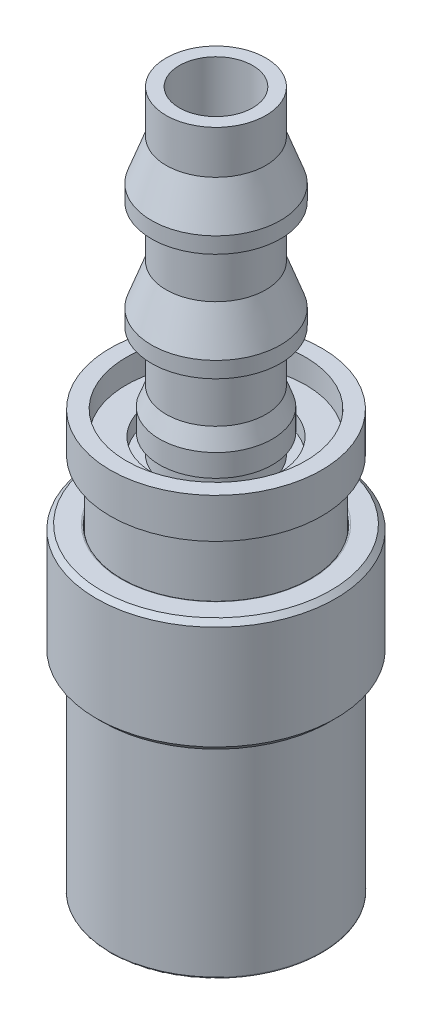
ISO-10303-21;
HEADER;
FILE_DESCRIPTION(('STEP AP214'),'2;1');
FILE_NAME('part.step','',(''),(''),'','','');
FILE_SCHEMA(('AUTOMOTIVE_DESIGN { 1 0 10303 214 1 1 1 1 }'));
ENDSEC;
DATA;
#1=APPLICATION_CONTEXT('core data for automotive mechanical design processes');
#2=APPLICATION_PROTOCOL_DEFINITION('international standard','automotive_design',2000,#1);
#3=PRODUCT_CONTEXT('',#1,'mechanical');
#4=PRODUCT('Part','Part','',(#3));
#5=PRODUCT_RELATED_PRODUCT_CATEGORY('part','',(#4));
#6=PRODUCT_DEFINITION_FORMATION('','',#4);
#7=PRODUCT_DEFINITION_CONTEXT('part definition',#1,'design');
#8=PRODUCT_DEFINITION('design','',#6,#7);
#9=PRODUCT_DEFINITION_SHAPE('','',#8);
#10=(LENGTH_UNIT() NAMED_UNIT(*) SI_UNIT(.MILLI.,.METRE.));
#11=(NAMED_UNIT(*) PLANE_ANGLE_UNIT() SI_UNIT($,.RADIAN.));
#12=(NAMED_UNIT(*) SI_UNIT($,.STERADIAN.) SOLID_ANGLE_UNIT());
#13=UNCERTAINTY_MEASURE_WITH_UNIT(LENGTH_MEASURE(1.E-05),#10,'distance_accuracy_value','');
#14=(GEOMETRIC_REPRESENTATION_CONTEXT(3) GLOBAL_UNCERTAINTY_ASSIGNED_CONTEXT((#13)) GLOBAL_UNIT_ASSIGNED_CONTEXT((#10,
#11,#12)) REPRESENTATION_CONTEXT('',''));
#15=CARTESIAN_POINT('',(0.,0.,0.));
#16=DIRECTION('',(0.,0.,1.));
#17=DIRECTION('',(1.,0.,0.));
#18=AXIS2_PLACEMENT_3D('',#15,#16,#17);
#19=CARTESIAN_POINT('',(0.,8.74426485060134,0.));
#20=DIRECTION('',(0.,1.,0.));
#21=DIRECTION('',(0.,0.,1.));
#22=AXIS2_PLACEMENT_3D('',#19,#20,#21);
#23=CYLINDRICAL_SURFACE('',#22,5.0546);
#24=CARTESIAN_POINT('',(0.,9.20812970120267,0.));
#25=DIRECTION('',(0.,1.,0.));
#26=DIRECTION('',(1.,0.,0.));
#27=AXIS2_PLACEMENT_3D('',#24,#25,#26);
#28=CIRCLE('',#27,5.0546);
#29=CARTESIAN_POINT('',(0.419359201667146,9.20812970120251,5.03717371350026));
#30=VERTEX_POINT('',#29);
#31=CARTESIAN_POINT('',(4.15264079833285,9.20812970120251,2.88176257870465));
#32=VERTEX_POINT('',#31);
#33=EDGE_CURVE('P0_E452',#30,#32,#28,.T.);
#34=ORIENTED_EDGE('',*,*,#33,.T.);
#35=DIRECTION('',(0.,1.,0.));
#36=VECTOR('',#35,1.);
#37=CARTESIAN_POINT('',(4.15264079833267,8.74426485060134,2.88176257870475));
#38=LINE('',#37,#36);
#39=CARTESIAN_POINT('',(4.15264079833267,8.2804,2.88176257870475));
#40=VERTEX_POINT('',#39);
#41=EDGE_CURVE('P0_E388',#32,#40,#38,.F.);
#42=ORIENTED_EDGE('',*,*,#41,.T.);
#43=CARTESIAN_POINT('',(0.,8.2804,0.));
#44=DIRECTION('',(0.,1.,0.));
#45=DIRECTION('',(1.,0.,0.));
#46=AXIS2_PLACEMENT_3D('',#43,#44,#45);
#47=CIRCLE('',#46,5.0546);
#48=CARTESIAN_POINT('',(0.419359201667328,8.2804,5.03717371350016));
#49=VERTEX_POINT('',#48);
#50=EDGE_CURVE('P0_E451',#49,#40,#47,.T.);
#51=ORIENTED_EDGE('',*,*,#50,.F.);
#52=DIRECTION('',(0.,1.,0.));
#53=VECTOR('',#52,1.);
#54=CARTESIAN_POINT('',(0.419359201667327,8.74426485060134,5.03717371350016));
#55=LINE('',#54,#53);
#56=EDGE_CURVE('P0_E442',#49,#30,#55,.T.);
#57=ORIENTED_EDGE('',*,*,#56,.T.);
#58=EDGE_LOOP('',(#34,#42,#51,#57));
#59=FACE_BOUND('',#58,.T.);
#60=ADVANCED_FACE('P0_F43',(#59),#23,.F.);
#61=CARTESIAN_POINT('',(4.572,9.2081297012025,2.1554111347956));
#62=VERTEX_POINT('',#61);
#63=CARTESIAN_POINT('',(4.572,9.20812970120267,-2.1554111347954));
#64=VERTEX_POINT('',#63);
#65=EDGE_CURVE('P0_E556',#62,#64,#28,.T.);
#66=ORIENTED_EDGE('',*,*,#65,.T.);
#67=DIRECTION('',(0.,1.,0.));
#68=VECTOR('',#67,1.);
#69=CARTESIAN_POINT('',(4.572,8.74426485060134,-2.1554111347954));
#70=LINE('',#69,#68);
#71=CARTESIAN_POINT('',(4.572,8.2804,-2.1554111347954));
#72=VERTEX_POINT('',#71);
#73=EDGE_CURVE('P0_E443',#64,#72,#70,.F.);
#74=ORIENTED_EDGE('',*,*,#73,.T.);
#75=CARTESIAN_POINT('',(4.572,8.2804,2.15541113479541));
#76=VERTEX_POINT('',#75);
#77=EDGE_CURVE('P0_E457',#76,#72,#47,.T.);
#78=ORIENTED_EDGE('',*,*,#77,.F.);
#79=DIRECTION('',(0.,1.,0.));
#80=VECTOR('',#79,1.);
#81=CARTESIAN_POINT('',(4.572,8.74426485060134,2.15541113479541));
#82=LINE('',#81,#80);
#83=EDGE_CURVE('P0_E751',#76,#62,#82,.T.);
#84=ORIENTED_EDGE('',*,*,#83,.T.);
#85=EDGE_LOOP('',(#66,#74,#78,#84));
#86=FACE_BOUND('',#85,.T.);
#87=ADVANCED_FACE('P0_F668',(#86),#23,.F.);
#88=CARTESIAN_POINT('',(0.,9.20812970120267,0.));
#89=DIRECTION('',(0.,1.,0.));
#90=DIRECTION('',(1.,0.,0.));
#91=AXIS2_PLACEMENT_3D('',#88,#89,#90);
#92=CIRCLE('',#91,5.0546);
#93=CARTESIAN_POINT('',(-0.419359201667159,9.20812970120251,-5.03717371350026));
#94=VERTEX_POINT('',#93);
#95=CARTESIAN_POINT('',(-4.15264079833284,9.20812970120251,-2.88176257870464));
#96=VERTEX_POINT('',#95);
#97=EDGE_CURVE('P0_E466',#94,#96,#92,.T.);
#98=ORIENTED_EDGE('',*,*,#97,.T.);
#99=DIRECTION('',(0.,1.,0.));
#100=VECTOR('',#99,1.);
#101=CARTESIAN_POINT('',(-4.15264079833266,8.74426485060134,-2.88176257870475));
#102=LINE('',#101,#100);
#103=CARTESIAN_POINT('',(-4.15264079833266,8.2804,-2.88176257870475));
#104=VERTEX_POINT('',#103);
#105=EDGE_CURVE('P0_E712',#96,#104,#102,.F.);
#106=ORIENTED_EDGE('',*,*,#105,.T.);
#107=CARTESIAN_POINT('',(0.,8.2804,0.));
#108=DIRECTION('',(0.,1.,0.));
#109=DIRECTION('',(1.,0.,0.));
#110=AXIS2_PLACEMENT_3D('',#107,#108,#109);
#111=CIRCLE('',#110,5.0546);
#112=CARTESIAN_POINT('',(-0.41935920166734,8.2804,-5.03717371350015));
#113=VERTEX_POINT('',#112);
#114=EDGE_CURVE('P0_E472',#113,#104,#111,.T.);
#115=ORIENTED_EDGE('',*,*,#114,.F.);
#116=DIRECTION('',(0.,1.,0.));
#117=VECTOR('',#116,1.);
#118=CARTESIAN_POINT('',(-0.41935920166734,8.74426485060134,-5.03717371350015));
#119=LINE('',#118,#117);
#120=EDGE_CURVE('P0_E713',#113,#94,#119,.T.);
#121=ORIENTED_EDGE('',*,*,#120,.T.);
#122=EDGE_LOOP('',(#98,#106,#115,#121));
#123=FACE_BOUND('',#122,.T.);
#124=ADVANCED_FACE('P0_F674',(#123),#23,.F.);
#125=CARTESIAN_POINT('',(4.15264079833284,9.20812970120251,-2.88176257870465));
#126=VERTEX_POINT('',#125);
#127=CARTESIAN_POINT('',(0.419359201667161,9.20812970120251,-5.03717371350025));
#128=VERTEX_POINT('',#127);
#129=EDGE_CURVE('P0_E552',#126,#128,#28,.T.);
#130=ORIENTED_EDGE('',*,*,#129,.T.);
#131=DIRECTION('',(0.,1.,0.));
#132=VECTOR('',#131,1.);
#133=CARTESIAN_POINT('',(0.419359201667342,8.74426485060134,-5.03717371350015));
#134=LINE('',#133,#132);
#135=CARTESIAN_POINT('',(0.419359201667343,8.2804,-5.03717371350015));
#136=VERTEX_POINT('',#135);
#137=EDGE_CURVE('P0_E761',#128,#136,#134,.F.);
#138=ORIENTED_EDGE('',*,*,#137,.T.);
#139=CARTESIAN_POINT('',(4.15264079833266,8.2804,-2.88176257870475));
#140=VERTEX_POINT('',#139);
#141=EDGE_CURVE('P0_E459',#140,#136,#47,.T.);
#142=ORIENTED_EDGE('',*,*,#141,.F.);
#143=DIRECTION('',(0.,1.,0.));
#144=VECTOR('',#143,1.);
#145=CARTESIAN_POINT('',(4.15264079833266,8.74426485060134,-2.88176257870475));
#146=LINE('',#145,#144);
#147=EDGE_CURVE('P0_E763',#140,#126,#146,.T.);
#148=ORIENTED_EDGE('',*,*,#147,.T.);
#149=EDGE_LOOP('',(#130,#138,#142,#148));
#150=FACE_BOUND('',#149,.T.);
#151=ADVANCED_FACE('P0_F690',(#150),#23,.F.);
#152=CARTESIAN_POINT('',(-4.57199999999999,9.2081297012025,-2.1554111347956));
#153=VERTEX_POINT('',#152);
#154=CARTESIAN_POINT('',(-4.572,9.20812970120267,2.15541113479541));
#155=VERTEX_POINT('',#154);
#156=EDGE_CURVE('P0_E464',#153,#155,#92,.T.);
#157=ORIENTED_EDGE('',*,*,#156,.T.);
#158=DIRECTION('',(0.,1.,0.));
#159=VECTOR('',#158,1.);
#160=CARTESIAN_POINT('',(-4.572,8.74426485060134,2.15541113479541));
#161=LINE('',#160,#159);
#162=CARTESIAN_POINT('',(-4.572,8.2804,2.15541113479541));
#163=VERTEX_POINT('',#162);
#164=EDGE_CURVE('P0_E292',#155,#163,#161,.F.);
#165=ORIENTED_EDGE('',*,*,#164,.T.);
#166=CARTESIAN_POINT('',(-4.57199999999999,8.2804,-2.15541113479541));
#167=VERTEX_POINT('',#166);
#168=EDGE_CURVE('P0_E480',#167,#163,#111,.T.);
#169=ORIENTED_EDGE('',*,*,#168,.F.);
#170=DIRECTION('',(0.,1.,0.));
#171=VECTOR('',#170,1.);
#172=CARTESIAN_POINT('',(-4.572,8.74426485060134,-2.15541113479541));
#173=LINE('',#172,#171);
#174=EDGE_CURVE('P0_E701',#167,#153,#173,.T.);
#175=ORIENTED_EDGE('',*,*,#174,.T.);
#176=EDGE_LOOP('',(#157,#165,#169,#175));
#177=FACE_BOUND('',#176,.T.);
#178=ADVANCED_FACE('P0_F680',(#177),#23,.F.);
#179=CARTESIAN_POINT('',(0.,8.19974416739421,0.));
#180=DIRECTION('',(0.,1.,0.));
#181=DIRECTION('',(0.,0.,1.));
#182=AXIS2_PLACEMENT_3D('',#179,#180,#181);
#183=CONICAL_SURFACE('',#182,4.9149,1.04719755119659);
#184=ORIENTED_EDGE('',*,*,#50,.T.);
#185=CARTESIAN_POINT('',(4.1533442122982,8.2806,2.8813564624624));
#186=CARTESIAN_POINT('',(4.05610183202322,8.25294894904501,2.9374993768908));
#187=CARTESIAN_POINT('',(3.95850570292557,8.22696165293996,2.99384652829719));
#188=CARTESIAN_POINT('',(3.76259868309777,8.17869768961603,3.10695349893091));
#189=CARTESIAN_POINT('',(3.66428758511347,8.15642214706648,3.16371343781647));
#190=CARTESIAN_POINT('',(3.36815697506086,8.09572042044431,3.33468452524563));
#191=CARTESIAN_POINT('',(3.16933997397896,8.06347754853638,3.44947157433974));
#192=CARTESIAN_POINT('',(2.77407837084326,8.01864677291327,3.67767596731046));
#193=CARTESIAN_POINT('',(2.57766683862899,8.00567542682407,3.79107421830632));
#194=CARTESIAN_POINT('',(2.18474039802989,7.99939195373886,4.01793040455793));
#195=CARTESIAN_POINT('',(1.98822570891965,8.00606360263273,4.13138821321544));
#196=CARTESIAN_POINT('',(1.67720970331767,8.03169655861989,4.31095338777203));
#197=CARTESIAN_POINT('',(1.56229073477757,8.04445879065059,4.37730188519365));
#198=CARTESIAN_POINT('',(1.33306644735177,8.07611502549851,4.50964458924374));
#199=CARTESIAN_POINT('',(1.21876122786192,8.09500999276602,4.57563873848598));
#200=CARTESIAN_POINT('',(0.98957308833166,8.13868570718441,4.70796057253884));
#201=CARTESIAN_POINT('',(0.874700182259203,8.16353556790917,4.77428247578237));
#202=CARTESIAN_POINT('',(0.645935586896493,8.21836971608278,4.90635977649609));
#203=CARTESIAN_POINT('',(0.532043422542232,8.24835135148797,4.97211544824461));
#204=CARTESIAN_POINT('',(0.418655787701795,8.2806,5.03757982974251));
#205=B_SPLINE_CURVE_WITH_KNOTS('',3,(#185,#186,#187,#188,#189,#190,#191,#192,#193,#194,#195,
#196,#197,#198,#199,#200,#201,#202,#203,#204),.UNSPECIFIED.,.F.,.F.,(4,2,2,2,2,2,2,2,2,4),(0.,
0.346899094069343,0.693903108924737,1.38862367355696,2.06932722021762,2.7494686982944,
3.14926710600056,3.54912841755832,3.95387683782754,4.35841671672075),.UNSPECIFIED.);
#206=EDGE_CURVE('P0_E11',#40,#49,#205,.T.);
#207=ORIENTED_EDGE('',*,*,#206,.T.);
#208=EDGE_LOOP('',(#184,#207));
#209=FACE_BOUND('',#208,.T.);
#210=ADVANCED_FACE('P0_F455',(#209),#183,.F.);
#211=ORIENTED_EDGE('',*,*,#77,.T.);
#212=CARTESIAN_POINT('',(4.572,10.6968013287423,-8.02951555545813));
#213=CARTESIAN_POINT('',(4.572,10.6006881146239,-7.83791802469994));
#214=CARTESIAN_POINT('',(4.572,10.5052237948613,-7.64599158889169));
#215=CARTESIAN_POINT('',(4.572,10.3159072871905,-7.26133033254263));
#216=CARTESIAN_POINT('',(4.572,10.2220552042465,-7.06859546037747));
#217=CARTESIAN_POINT('',(4.572,10.0361065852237,-6.6818099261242));
#218=CARTESIAN_POINT('',(4.572,9.94401388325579,-6.48775741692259));
#219=CARTESIAN_POINT('',(4.572,9.76221231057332,-6.09854138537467));
#220=CARTESIAN_POINT('',(4.572,9.67250339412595,-5.90337788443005));
#221=CARTESIAN_POINT('',(4.572,9.49198044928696,-5.50275665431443));
#222=CARTESIAN_POINT('',(4.572,9.40130392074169,-5.2972367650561));
#223=CARTESIAN_POINT('',(4.572,9.22399540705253,-4.88446123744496));
#224=CARTESIAN_POINT('',(4.572,9.1373632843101,-4.67720565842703));
#225=CARTESIAN_POINT('',(4.572,8.96928524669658,-4.26072805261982));
#226=CARTESIAN_POINT('',(4.572,8.88783638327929,-4.05150722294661));
#227=CARTESIAN_POINT('',(4.572,8.73153179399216,-3.63062794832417));
#228=CARTESIAN_POINT('',(4.572,8.65667535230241,-3.41896977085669));
#229=CARTESIAN_POINT('',(4.572,8.49934649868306,-2.94435600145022));
#230=CARTESIAN_POINT('',(4.572,8.41901326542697,-2.68068066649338));
#231=CARTESIAN_POINT('',(4.572,8.2755600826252,-2.14855561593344));
#232=CARTESIAN_POINT('',(4.572,8.21243888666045,-1.88010624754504));
#233=CARTESIAN_POINT('',(4.572,8.13506216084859,-1.47651681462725));
#234=CARTESIAN_POINT('',(4.572,8.11227931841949,-1.34299786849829));
#235=CARTESIAN_POINT('',(4.572,8.07273533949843,-1.07507871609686));
#236=CARTESIAN_POINT('',(4.572,8.05597332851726,-0.940678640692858));
#237=CARTESIAN_POINT('',(4.572,8.02897025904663,-0.67126119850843));
#238=CARTESIAN_POINT('',(4.572,8.01872721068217,-0.53624403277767));
#239=CARTESIAN_POINT('',(4.572,8.00508660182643,-0.265861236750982));
#240=CARTESIAN_POINT('',(4.572,8.00168900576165,-0.130495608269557));
#241=CARTESIAN_POINT('',(4.572,8.0018560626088,0.141135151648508));
#242=CARTESIAN_POINT('',(4.572,8.00546733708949,0.277400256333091));
#243=CARTESIAN_POINT('',(4.572,8.01962004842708,0.549566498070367));
#244=CARTESIAN_POINT('',(4.572,8.03016151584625,0.685467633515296));
#245=CARTESIAN_POINT('',(4.572,8.0578336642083,0.956643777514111));
#246=CARTESIAN_POINT('',(4.572,8.07496683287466,1.09191853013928));
#247=CARTESIAN_POINT('',(4.572,8.1153076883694,1.36155137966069));
#248=CARTESIAN_POINT('',(4.572,8.13851558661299,1.49590944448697));
#249=CARTESIAN_POINT('',(4.572,8.21723562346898,1.90197771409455));
#250=CARTESIAN_POINT('',(4.572,8.28133483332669,2.17203657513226));
#251=CARTESIAN_POINT('',(4.572,8.42684522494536,2.70746108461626));
#252=CARTESIAN_POINT('',(4.572,8.50826650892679,2.97282389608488));
#253=CARTESIAN_POINT('',(4.572,8.6666754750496,3.44771560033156));
#254=CARTESIAN_POINT('',(4.572,8.74141171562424,3.65800682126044));
#255=CARTESIAN_POINT('',(4.572,8.89730184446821,4.07611598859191));
#256=CARTESIAN_POINT('',(4.572,8.97845393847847,4.28393460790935));
#257=CARTESIAN_POINT('',(4.572,9.14584426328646,4.69767854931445));
#258=CARTESIAN_POINT('',(4.572,9.23208618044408,4.90360237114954));
#259=CARTESIAN_POINT('',(4.572,9.4085381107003,5.31374456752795));
#260=CARTESIAN_POINT('',(4.572,9.49874825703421,5.51796288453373));
#261=CARTESIAN_POINT('',(4.572,9.67832146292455,5.91609789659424));
#262=CARTESIAN_POINT('',(4.572,9.76754993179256,6.11007549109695));
#263=CARTESIAN_POINT('',(4.572,9.94835076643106,6.49692951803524));
#264=CARTESIAN_POINT('',(4.572,10.0399230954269,6.68980596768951));
#265=CARTESIAN_POINT('',(4.572,10.2248117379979,7.0742696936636));
#266=CARTESIAN_POINT('',(4.572,10.3181244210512,7.26585871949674));
#267=CARTESIAN_POINT('',(4.572,10.506344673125,7.64824538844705));
#268=CARTESIAN_POINT('',(4.572,10.6012521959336,7.8390430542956));
#269=CARTESIAN_POINT('',(4.572,10.6968013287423,8.02951555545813));
#270=B_SPLINE_CURVE_WITH_KNOTS('',3,(#212,#213,#214,#215,#216,#217,#218,#219,#220,#221,#222,
#223,#224,#225,#226,#227,#228,#229,#230,#231,#232,#233,#234,#235,#236,#237,#238,#239,#240,#241,
#242,#243,#244,#245,#246,#247,#248,#249,#250,#251,#252,#253,#254,#255,#256,#257,#258,#259,#260,
#261,#262,#263,#264,#265,#266,#267,#268,#269),.UNSPECIFIED.,.F.,.F.,(4,2,2,2,2,2,2,2,2,2,2,2,2,
2,2,2,2,2,2,2,2,2,2,2,2,2,2,2,4),(0.,0.643063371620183,1.28616845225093,1.9305439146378,
2.57490700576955,3.24877621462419,3.92262248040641,4.59608193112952,5.2694681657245,
6.0959866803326,6.92244532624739,7.32867730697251,7.73485026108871,8.14089917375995,
8.54694597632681,8.95570297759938,9.3644617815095,9.77337500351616,10.1823024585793,
11.0141299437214,11.8464438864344,12.5158501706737,13.1850699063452,13.8547804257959,
14.5245134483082,15.1650425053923,15.8055615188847,16.4448677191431,17.0841554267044),.UNSPECIFIED.);
#271=EDGE_CURVE('P0_E57',#72,#76,#270,.T.);
#272=ORIENTED_EDGE('',*,*,#271,.T.);
#273=EDGE_LOOP('',(#211,#272));
#274=FACE_BOUND('',#273,.T.);
#275=ADVANCED_FACE('P0_F697',(#274),#183,.F.);
#276=ORIENTED_EDGE('',*,*,#141,.T.);
#277=CARTESIAN_POINT('',(0.418655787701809,8.2806,-5.0375798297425));
#278=CARTESIAN_POINT('',(0.515898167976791,8.25294894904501,-4.9814369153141));
#279=CARTESIAN_POINT('',(0.613494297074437,8.22696165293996,-4.92508976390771));
#280=CARTESIAN_POINT('',(0.809401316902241,8.17869768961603,-4.81198279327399));
#281=CARTESIAN_POINT('',(0.907712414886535,8.15642214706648,-4.75522285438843));
#282=CARTESIAN_POINT('',(1.20384302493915,8.09572042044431,-4.58425176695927));
#283=CARTESIAN_POINT('',(1.40266002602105,8.06347754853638,-4.46946471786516));
#284=CARTESIAN_POINT('',(1.79792162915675,8.01864677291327,-4.24126032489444));
#285=CARTESIAN_POINT('',(1.99433316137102,8.00567542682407,-4.12786207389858));
#286=CARTESIAN_POINT('',(2.38725960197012,7.99939195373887,-3.90100588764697));
#287=CARTESIAN_POINT('',(2.58377429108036,8.00606360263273,-3.78754807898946));
#288=CARTESIAN_POINT('',(2.89479029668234,8.0316965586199,-3.60798290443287));
#289=CARTESIAN_POINT('',(3.00970926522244,8.04445879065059,-3.54163440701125));
#290=CARTESIAN_POINT('',(3.23893355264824,8.07611502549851,-3.40929170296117));
#291=CARTESIAN_POINT('',(3.35323877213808,8.09500999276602,-3.34329755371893));
#292=CARTESIAN_POINT('',(3.58242691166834,8.13868570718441,-3.21097571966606));
#293=CARTESIAN_POINT('',(3.69729981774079,8.16353556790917,-3.14465381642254));
#294=CARTESIAN_POINT('',(3.9260644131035,8.21836971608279,-3.01257651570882));
#295=CARTESIAN_POINT('',(4.03995657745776,8.24835135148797,-2.9468208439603));
#296=CARTESIAN_POINT('',(4.15334421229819,8.2806,-2.8813564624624));
#297=B_SPLINE_CURVE_WITH_KNOTS('',3,(#277,#278,#279,#280,#281,#282,#283,#284,#285,#286,#287,
#288,#289,#290,#291,#292,#293,#294,#295,#296),.UNSPECIFIED.,.F.,.F.,(4,2,2,2,2,2,2,2,2,4),(0.,
0.346899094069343,0.693903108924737,1.38862367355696,2.06932722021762,2.7494686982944,
3.14926710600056,3.54912841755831,3.95387683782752,4.35841671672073),.UNSPECIFIED.);
#298=EDGE_CURVE('P0_E764',#136,#140,#297,.T.);
#299=ORIENTED_EDGE('',*,*,#298,.T.);
#300=EDGE_LOOP('',(#276,#299));
#301=FACE_BOUND('',#300,.T.);
#302=ADVANCED_FACE('P0_F765',(#301),#183,.F.);
#303=ORIENTED_EDGE('',*,*,#114,.T.);
#304=CARTESIAN_POINT('',(-4.15334421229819,8.2806,-2.8813564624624));
#305=CARTESIAN_POINT('',(-4.05610183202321,8.25294894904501,-2.9374993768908));
#306=CARTESIAN_POINT('',(-3.95850570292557,8.22696165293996,-2.99384652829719));
#307=CARTESIAN_POINT('',(-3.76259868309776,8.17869768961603,-3.10695349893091));
#308=CARTESIAN_POINT('',(-3.66428758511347,8.15642214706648,-3.16371343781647));
#309=CARTESIAN_POINT('',(-3.36815697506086,8.09572042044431,-3.33468452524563));
#310=CARTESIAN_POINT('',(-3.16933997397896,8.06347754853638,-3.44947157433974));
#311=CARTESIAN_POINT('',(-2.77407837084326,8.01864677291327,-3.67767596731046));
#312=CARTESIAN_POINT('',(-2.57766683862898,8.00567542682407,-3.79107421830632));
#313=CARTESIAN_POINT('',(-2.18474039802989,7.99939195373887,-4.01793040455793));
#314=CARTESIAN_POINT('',(-1.98822570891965,8.00606360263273,-4.13138821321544));
#315=CARTESIAN_POINT('',(-1.67720970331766,8.0316965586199,-4.31095338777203));
#316=CARTESIAN_POINT('',(-1.56229073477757,8.04445879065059,-4.37730188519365));
#317=CARTESIAN_POINT('',(-1.33306644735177,8.07611502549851,-4.50964458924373));
#318=CARTESIAN_POINT('',(-1.21876122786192,8.09500999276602,-4.57563873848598));
#319=CARTESIAN_POINT('',(-0.989573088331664,8.13868570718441,-4.70796057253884));
#320=CARTESIAN_POINT('',(-0.874700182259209,8.16353556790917,-4.77428247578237));
#321=CARTESIAN_POINT('',(-0.645935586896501,8.21836971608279,-4.90635977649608));
#322=CARTESIAN_POINT('',(-0.532043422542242,8.24835135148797,-4.9721154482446));
#323=CARTESIAN_POINT('',(-0.418655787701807,8.2806,-5.0375798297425));
#324=B_SPLINE_CURVE_WITH_KNOTS('',3,(#304,#305,#306,#307,#308,#309,#310,#311,#312,#313,#314,
#315,#316,#317,#318,#319,#320,#321,#322,#323),.UNSPECIFIED.,.F.,.F.,(4,2,2,2,2,2,2,2,2,4),(0.,
0.346899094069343,0.693903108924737,1.38862367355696,2.06932722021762,2.7494686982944,
3.14926710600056,3.54912841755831,3.95387683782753,4.35841671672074),.UNSPECIFIED.);
#325=EDGE_CURVE('P0_E766',#104,#113,#324,.T.);
#326=ORIENTED_EDGE('',*,*,#325,.T.);
#327=EDGE_LOOP('',(#303,#326));
#328=FACE_BOUND('',#327,.T.);
#329=ADVANCED_FACE('P0_F937',(#328),#183,.F.);
#330=ORIENTED_EDGE('',*,*,#168,.T.);
#331=CARTESIAN_POINT('',(-4.572,10.6968013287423,8.02951555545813));
#332=CARTESIAN_POINT('',(-4.572,10.6006881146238,7.83791802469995));
#333=CARTESIAN_POINT('',(-4.572,10.5052237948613,7.6459915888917));
#334=CARTESIAN_POINT('',(-4.572,10.3159072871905,7.26133033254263));
#335=CARTESIAN_POINT('',(-4.572,10.2220552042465,7.06859546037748));
#336=CARTESIAN_POINT('',(-4.572,10.0361065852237,6.6818099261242));
#337=CARTESIAN_POINT('',(-4.572,9.94401388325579,6.48775741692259));
#338=CARTESIAN_POINT('',(-4.572,9.76221231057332,6.09854138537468));
#339=CARTESIAN_POINT('',(-4.572,9.67250339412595,5.90337788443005));
#340=CARTESIAN_POINT('',(-4.572,9.49198044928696,5.50275665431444));
#341=CARTESIAN_POINT('',(-4.572,9.40130392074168,5.2972367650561));
#342=CARTESIAN_POINT('',(-4.572,9.22399540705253,4.88446123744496));
#343=CARTESIAN_POINT('',(-4.572,9.1373632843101,4.67720565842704));
#344=CARTESIAN_POINT('',(-4.572,8.96928524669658,4.26072805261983));
#345=CARTESIAN_POINT('',(-4.572,8.88783638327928,4.05150722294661));
#346=CARTESIAN_POINT('',(-4.572,8.73153179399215,3.63062794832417));
#347=CARTESIAN_POINT('',(-4.572,8.65667535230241,3.41896977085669));
#348=CARTESIAN_POINT('',(-4.572,8.49934649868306,2.94435600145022));
#349=CARTESIAN_POINT('',(-4.572,8.41901326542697,2.68068066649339));
#350=CARTESIAN_POINT('',(-4.572,8.2755600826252,2.14855561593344));
#351=CARTESIAN_POINT('',(-4.572,8.21243888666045,1.88010624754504));
#352=CARTESIAN_POINT('',(-4.572,8.13506216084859,1.47651681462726));
#353=CARTESIAN_POINT('',(-4.572,8.11227931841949,1.34299786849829));
#354=CARTESIAN_POINT('',(-4.572,8.07273533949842,1.07507871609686));
#355=CARTESIAN_POINT('',(-4.572,8.05597332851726,0.940678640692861));
#356=CARTESIAN_POINT('',(-4.572,8.02897025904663,0.671261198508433));
#357=CARTESIAN_POINT('',(-4.572,8.01872721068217,0.536244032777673));
#358=CARTESIAN_POINT('',(-4.572,8.00508660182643,0.265861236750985));
#359=CARTESIAN_POINT('',(-4.57199999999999,8.00168900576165,0.130495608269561));
#360=CARTESIAN_POINT('',(-4.57199999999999,8.0018560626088,-0.141135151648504));
#361=CARTESIAN_POINT('',(-4.57199999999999,8.00546733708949,-0.277400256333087));
#362=CARTESIAN_POINT('',(-4.57199999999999,8.01962004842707,-0.549566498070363));
#363=CARTESIAN_POINT('',(-4.57199999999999,8.03016151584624,-0.685467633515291));
#364=CARTESIAN_POINT('',(-4.57199999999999,8.0578336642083,-0.956643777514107));
#365=CARTESIAN_POINT('',(-4.57199999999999,8.07496683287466,-1.09191853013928));
#366=CARTESIAN_POINT('',(-4.57199999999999,8.1153076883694,-1.36155137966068));
#367=CARTESIAN_POINT('',(-4.57199999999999,8.13851558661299,-1.49590944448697));
#368=CARTESIAN_POINT('',(-4.57199999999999,8.21723562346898,-1.90197771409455));
#369=CARTESIAN_POINT('',(-4.57199999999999,8.28133483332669,-2.17203657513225));
#370=CARTESIAN_POINT('',(-4.57199999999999,8.42684522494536,-2.70746108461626));
#371=CARTESIAN_POINT('',(-4.57199999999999,8.50826650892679,-2.97282389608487));
#372=CARTESIAN_POINT('',(-4.57199999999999,8.6666754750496,-3.44771560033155));
#373=CARTESIAN_POINT('',(-4.57199999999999,8.74141171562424,-3.65800682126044));
#374=CARTESIAN_POINT('',(-4.57199999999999,8.89730184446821,-4.07611598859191));
#375=CARTESIAN_POINT('',(-4.57199999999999,8.97845393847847,-4.28393460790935));
#376=CARTESIAN_POINT('',(-4.57199999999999,9.14584426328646,-4.69767854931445));
#377=CARTESIAN_POINT('',(-4.57199999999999,9.23208618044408,-4.90360237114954));
#378=CARTESIAN_POINT('',(-4.57199999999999,9.4085381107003,-5.31374456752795));
#379=CARTESIAN_POINT('',(-4.57199999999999,9.49874825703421,-5.51796288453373));
#380=CARTESIAN_POINT('',(-4.57199999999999,9.67832146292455,-5.91609789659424));
#381=CARTESIAN_POINT('',(-4.57199999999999,9.76754993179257,-6.11007549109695));
#382=CARTESIAN_POINT('',(-4.57199999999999,9.94835076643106,-6.49692951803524));
#383=CARTESIAN_POINT('',(-4.57199999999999,10.039923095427,-6.68980596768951));
#384=CARTESIAN_POINT('',(-4.57199999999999,10.2248117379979,-7.0742696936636));
#385=CARTESIAN_POINT('',(-4.57199999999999,10.3181244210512,-7.26585871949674));
#386=CARTESIAN_POINT('',(-4.57199999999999,10.506344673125,-7.64824538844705));
#387=CARTESIAN_POINT('',(-4.57199999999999,10.6012521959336,-7.8390430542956));
#388=CARTESIAN_POINT('',(-4.57199999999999,10.6968013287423,-8.02951555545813));
#389=B_SPLINE_CURVE_WITH_KNOTS('',3,(#331,#332,#333,#334,#335,#336,#337,#338,#339,#340,#341,
#342,#343,#344,#345,#346,#347,#348,#349,#350,#351,#352,#353,#354,#355,#356,#357,#358,#359,#360,
#361,#362,#363,#364,#365,#366,#367,#368,#369,#370,#371,#372,#373,#374,#375,#376,#377,#378,#379,
#380,#381,#382,#383,#384,#385,#386,#387,#388),.UNSPECIFIED.,.F.,.F.,(4,2,2,2,2,2,2,2,2,2,2,2,2,
2,2,2,2,2,2,2,2,2,2,2,2,2,2,2,4),(0.,0.643063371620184,1.28616845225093,1.9305439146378,
2.57490700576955,3.24877621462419,3.92262248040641,4.59608193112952,5.2694681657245,
6.0959866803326,6.92244532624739,7.32867730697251,7.73485026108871,8.14089917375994,
8.54694597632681,8.95570297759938,9.3644617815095,9.77337500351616,10.1823024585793,
11.0141299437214,11.8464438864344,12.5158501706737,13.1850699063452,13.8547804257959,
14.5245134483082,15.1650425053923,15.8055615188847,16.4448677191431,17.0841554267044),.UNSPECIFIED.);
#390=EDGE_CURVE('P0_E769',#163,#167,#389,.T.);
#391=ORIENTED_EDGE('',*,*,#390,.T.);
#392=EDGE_LOOP('',(#330,#391));
#393=FACE_BOUND('',#392,.T.);
#394=ADVANCED_FACE('P0_F686',(#393),#183,.F.);
#395=CARTESIAN_POINT('',(0.,0.254,0.));
#396=DIRECTION('',(0.,1.,0.));
#397=DIRECTION('',(0.,0.,1.));
#398=AXIS2_PLACEMENT_3D('',#395,#396,#397);
#399=TOROIDAL_SURFACE('',#398,6.096,0.254);
#400=CARTESIAN_POINT('',(0.,0.254,0.));
#401=DIRECTION('',(0.,-1.,0.));
#402=DIRECTION('',(0.,0.,-1.));
#403=AXIS2_PLACEMENT_3D('',#400,#401,#402);
#404=CIRCLE('',#403,6.35);
#405=CARTESIAN_POINT('',(0.,0.254,6.35));
#406=VERTEX_POINT('',#405);
#407=CARTESIAN_POINT('',(0.,0.254,-6.35));
#408=VERTEX_POINT('',#407);
#409=EDGE_CURVE('P0_E566',#406,#408,#404,.T.);
#410=ORIENTED_EDGE('',*,*,#409,.T.);
#411=CARTESIAN_POINT('',(0.,0.254,-6.096));
#412=DIRECTION('',(-1.,0.,0.));
#413=DIRECTION('',(0.,0.,-1.));
#414=AXIS2_PLACEMENT_3D('',#411,#412,#413);
#415=CIRCLE('',#414,0.254);
#416=CARTESIAN_POINT('',(0.,0.,-6.096));
#417=VERTEX_POINT('',#416);
#418=EDGE_CURVE('P0_E571',#408,#417,#415,.T.);
#419=ORIENTED_EDGE('',*,*,#418,.T.);
#420=CARTESIAN_POINT('',(0.,0.,0.));
#421=DIRECTION('',(0.,1.,0.));
#422=DIRECTION('',(0.,0.,-1.));
#423=AXIS2_PLACEMENT_3D('',#420,#421,#422);
#424=CIRCLE('',#423,6.096);
#425=CARTESIAN_POINT('',(0.,0.,6.096));
#426=VERTEX_POINT('',#425);
#427=EDGE_CURVE('P0_E605',#417,#426,#424,.T.);
#428=ORIENTED_EDGE('',*,*,#427,.T.);
#429=CARTESIAN_POINT('',(0.,0.,0.));
#430=DIRECTION('',(0.,1.,0.));
#431=DIRECTION('',(0.,0.,-1.));
#432=AXIS2_PLACEMENT_3D('',#429,#430,#431);
#433=CIRCLE('',#432,6.096);
#434=EDGE_CURVE('P0_E537',#426,#417,#433,.T.);
#435=ORIENTED_EDGE('',*,*,#434,.T.);
#436=ORIENTED_EDGE('',*,*,#418,.F.);
#437=CARTESIAN_POINT('',(0.,0.254,0.));
#438=DIRECTION('',(0.,-1.,0.));
#439=DIRECTION('',(0.,0.,-1.));
#440=AXIS2_PLACEMENT_3D('',#437,#438,#439);
#441=CIRCLE('',#440,6.35);
#442=EDGE_CURVE('P0_E534',#408,#406,#441,.T.);
#443=ORIENTED_EDGE('',*,*,#442,.T.);
#444=EDGE_LOOP('',(#410,#419,#428,#435,#436,#443));
#445=FACE_BOUND('',#444,.T.);
#446=ADVANCED_FACE('P0_F921',(#445),#399,.T.);
#447=CARTESIAN_POINT('',(0.,0.,6.35));
#448=DIRECTION('',(0.,-1.,0.));
#449=DIRECTION('',(0.,0.,-1.));
#450=AXIS2_PLACEMENT_3D('',#447,#448,#449);
#451=PLANE('',#450);
#452=ORIENTED_EDGE('',*,*,#434,.F.);
#453=ORIENTED_EDGE('',*,*,#427,.F.);
#454=EDGE_LOOP('',(#452,#453));
#455=FACE_BOUND('',#454,.T.);
#456=CARTESIAN_POINT('',(0.,0.,0.));
#457=DIRECTION('',(0.,-1.,0.));
#458=DIRECTION('',(0.,0.,-1.));
#459=AXIS2_PLACEMENT_3D('',#456,#457,#458);
#460=CIRCLE('',#459,5.5626);
#461=CARTESIAN_POINT('',(0.,0.,5.5626));
#462=VERTEX_POINT('',#461);
#463=EDGE_CURVE('P0_E533',#462,#462,#460,.T.);
#464=ORIENTED_EDGE('',*,*,#463,.F.);
#465=EDGE_LOOP('',(#464));
#466=FACE_BOUND('',#465,.T.);
#467=ADVANCED_FACE('P0_F924',(#455,#466),#451,.T.);
#468=CARTESIAN_POINT('',(0.,7.62,0.));
#469=DIRECTION('',(0.,1.,0.));
#470=DIRECTION('',(0.,0.,1.));
#471=AXIS2_PLACEMENT_3D('',#468,#469,#470);
#472=CYLINDRICAL_SURFACE('',#471,6.35);
#473=CARTESIAN_POINT('',(0.,15.24,0.));
#474=DIRECTION('',(0.,1.,0.));
#475=DIRECTION('',(1.,0.,0.));
#476=AXIS2_PLACEMENT_3D('',#473,#474,#475);
#477=CIRCLE('',#476,6.35);
#478=CARTESIAN_POINT('',(0.,15.24,6.35));
#479=VERTEX_POINT('',#478);
#480=CARTESIAN_POINT('',(0.,15.24,-6.35));
#481=VERTEX_POINT('',#480);
#482=EDGE_CURVE('P0_E532',#479,#481,#477,.T.);
#483=ORIENTED_EDGE('',*,*,#482,.F.);
#484=CARTESIAN_POINT('',(0.,15.24,0.));
#485=DIRECTION('',(0.,1.,0.));
#486=DIRECTION('',(1.,0.,0.));
#487=AXIS2_PLACEMENT_3D('',#484,#485,#486);
#488=CIRCLE('',#487,6.35);
#489=EDGE_CURVE('P0_E528',#481,#479,#488,.T.);
#490=ORIENTED_EDGE('',*,*,#489,.F.);
#491=DIRECTION('',(0.,-1.,0.));
#492=VECTOR('',#491,1.);
#493=CARTESIAN_POINT('',(0.,7.62,-6.35));
#494=LINE('',#493,#492);
#495=EDGE_CURVE('P0_E538',#481,#408,#494,.T.);
#496=ORIENTED_EDGE('',*,*,#495,.T.);
#497=ORIENTED_EDGE('',*,*,#409,.F.);
#498=ORIENTED_EDGE('',*,*,#442,.F.);
#499=ORIENTED_EDGE('',*,*,#495,.F.);
#500=EDGE_LOOP('',(#483,#490,#496,#497,#498,#499));
#501=FACE_BOUND('',#500,.T.);
#502=ADVANCED_FACE('P0_F663',(#501),#472,.T.);
#503=CARTESIAN_POINT('',(0.,29.8958,0.));
#504=DIRECTION('',(0.,1.,0.));
#505=DIRECTION('',(0.,0.,1.));
#506=AXIS2_PLACEMENT_3D('',#503,#504,#505);
#507=TOROIDAL_SURFACE('',#506,7.1501,0.254);
#508=CARTESIAN_POINT('',(0.,30.1498,0.));
#509=DIRECTION('',(0.,-1.,0.));
#510=DIRECTION('',(0.,0.,-1.));
#511=AXIS2_PLACEMENT_3D('',#508,#509,#510);
#512=CIRCLE('',#511,7.1501);
#513=CARTESIAN_POINT('',(0.,30.1498,7.1501));
#514=VERTEX_POINT('',#513);
#515=CARTESIAN_POINT('',(0.,30.1498,-7.1501));
#516=VERTEX_POINT('',#515);
#517=EDGE_CURVE('P0_E592',#514,#516,#512,.T.);
#518=ORIENTED_EDGE('',*,*,#517,.T.);
#519=CARTESIAN_POINT('',(0.,29.8958,-7.1501));
#520=DIRECTION('',(-1.,0.,0.));
#521=DIRECTION('',(0.,0.,-1.));
#522=AXIS2_PLACEMENT_3D('',#519,#520,#521);
#523=CIRCLE('',#522,0.254);
#524=CARTESIAN_POINT('',(0.,29.8958,-7.4041));
#525=VERTEX_POINT('',#524);
#526=EDGE_CURVE('P0_E593',#516,#525,#523,.T.);
#527=ORIENTED_EDGE('',*,*,#526,.T.);
#528=CARTESIAN_POINT('',(0.,29.8958,0.));
#529=DIRECTION('',(0.,1.,0.));
#530=DIRECTION('',(0.,0.,-1.));
#531=AXIS2_PLACEMENT_3D('',#528,#529,#530);
#532=CIRCLE('',#531,7.4041);
#533=CARTESIAN_POINT('',(0.,29.8958,7.4041));
#534=VERTEX_POINT('',#533);
#535=EDGE_CURVE('P0_E516',#525,#534,#532,.T.);
#536=ORIENTED_EDGE('',*,*,#535,.T.);
#537=CARTESIAN_POINT('',(0.,29.8958,0.));
#538=DIRECTION('',(0.,1.,0.));
#539=DIRECTION('',(0.,0.,-1.));
#540=AXIS2_PLACEMENT_3D('',#537,#538,#539);
#541=CIRCLE('',#540,7.4041);
#542=EDGE_CURVE('P0_E513',#534,#525,#541,.T.);
#543=ORIENTED_EDGE('',*,*,#542,.T.);
#544=ORIENTED_EDGE('',*,*,#526,.F.);
#545=CARTESIAN_POINT('',(0.,30.1498,0.));
#546=DIRECTION('',(0.,-1.,0.));
#547=DIRECTION('',(0.,0.,-1.));
#548=AXIS2_PLACEMENT_3D('',#545,#546,#547);
#549=CIRCLE('',#548,7.1501);
#550=EDGE_CURVE('P0_E517',#516,#514,#549,.T.);
#551=ORIENTED_EDGE('',*,*,#550,.T.);
#552=EDGE_LOOP('',(#518,#527,#536,#543,#544,#551));
#553=FACE_BOUND('',#552,.T.);
#554=ADVANCED_FACE('P0_F590',(#553),#507,.T.);
#555=CARTESIAN_POINT('',(0.,22.6949,0.));
#556=DIRECTION('',(0.,1.,0.));
#557=DIRECTION('',(0.,0.,1.));
#558=AXIS2_PLACEMENT_3D('',#555,#556,#557);
#559=CYLINDRICAL_SURFACE('',#558,7.4041);
#560=DIRECTION('',(0.,-1.,0.));
#561=VECTOR('',#560,1.);
#562=CARTESIAN_POINT('',(0.,22.6949,-7.4041));
#563=LINE('',#562,#561);
#564=CARTESIAN_POINT('',(0.,28.1939996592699,-7.4041));
#565=VERTEX_POINT('',#564);
#566=EDGE_CURVE('P0_E572',#525,#565,#563,.T.);
#567=ORIENTED_EDGE('',*,*,#566,.T.);
#568=ORIENTED_EDGE('',*,*,#566,.F.);
#569=ORIENTED_EDGE('',*,*,#542,.F.);
#570=ORIENTED_EDGE('',*,*,#535,.F.);
#571=EDGE_LOOP('',(#567,#568,#569,#570));
#572=FACE_BOUND('',#571,.T.);
#573=DIRECTION('',(0.,-1.,0.));
#574=VECTOR('',#573,1.);
#575=CARTESIAN_POINT('',(0.,22.6949,-7.4041));
#576=LINE('',#575,#574);
#577=CARTESIAN_POINT('',(0.,25.3999996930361,-7.4041));
#578=VERTEX_POINT('',#577);
#579=CARTESIAN_POINT('',(0.,15.494,-7.4041));
#580=VERTEX_POINT('',#579);
#581=EDGE_CURVE('P0_E575',#578,#580,#576,.T.);
#582=ORIENTED_EDGE('',*,*,#581,.F.);
#583=ORIENTED_EDGE('',*,*,#581,.T.);
#584=CARTESIAN_POINT('',(0.,15.494,0.));
#585=DIRECTION('',(0.,-1.,0.));
#586=DIRECTION('',(0.,0.,-1.));
#587=AXIS2_PLACEMENT_3D('',#584,#585,#586);
#588=CIRCLE('',#587,7.4041);
#589=CARTESIAN_POINT('',(0.,15.494,7.4041));
#590=VERTEX_POINT('',#589);
#591=EDGE_CURVE('P0_E582',#590,#580,#588,.T.);
#592=ORIENTED_EDGE('',*,*,#591,.F.);
#593=CARTESIAN_POINT('',(0.,15.494,0.));
#594=DIRECTION('',(0.,-1.,0.));
#595=DIRECTION('',(0.,0.,-1.));
#596=AXIS2_PLACEMENT_3D('',#593,#594,#595);
#597=CIRCLE('',#596,7.4041);
#598=EDGE_CURVE('P0_E560',#580,#590,#597,.T.);
#599=ORIENTED_EDGE('',*,*,#598,.F.);
#600=EDGE_LOOP('',(#582,#583,#592,#599));
#601=FACE_BOUND('',#600,.T.);
#602=ADVANCED_FACE('P0_F652',(#572,#601),#559,.T.);
#603=CARTESIAN_POINT('',(0.,30.1498,4.9784));
#604=DIRECTION('',(0.,1.,0.));
#605=DIRECTION('',(1.,0.,0.));
#606=AXIS2_PLACEMENT_3D('',#603,#604,#605);
#607=PLANE('',#606);
#608=ORIENTED_EDGE('',*,*,#517,.F.);
#609=ORIENTED_EDGE('',*,*,#550,.F.);
#610=EDGE_LOOP('',(#608,#609));
#611=FACE_BOUND('',#610,.T.);
#612=CARTESIAN_POINT('',(0.,30.1498,0.));
#613=DIRECTION('',(0.,1.,0.));
#614=DIRECTION('',(-1.,0.,0.));
#615=AXIS2_PLACEMENT_3D('',#612,#613,#614);
#616=CIRCLE('',#615,3.96875);
#617=CARTESIAN_POINT('',(-3.96875,30.1498,0.));
#618=VERTEX_POINT('',#617);
#619=EDGE_CURVE('P0_E858',#618,#618,#616,.T.);
#620=ORIENTED_EDGE('',*,*,#619,.F.);
#621=EDGE_LOOP('',(#620));
#622=FACE_BOUND('',#621,.T.);
#623=ADVANCED_FACE('P0_F595',(#611,#622),#607,.T.);
#624=CARTESIAN_POINT('',(0.,15.494,0.));
#625=DIRECTION('',(0.,1.,0.));
#626=DIRECTION('',(0.,0.,1.));
#627=AXIS2_PLACEMENT_3D('',#624,#625,#626);
#628=TOROIDAL_SURFACE('',#627,7.1501,0.254);
#629=ORIENTED_EDGE('',*,*,#591,.T.);
#630=CARTESIAN_POINT('',(0.,15.494,-7.1501));
#631=DIRECTION('',(-1.,0.,0.));
#632=DIRECTION('',(0.,0.,-1.));
#633=AXIS2_PLACEMENT_3D('',#630,#631,#632);
#634=CIRCLE('',#633,0.254);
#635=CARTESIAN_POINT('',(0.,15.24,-7.1501));
#636=VERTEX_POINT('',#635);
#637=EDGE_CURVE('P0_E543',#580,#636,#634,.T.);
#638=ORIENTED_EDGE('',*,*,#637,.T.);
#639=CARTESIAN_POINT('',(0.,15.24,0.));
#640=DIRECTION('',(0.,1.,0.));
#641=DIRECTION('',(0.,0.,-1.));
#642=AXIS2_PLACEMENT_3D('',#639,#640,#641);
#643=CIRCLE('',#642,7.1501);
#644=CARTESIAN_POINT('',(0.,15.24,7.1501));
#645=VERTEX_POINT('',#644);
#646=EDGE_CURVE('P0_E540',#636,#645,#643,.T.);
#647=ORIENTED_EDGE('',*,*,#646,.T.);
#648=CARTESIAN_POINT('',(0.,15.24,0.));
#649=DIRECTION('',(0.,1.,0.));
#650=DIRECTION('',(0.,0.,-1.));
#651=AXIS2_PLACEMENT_3D('',#648,#649,#650);
#652=CIRCLE('',#651,7.1501);
#653=EDGE_CURVE('P0_E544',#645,#636,#652,.T.);
#654=ORIENTED_EDGE('',*,*,#653,.T.);
#655=ORIENTED_EDGE('',*,*,#637,.F.);
#656=ORIENTED_EDGE('',*,*,#598,.T.);
#657=EDGE_LOOP('',(#629,#638,#647,#654,#655,#656));
#658=FACE_BOUND('',#657,.T.);
#659=ADVANCED_FACE('P0_F649',(#658),#628,.T.);
#660=CARTESIAN_POINT('',(0.,15.24,7.4041));
#661=DIRECTION('',(0.,-1.,0.));
#662=DIRECTION('',(0.,0.,-1.));
#663=AXIS2_PLACEMENT_3D('',#660,#661,#662);
#664=PLANE('',#663);
#665=ORIENTED_EDGE('',*,*,#653,.F.);
#666=ORIENTED_EDGE('',*,*,#646,.F.);
#667=EDGE_LOOP('',(#665,#666));
#668=FACE_BOUND('',#667,.T.);
#669=ORIENTED_EDGE('',*,*,#482,.T.);
#670=ORIENTED_EDGE('',*,*,#489,.T.);
#671=EDGE_LOOP('',(#669,#670));
#672=FACE_BOUND('',#671,.T.);
#673=ADVANCED_FACE('P0_F45',(#668,#672),#664,.T.);
#674=CARTESIAN_POINT('',(0.,0.3937,0.));
#675=DIRECTION('',(0.,-1.,0.));
#676=DIRECTION('',(0.,0.,-1.));
#677=AXIS2_PLACEMENT_3D('',#674,#675,#676);
#678=CONICAL_SURFACE('',#677,5.1689,0.785398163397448);
#679=DIRECTION('',(0.,0.707106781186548,-0.707106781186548));
#680=VECTOR('',#679,1.);
#681=CARTESIAN_POINT('',(0.,0.3937,5.1689));
#682=LINE('',#681,#680);
#683=CARTESIAN_POINT('',(0.,0.283309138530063,5.27929086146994));
#684=VERTEX_POINT('',#683);
#685=EDGE_CURVE('P0_E561',#462,#684,#682,.T.);
#686=ORIENTED_EDGE('',*,*,#685,.T.);
#687=CARTESIAN_POINT('',(-0.000200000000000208,0.283193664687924,5.27940633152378));
#688=CARTESIAN_POINT('',(0.078414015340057,0.328577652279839,5.23401850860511));
#689=CARTESIAN_POINT('',(0.157632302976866,0.372568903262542,5.18828180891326));
#690=CARTESIAN_POINT('',(0.317395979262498,0.457342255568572,5.09604220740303));
#691=CARTESIAN_POINT('',(0.397942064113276,0.498122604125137,5.04953890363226));
#692=CARTESIAN_POINT('',(0.642498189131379,0.615359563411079,4.90834435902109));
#693=CARTESIAN_POINT('',(0.808578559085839,0.686211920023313,4.81245781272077));
#694=CARTESIAN_POINT('',(1.14349294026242,0.807541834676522,4.61909490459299));
#695=CARTESIAN_POINT('',(1.3122413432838,0.858325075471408,4.52166796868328));
#696=CARTESIAN_POINT('',(1.56813833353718,0.917068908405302,4.37392577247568));
#697=CARTESIAN_POINT('',(1.65381409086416,0.933737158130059,4.32446085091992));
#698=CARTESIAN_POINT('',(1.82589106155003,0.960886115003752,4.2251121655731));
#699=CARTESIAN_POINT('',(1.91229216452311,0.971367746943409,4.17522846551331));
#700=CARTESIAN_POINT('',(2.1228371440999,0.988941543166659,4.05367026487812));
#701=CARTESIAN_POINT('',(2.24720786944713,0.992629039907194,3.98186479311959));
#702=CARTESIAN_POINT('',(2.49572518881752,0.986440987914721,3.83838325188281));
#703=CARTESIAN_POINT('',(2.61987168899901,0.976560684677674,3.76670723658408));
#704=CARTESIAN_POINT('',(2.86699428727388,0.943819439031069,3.62403093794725));
#705=CARTESIAN_POINT('',(2.9899689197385,0.920943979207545,3.5530315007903));
#706=CARTESIAN_POINT('',(3.23380456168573,0.863456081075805,3.41225292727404));
#707=CARTESIAN_POINT('',(3.35466573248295,0.828844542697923,3.34247369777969));
#708=CARTESIAN_POINT('',(3.56922099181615,0.757636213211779,3.21860016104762));
#709=CARTESIAN_POINT('',(3.66339007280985,0.722911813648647,3.16423161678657));
#710=CARTESIAN_POINT('',(3.85003769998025,0.647867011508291,3.05647055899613));
#711=CARTESIAN_POINT('',(3.94251619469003,0.607546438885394,3.00307807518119));
#712=CARTESIAN_POINT('',(4.12549138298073,0.522213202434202,2.89743730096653));
#713=CARTESIAN_POINT('',(4.21599328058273,0.477215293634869,2.84518600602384));
#714=CARTESIAN_POINT('',(4.39532113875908,0.383118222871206,2.74165101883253));
#715=CARTESIAN_POINT('',(4.48414808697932,0.334021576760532,2.69036675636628));
#716=CARTESIAN_POINT('',(4.5722,0.283193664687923,2.63952996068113));
#717=B_SPLINE_CURVE_WITH_KNOTS('',3,(#687,#688,#689,#690,#691,#692,#693,#694,#695,#696,#697,
#698,#699,#700,#701,#702,#703,#704,#705,#706,#707,#708,#709,#710,#711,#712,#713,#714,#715,#716),
.UNSPECIFIED.,.F.,.F.,(4,2,2,2,2,2,2,2,2,2,2,2,2,2,4),(0.,0.304447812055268,0.609060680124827,
1.22157531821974,1.82436328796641,2.12516606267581,2.42592386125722,2.856229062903,
3.28668509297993,3.71762295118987,4.14852777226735,4.49080809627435,4.83309882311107,
5.1743407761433,5.51537478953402),.UNSPECIFIED.);
#718=CARTESIAN_POINT('',(4.572,0.283309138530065,2.63964543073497));
#719=VERTEX_POINT('',#718);
#720=EDGE_CURVE('P0_E379',#684,#719,#717,.T.);
#721=ORIENTED_EDGE('',*,*,#720,.T.);
#722=CARTESIAN_POINT('',(4.572,-4.03086382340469,8.43394119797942));
#723=CARTESIAN_POINT('',(4.572,-3.92224108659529,8.31038167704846));
#724=CARTESIAN_POINT('',(4.572,-3.81392090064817,8.18655615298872));
#725=CARTESIAN_POINT('',(4.572,-3.59797095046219,7.93830162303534));
#726=CARTESIAN_POINT('',(4.572,-3.49034119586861,7.81387260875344));
#727=CARTESIAN_POINT('',(4.572,-3.16852976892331,7.43947320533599));
#728=CARTESIAN_POINT('',(4.572,-2.95551757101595,7.1884944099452));
#729=CARTESIAN_POINT('',(4.572,-2.52956006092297,6.67832192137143));
#730=CARTESIAN_POINT('',(4.572,-2.31669291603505,6.41906274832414));
#731=CARTESIAN_POINT('',(4.572,-1.89673347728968,5.89599809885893));
#732=CARTESIAN_POINT('',(4.572,-1.68963979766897,5.63219373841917));
#733=CARTESIAN_POINT('',(4.572,-1.28320102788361,5.09823120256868));
#734=CARTESIAN_POINT('',(4.572,-1.08386332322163,4.82806734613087));
#735=CARTESIAN_POINT('',(4.572,-0.793478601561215,4.41655071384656));
#736=CARTESIAN_POINT('',(4.572,-0.698079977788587,4.27827018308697));
#737=CARTESIAN_POINT('',(4.572,-0.510863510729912,3.99931156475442));
#738=CARTESIAN_POINT('',(4.572,-0.419045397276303,3.858633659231));
#739=CARTESIAN_POINT('',(4.572,-0.240291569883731,3.57524661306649));
#740=CARTESIAN_POINT('',(4.572,-0.153332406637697,3.43255232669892));
#741=CARTESIAN_POINT('',(4.572,0.0151728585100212,3.14396136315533));
#742=CARTESIAN_POINT('',(4.572,0.0967183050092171,2.99806430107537));
#743=CARTESIAN_POINT('',(4.572,0.252902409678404,2.70284553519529));
#744=CARTESIAN_POINT('',(4.572,0.327550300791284,2.55352875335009));
#745=CARTESIAN_POINT('',(4.572,0.46828841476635,2.25094505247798));
#746=CARTESIAN_POINT('',(4.572,0.534381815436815,2.09767962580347));
#747=CARTESIAN_POINT('',(4.572,0.657344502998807,1.78319327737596));
#748=CARTESIAN_POINT('',(4.572,0.713954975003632,1.62186973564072));
#749=CARTESIAN_POINT('',(4.572,0.813296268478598,1.29495805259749));
#750=CARTESIAN_POINT('',(4.572,0.856029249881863,1.12937057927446));
#751=CARTESIAN_POINT('',(4.572,0.924653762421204,0.796055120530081));
#752=CARTESIAN_POINT('',(4.572,0.950677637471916,0.628354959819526));
#753=CARTESIAN_POINT('',(4.572,0.984410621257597,0.291111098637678));
#754=CARTESIAN_POINT('',(4.572,0.992123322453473,0.121567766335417));
#755=CARTESIAN_POINT('',(4.572,0.988566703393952,-0.218146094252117));
#756=CARTESIAN_POINT('',(4.572,0.977204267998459,-0.388315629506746));
#757=CARTESIAN_POINT('',(4.572,0.936295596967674,-0.726441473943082));
#758=CARTESIAN_POINT('',(4.572,0.906744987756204,-0.894397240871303));
#759=CARTESIAN_POINT('',(4.572,0.831364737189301,-1.22803777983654));
#760=CARTESIAN_POINT('',(4.572,0.78539918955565,-1.39369122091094));
#761=CARTESIAN_POINT('',(4.572,0.680011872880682,-1.7205962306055));
#762=CARTESIAN_POINT('',(4.572,0.620589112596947,-1.88184747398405));
#763=CARTESIAN_POINT('',(4.572,0.481342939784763,-2.22347043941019));
#764=CARTESIAN_POINT('',(4.572,0.399801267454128,-2.40313422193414));
#765=CARTESIAN_POINT('',(4.572,0.225815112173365,-2.75714873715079));
#766=CARTESIAN_POINT('',(4.572,0.133364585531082,-2.93149645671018));
#767=CARTESIAN_POINT('',(4.572,-0.0600261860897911,-3.2758305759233));
#768=CARTESIAN_POINT('',(4.572,-0.16098280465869,-3.44580770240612));
#769=CARTESIAN_POINT('',(4.572,-0.36928772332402,-3.78172695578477));
#770=CARTESIAN_POINT('',(4.572,-0.476634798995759,-3.94766984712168));
#771=CARTESIAN_POINT('',(4.572,-0.696938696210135,-4.2771154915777));
#772=CARTESIAN_POINT('',(4.572,-0.809923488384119,-4.44059945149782));
#773=CARTESIAN_POINT('',(4.572,-1.03988614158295,-4.76473263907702));
#774=CARTESIAN_POINT('',(4.572,-1.156864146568,-4.92538176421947));
#775=CARTESIAN_POINT('',(4.572,-1.39387746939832,-5.2441139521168));
#776=CARTESIAN_POINT('',(4.572,-1.51390909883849,-5.40219976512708));
#777=CARTESIAN_POINT('',(4.572,-1.7565631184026,-5.71637220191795));
#778=CARTESIAN_POINT('',(4.572,-1.8791855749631,-5.87245877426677));
#779=CARTESIAN_POINT('',(4.572,-2.16741595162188,-6.23422525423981));
#780=CARTESIAN_POINT('',(4.572,-2.33384134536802,-6.43925322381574));
#781=CARTESIAN_POINT('',(4.572,-2.66966914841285,-6.84692629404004));
#782=CARTESIAN_POINT('',(4.572,-2.83907221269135,-7.04957085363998));
#783=CARTESIAN_POINT('',(4.572,-3.1778670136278,-7.45009130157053));
#784=CARTESIAN_POINT('',(4.572,-3.34722663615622,-7.64799440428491));
#785=CARTESIAN_POINT('',(4.572,-3.68776858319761,-8.04212842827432));
#786=CARTESIAN_POINT('',(4.572,-3.85895037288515,-8.23835981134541));
#787=CARTESIAN_POINT('',(4.572,-4.0308638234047,-8.43394119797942));
#788=B_SPLINE_CURVE_WITH_KNOTS('',3,(#722,#723,#724,#725,#726,#727,#728,#729,#730,#731,#732,
#733,#734,#735,#736,#737,#738,#739,#740,#741,#742,#743,#744,#745,#746,#747,#748,#749,#750,#751,
#752,#753,#754,#755,#756,#757,#758,#759,#760,#761,#762,#763,#764,#765,#766,#767,#768,#769,#770,
#771,#772,#773,#774,#775,#776,#777,#778,#779,#780,#781,#782,#783,#784,#785,#786,#787),
.UNSPECIFIED.,.F.,.F.,(4,2,2,2,2,2,2,2,2,2,2,2,2,2,2,2,2,2,2,2,2,2,2,2,2,2,2,2,2,2,2,2,4),(0.,
0.493550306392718,0.987107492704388,1.97463757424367,2.98093061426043,3.98698000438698,
4.99396504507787,5.49790803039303,6.00181291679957,6.50302752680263,7.00430270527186,
7.50489685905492,8.00530451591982,8.51769637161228,9.03000843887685,9.5382109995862,
10.0463138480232,10.5569042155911,11.0676174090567,11.5826609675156,12.0977424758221,
12.6891589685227,13.2809046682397,13.8738166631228,14.4666154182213,15.0627234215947,
15.6588529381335,16.2542937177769,16.8497497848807,17.6419280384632,18.4342827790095,
19.2157014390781,19.9968967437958),.UNSPECIFIED.);
#789=CARTESIAN_POINT('',(4.572,0.283309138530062,-2.63964543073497));
#790=VERTEX_POINT('',#789);
#791=EDGE_CURVE('P0_E435',#719,#790,#788,.T.);
#792=ORIENTED_EDGE('',*,*,#791,.T.);
#793=CARTESIAN_POINT('',(4.5722,0.28319366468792,-2.63952996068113));
#794=CARTESIAN_POINT('',(4.49358598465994,0.328577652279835,-2.68491778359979));
#795=CARTESIAN_POINT('',(4.41436769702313,0.372568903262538,-2.73065448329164));
#796=CARTESIAN_POINT('',(4.2546040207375,0.457342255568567,-2.82289408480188));
#797=CARTESIAN_POINT('',(4.17405793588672,0.498122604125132,-2.86939738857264));
#798=CARTESIAN_POINT('',(3.92950181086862,0.615359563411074,-3.01059193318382));
#799=CARTESIAN_POINT('',(3.76342144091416,0.686211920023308,-3.10647847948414));
#800=CARTESIAN_POINT('',(3.42850705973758,0.807541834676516,-3.29984138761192));
#801=CARTESIAN_POINT('',(3.2597586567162,0.858325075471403,-3.39726832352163));
#802=CARTESIAN_POINT('',(3.00386166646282,0.917068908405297,-3.54501051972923));
#803=CARTESIAN_POINT('',(2.91818590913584,0.933737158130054,-3.59447544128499));
#804=CARTESIAN_POINT('',(2.74610893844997,0.960886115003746,-3.69382412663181));
#805=CARTESIAN_POINT('',(2.65970783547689,0.971367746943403,-3.74370782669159));
#806=CARTESIAN_POINT('',(2.4491628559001,0.988941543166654,-3.86526602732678));
#807=CARTESIAN_POINT('',(2.32479213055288,0.992629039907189,-3.93707149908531));
#808=CARTESIAN_POINT('',(2.07627481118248,0.986440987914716,-4.08055304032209));
#809=CARTESIAN_POINT('',(1.95212831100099,0.976560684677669,-4.15222905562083));
#810=CARTESIAN_POINT('',(1.70500571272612,0.943819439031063,-4.29490535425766));
#811=CARTESIAN_POINT('',(1.5820310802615,0.92094397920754,-4.36590479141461));
#812=CARTESIAN_POINT('',(1.33819543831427,0.863456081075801,-4.50668336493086));
#813=CARTESIAN_POINT('',(1.21733426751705,0.828844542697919,-4.57646259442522));
#814=CARTESIAN_POINT('',(1.00277900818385,0.757636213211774,-4.70033613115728));
#815=CARTESIAN_POINT('',(0.908609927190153,0.722911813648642,-4.75470467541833));
#816=CARTESIAN_POINT('',(0.721962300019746,0.647867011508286,-4.86246573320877));
#817=CARTESIAN_POINT('',(0.629483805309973,0.60754643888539,-4.91585821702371));
#818=CARTESIAN_POINT('',(0.44650861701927,0.522213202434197,-5.02149899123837));
#819=CARTESIAN_POINT('',(0.356006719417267,0.477215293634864,-5.07375028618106));
#820=CARTESIAN_POINT('',(0.176678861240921,0.383118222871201,-5.17728527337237));
#821=CARTESIAN_POINT('',(0.0878519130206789,0.334021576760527,-5.22856953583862));
#822=CARTESIAN_POINT('',(-0.000199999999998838,0.283193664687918,-5.27940633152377));
#823=B_SPLINE_CURVE_WITH_KNOTS('',3,(#793,#794,#795,#796,#797,#798,#799,#800,#801,#802,#803,
#804,#805,#806,#807,#808,#809,#810,#811,#812,#813,#814,#815,#816,#817,#818,#819,#820,#821,#822),
.UNSPECIFIED.,.F.,.F.,(4,2,2,2,2,2,2,2,2,2,2,2,2,2,4),(0.,0.304447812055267,0.609060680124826,
1.22157531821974,1.8243632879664,2.12516606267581,2.42592386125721,2.856229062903,
3.28668509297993,3.71762295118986,4.14852777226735,4.49080809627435,4.83309882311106,
5.1743407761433,5.51537478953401),.UNSPECIFIED.);
#824=CARTESIAN_POINT('',(0.,0.28330913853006,-5.27929086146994));
#825=VERTEX_POINT('',#824);
#826=EDGE_CURVE('P0_E427',#790,#825,#823,.T.);
#827=ORIENTED_EDGE('',*,*,#826,.T.);
#828=CARTESIAN_POINT('',(0.000200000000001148,0.283193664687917,-5.27940633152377));
#829=CARTESIAN_POINT('',(-0.078414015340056,0.328577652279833,-5.23401850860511));
#830=CARTESIAN_POINT('',(-0.157632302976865,0.372568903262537,-5.18828180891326));
#831=CARTESIAN_POINT('',(-0.317395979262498,0.457342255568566,-5.09604220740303));
#832=CARTESIAN_POINT('',(-0.397942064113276,0.498122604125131,-5.04953890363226));
#833=CARTESIAN_POINT('',(-0.64249818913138,0.615359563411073,-4.90834435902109));
#834=CARTESIAN_POINT('',(-0.80857855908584,0.686211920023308,-4.81245781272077));
#835=CARTESIAN_POINT('',(-1.14349294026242,0.807541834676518,-4.61909490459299));
#836=CARTESIAN_POINT('',(-1.3122413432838,0.858325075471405,-4.52166796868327));
#837=CARTESIAN_POINT('',(-1.56813833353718,0.917068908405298,-4.37392577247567));
#838=CARTESIAN_POINT('',(-1.65381409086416,0.933737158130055,-4.32446085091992));
#839=CARTESIAN_POINT('',(-1.82589106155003,0.960886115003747,-4.22511216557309));
#840=CARTESIAN_POINT('',(-1.91229216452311,0.971367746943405,-4.17522846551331));
#841=CARTESIAN_POINT('',(-2.12283714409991,0.988941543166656,-4.05367026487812));
#842=CARTESIAN_POINT('',(-2.24720786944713,0.99262903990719,-3.98186479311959));
#843=CARTESIAN_POINT('',(-2.49572518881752,0.986440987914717,-3.83838325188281));
#844=CARTESIAN_POINT('',(-2.61987168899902,0.976560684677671,-3.76670723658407));
#845=CARTESIAN_POINT('',(-2.86699428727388,0.943819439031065,-3.62403093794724));
#846=CARTESIAN_POINT('',(-2.98996891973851,0.92094397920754,-3.55303150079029));
#847=CARTESIAN_POINT('',(-3.23380456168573,0.863456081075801,-3.41225292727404));
#848=CARTESIAN_POINT('',(-3.35466573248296,0.828844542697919,-3.34247369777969));
#849=CARTESIAN_POINT('',(-3.56922099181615,0.757636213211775,-3.21860016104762));
#850=CARTESIAN_POINT('',(-3.66339007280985,0.722911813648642,-3.16423161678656));
#851=CARTESIAN_POINT('',(-3.85003769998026,0.647867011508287,-3.05647055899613));
#852=CARTESIAN_POINT('',(-3.94251619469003,0.607546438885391,-3.00307807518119));
#853=CARTESIAN_POINT('',(-4.12549138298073,0.5222132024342,-2.89743730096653));
#854=CARTESIAN_POINT('',(-4.21599328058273,0.477215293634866,-2.84518600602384));
#855=CARTESIAN_POINT('',(-4.39532113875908,0.383118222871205,-2.74165101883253));
#856=CARTESIAN_POINT('',(-4.48414808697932,0.334021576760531,-2.69036675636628));
#857=CARTESIAN_POINT('',(-4.57219999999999,0.283193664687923,-2.63952996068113));
#858=B_SPLINE_CURVE_WITH_KNOTS('',3,(#828,#829,#830,#831,#832,#833,#834,#835,#836,#837,#838,
#839,#840,#841,#842,#843,#844,#845,#846,#847,#848,#849,#850,#851,#852,#853,#854,#855,#856,#857),
.UNSPECIFIED.,.F.,.F.,(4,2,2,2,2,2,2,2,2,2,2,2,2,2,4),(0.,0.304447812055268,0.609060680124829,
1.22157531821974,1.82436328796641,2.12516606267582,2.42592386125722,2.85622906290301,
3.28668509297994,3.71762295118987,4.14852777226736,4.49080809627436,4.83309882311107,
5.1743407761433,5.51537478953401),.UNSPECIFIED.);
#859=CARTESIAN_POINT('',(-4.57199999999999,0.283309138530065,-2.63964543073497));
#860=VERTEX_POINT('',#859);
#861=EDGE_CURVE('P0_E419',#825,#860,#858,.T.);
#862=ORIENTED_EDGE('',*,*,#861,.T.);
#863=CARTESIAN_POINT('',(-4.57199999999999,-4.03086382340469,-8.43394119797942));
#864=CARTESIAN_POINT('',(-4.57199999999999,-3.92224108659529,-8.31038167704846));
#865=CARTESIAN_POINT('',(-4.57199999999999,-3.81392090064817,-8.18655615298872));
#866=CARTESIAN_POINT('',(-4.57199999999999,-3.59797095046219,-7.93830162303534));
#867=CARTESIAN_POINT('',(-4.57199999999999,-3.49034119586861,-7.81387260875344));
#868=CARTESIAN_POINT('',(-4.57199999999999,-3.16852976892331,-7.43947320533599));
#869=CARTESIAN_POINT('',(-4.57199999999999,-2.95551757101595,-7.1884944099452));
#870=CARTESIAN_POINT('',(-4.57199999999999,-2.52956006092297,-6.67832192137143));
#871=CARTESIAN_POINT('',(-4.57199999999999,-2.31669291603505,-6.41906274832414));
#872=CARTESIAN_POINT('',(-4.57199999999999,-1.89673347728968,-5.89599809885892));
#873=CARTESIAN_POINT('',(-4.57199999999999,-1.68963979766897,-5.63219373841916));
#874=CARTESIAN_POINT('',(-4.57199999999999,-1.28320102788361,-5.09823120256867));
#875=CARTESIAN_POINT('',(-4.57199999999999,-1.08386332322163,-4.82806734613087));
#876=CARTESIAN_POINT('',(-4.57199999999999,-0.793478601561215,-4.41655071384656));
#877=CARTESIAN_POINT('',(-4.57199999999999,-0.698079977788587,-4.27827018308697));
#878=CARTESIAN_POINT('',(-4.57199999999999,-0.510863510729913,-3.99931156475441));
#879=CARTESIAN_POINT('',(-4.57199999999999,-0.419045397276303,-3.85863365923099));
#880=CARTESIAN_POINT('',(-4.57199999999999,-0.24029156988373,-3.57524661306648));
#881=CARTESIAN_POINT('',(-4.57199999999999,-0.153332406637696,-3.43255232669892));
#882=CARTESIAN_POINT('',(-4.57199999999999,0.0151728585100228,-3.14396136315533));
#883=CARTESIAN_POINT('',(-4.57199999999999,0.0967183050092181,-2.99806430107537));
#884=CARTESIAN_POINT('',(-4.57199999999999,0.252902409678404,-2.70284553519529));
#885=CARTESIAN_POINT('',(-4.57199999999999,0.327550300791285,-2.55352875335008));
#886=CARTESIAN_POINT('',(-4.57199999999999,0.468288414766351,-2.25094505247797));
#887=CARTESIAN_POINT('',(-4.57199999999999,0.534381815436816,-2.09767962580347));
#888=CARTESIAN_POINT('',(-4.57199999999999,0.657344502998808,-1.78319327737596));
#889=CARTESIAN_POINT('',(-4.57199999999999,0.713954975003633,-1.62186973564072));
#890=CARTESIAN_POINT('',(-4.57199999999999,0.8132962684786,-1.29495805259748));
#891=CARTESIAN_POINT('',(-4.57199999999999,0.856029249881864,-1.12937057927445));
#892=CARTESIAN_POINT('',(-4.57199999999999,0.924653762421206,-0.796055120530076));
#893=CARTESIAN_POINT('',(-4.57199999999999,0.950677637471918,-0.628354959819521));
#894=CARTESIAN_POINT('',(-4.57199999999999,0.984410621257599,-0.291111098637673));
#895=CARTESIAN_POINT('',(-4.572,0.992123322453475,-0.121567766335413));
#896=CARTESIAN_POINT('',(-4.572,0.988566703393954,0.218146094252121));
#897=CARTESIAN_POINT('',(-4.572,0.977204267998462,0.388315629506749));
#898=CARTESIAN_POINT('',(-4.572,0.936295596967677,0.726441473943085));
#899=CARTESIAN_POINT('',(-4.572,0.906744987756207,0.894397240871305));
#900=CARTESIAN_POINT('',(-4.572,0.831364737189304,1.22803777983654));
#901=CARTESIAN_POINT('',(-4.572,0.785399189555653,1.39369122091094));
#902=CARTESIAN_POINT('',(-4.572,0.680011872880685,1.7205962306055));
#903=CARTESIAN_POINT('',(-4.572,0.620589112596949,1.88184747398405));
#904=CARTESIAN_POINT('',(-4.572,0.481342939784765,2.22347043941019));
#905=CARTESIAN_POINT('',(-4.572,0.39980126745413,2.40313422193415));
#906=CARTESIAN_POINT('',(-4.572,0.225815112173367,2.75714873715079));
#907=CARTESIAN_POINT('',(-4.572,0.133364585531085,2.93149645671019));
#908=CARTESIAN_POINT('',(-4.572,-0.0600261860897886,3.2758305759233));
#909=CARTESIAN_POINT('',(-4.572,-0.160982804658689,3.44580770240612));
#910=CARTESIAN_POINT('',(-4.572,-0.369287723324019,3.78172695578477));
#911=CARTESIAN_POINT('',(-4.572,-0.476634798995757,3.94766984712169));
#912=CARTESIAN_POINT('',(-4.572,-0.696938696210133,4.2771154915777));
#913=CARTESIAN_POINT('',(-4.572,-0.809923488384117,4.44059945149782));
#914=CARTESIAN_POINT('',(-4.572,-1.03988614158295,4.76473263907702));
#915=CARTESIAN_POINT('',(-4.572,-1.156864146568,4.92538176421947));
#916=CARTESIAN_POINT('',(-4.572,-1.39387746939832,5.24411395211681));
#917=CARTESIAN_POINT('',(-4.572,-1.51390909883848,5.40219976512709));
#918=CARTESIAN_POINT('',(-4.572,-1.75656311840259,5.71637220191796));
#919=CARTESIAN_POINT('',(-4.572,-1.8791855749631,5.87245877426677));
#920=CARTESIAN_POINT('',(-4.572,-2.16741595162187,6.23422525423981));
#921=CARTESIAN_POINT('',(-4.572,-2.33384134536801,6.43925322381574));
#922=CARTESIAN_POINT('',(-4.572,-2.66966914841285,6.84692629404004));
#923=CARTESIAN_POINT('',(-4.572,-2.83907221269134,7.04957085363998));
#924=CARTESIAN_POINT('',(-4.572,-3.17786701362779,7.45009130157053));
#925=CARTESIAN_POINT('',(-4.572,-3.34722663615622,7.64799440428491));
#926=CARTESIAN_POINT('',(-4.572,-3.6877685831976,8.04212842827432));
#927=CARTESIAN_POINT('',(-4.572,-3.85895037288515,8.23835981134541));
#928=CARTESIAN_POINT('',(-4.572,-4.03086382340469,8.43394119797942));
#929=B_SPLINE_CURVE_WITH_KNOTS('',3,(#863,#864,#865,#866,#867,#868,#869,#870,#871,#872,#873,
#874,#875,#876,#877,#878,#879,#880,#881,#882,#883,#884,#885,#886,#887,#888,#889,#890,#891,#892,
#893,#894,#895,#896,#897,#898,#899,#900,#901,#902,#903,#904,#905,#906,#907,#908,#909,#910,#911,
#912,#913,#914,#915,#916,#917,#918,#919,#920,#921,#922,#923,#924,#925,#926,#927,#928),
.UNSPECIFIED.,.F.,.F.,(4,2,2,2,2,2,2,2,2,2,2,2,2,2,2,2,2,2,2,2,2,2,2,2,2,2,2,2,2,2,2,2,4),(0.,
0.493550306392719,0.987107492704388,1.97463757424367,2.98093061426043,3.98698000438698,
4.99396504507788,5.49790803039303,6.00181291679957,6.50302752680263,7.00430270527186,
7.50489685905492,8.00530451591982,8.51769637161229,9.03000843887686,9.5382109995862,
10.0463138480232,10.5569042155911,11.0676174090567,11.5826609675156,12.0977424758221,
12.6891589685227,13.2809046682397,13.8738166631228,14.4666154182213,15.0627234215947,
15.6588529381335,16.2542937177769,16.8497497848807,17.6419280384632,18.4342827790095,
19.2157014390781,19.9968967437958),.UNSPECIFIED.);
#930=CARTESIAN_POINT('',(-4.572,0.283309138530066,2.63964543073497));
#931=VERTEX_POINT('',#930);
#932=EDGE_CURVE('P0_E410',#860,#931,#929,.T.);
#933=ORIENTED_EDGE('',*,*,#932,.T.);
#934=CARTESIAN_POINT('',(-4.5722,0.283193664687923,2.63952996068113));
#935=CARTESIAN_POINT('',(-4.49358598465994,0.328577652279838,2.68491778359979));
#936=CARTESIAN_POINT('',(-4.41436769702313,0.372568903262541,2.73065448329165));
#937=CARTESIAN_POINT('',(-4.2546040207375,0.457342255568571,2.82289408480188));
#938=CARTESIAN_POINT('',(-4.17405793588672,0.498122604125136,2.86939738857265));
#939=CARTESIAN_POINT('',(-3.92950181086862,0.615359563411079,3.01059193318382));
#940=CARTESIAN_POINT('',(-3.76342144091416,0.686211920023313,3.10647847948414));
#941=CARTESIAN_POINT('',(-3.42850705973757,0.807541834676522,3.29984138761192));
#942=CARTESIAN_POINT('',(-3.25975865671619,0.85832507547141,3.39726832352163));
#943=CARTESIAN_POINT('',(-3.00386166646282,0.917068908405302,3.54501051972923));
#944=CARTESIAN_POINT('',(-2.91818590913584,0.933737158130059,3.59447544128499));
#945=CARTESIAN_POINT('',(-2.74610893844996,0.960886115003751,3.69382412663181));
#946=CARTESIAN_POINT('',(-2.65970783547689,0.971367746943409,3.7437078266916));
#947=CARTESIAN_POINT('',(-2.44916285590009,0.98894154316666,3.86526602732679));
#948=CARTESIAN_POINT('',(-2.32479213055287,0.992629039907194,3.93707149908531));
#949=CARTESIAN_POINT('',(-2.07627481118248,0.986440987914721,4.08055304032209));
#950=CARTESIAN_POINT('',(-1.95212831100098,0.976560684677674,4.15222905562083));
#951=CARTESIAN_POINT('',(-1.70500571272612,0.943819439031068,4.29490535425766));
#952=CARTESIAN_POINT('',(-1.58203108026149,0.920943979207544,4.36590479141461));
#953=CARTESIAN_POINT('',(-1.33819543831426,0.863456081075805,4.50668336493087));
#954=CARTESIAN_POINT('',(-1.21733426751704,0.828844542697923,4.57646259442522));
#955=CARTESIAN_POINT('',(-1.00277900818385,0.757636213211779,4.70033613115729));
#956=CARTESIAN_POINT('',(-0.908609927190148,0.722911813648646,4.75470467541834));
#957=CARTESIAN_POINT('',(-0.721962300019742,0.64786701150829,4.86246573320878));
#958=CARTESIAN_POINT('',(-0.629483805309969,0.607546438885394,4.91585821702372));
#959=CARTESIAN_POINT('',(-0.446508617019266,0.522213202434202,5.02149899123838));
#960=CARTESIAN_POINT('',(-0.356006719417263,0.477215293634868,5.07375028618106));
#961=CARTESIAN_POINT('',(-0.176678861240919,0.383118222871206,5.17728527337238));
#962=CARTESIAN_POINT('',(-0.0878519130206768,0.334021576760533,5.22856953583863));
#963=CARTESIAN_POINT('',(0.000200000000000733,0.283193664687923,5.27940633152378));
#964=B_SPLINE_CURVE_WITH_KNOTS('',3,(#934,#935,#936,#937,#938,#939,#940,#941,#942,#943,#944,
#945,#946,#947,#948,#949,#950,#951,#952,#953,#954,#955,#956,#957,#958,#959,#960,#961,#962,#963),
.UNSPECIFIED.,.F.,.F.,(4,2,2,2,2,2,2,2,2,2,2,2,2,2,4),(0.,0.304447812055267,0.609060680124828,
1.22157531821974,1.82436328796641,2.12516606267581,2.42592386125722,2.856229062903,
3.28668509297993,3.71762295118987,4.14852777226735,4.49080809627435,4.83309882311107,
5.1743407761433,5.51537478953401),.UNSPECIFIED.);
#965=EDGE_CURVE('P0_E303',#931,#684,#964,.T.);
#966=ORIENTED_EDGE('',*,*,#965,.T.);
#967=ORIENTED_EDGE('',*,*,#685,.F.);
#968=ORIENTED_EDGE('',*,*,#463,.T.);
#969=EDGE_LOOP('',(#686,#721,#792,#827,#862,#933,#966,#967,#968));
#970=FACE_BOUND('',#969,.T.);
#971=ADVANCED_FACE('P0_F391',(#970),#678,.F.);
#972=CARTESIAN_POINT('',(0.,12.2174,0.));
#973=DIRECTION('',(0.,1.,0.));
#974=DIRECTION('',(0.,0.,1.));
#975=AXIS2_PLACEMENT_3D('',#972,#973,#974);
#976=CYLINDRICAL_SURFACE('',#975,5.0546);
#977=CARTESIAN_POINT('',(0.,12.8524,0.));
#978=DIRECTION('',(0.,1.,0.));
#979=DIRECTION('',(1.,0.,0.));
#980=AXIS2_PLACEMENT_3D('',#977,#978,#979);
#981=CIRCLE('',#980,5.0546);
#982=CARTESIAN_POINT('',(0.,12.8524,5.0546));
#983=VERTEX_POINT('',#982);
#984=CARTESIAN_POINT('',(0.,12.8524,-5.0546));
#985=VERTEX_POINT('',#984);
#986=EDGE_CURVE('P0_E565',#983,#985,#981,.T.);
#987=ORIENTED_EDGE('',*,*,#986,.T.);
#988=DIRECTION('',(0.,-1.,0.));
#989=VECTOR('',#988,1.);
#990=CARTESIAN_POINT('',(0.,12.2174,-5.0546));
#991=LINE('',#990,#989);
#992=CARTESIAN_POINT('',(0.,11.5824,-5.0546));
#993=VERTEX_POINT('',#992);
#994=EDGE_CURVE('P0_E619',#985,#993,#991,.T.);
#995=ORIENTED_EDGE('',*,*,#994,.T.);
#996=CARTESIAN_POINT('',(0.,11.5824,0.));
#997=DIRECTION('',(0.,1.,0.));
#998=DIRECTION('',(1.,0.,0.));
#999=AXIS2_PLACEMENT_3D('',#996,#997,#998);
#1000=CIRCLE('',#999,5.0546);
#1001=CARTESIAN_POINT('',(0.,11.5824,5.0546));
#1002=VERTEX_POINT('',#1001);
#1003=EDGE_CURVE('P0_E620',#1002,#993,#1000,.T.);
#1004=ORIENTED_EDGE('',*,*,#1003,.F.);
#1005=CARTESIAN_POINT('',(0.,11.5824,0.));
#1006=DIRECTION('',(0.,1.,0.));
#1007=DIRECTION('',(1.,0.,0.));
#1008=AXIS2_PLACEMENT_3D('',#1005,#1006,#1007);
#1009=CIRCLE('',#1008,5.0546);
#1010=EDGE_CURVE('P0_E551',#993,#1002,#1009,.T.);
#1011=ORIENTED_EDGE('',*,*,#1010,.F.);
#1012=ORIENTED_EDGE('',*,*,#994,.F.);
#1013=CARTESIAN_POINT('',(0.,12.8524,0.));
#1014=DIRECTION('',(0.,1.,0.));
#1015=DIRECTION('',(1.,0.,0.));
#1016=AXIS2_PLACEMENT_3D('',#1013,#1014,#1015);
#1017=CIRCLE('',#1016,5.0546);
#1018=EDGE_CURVE('P0_E615',#985,#983,#1017,.T.);
#1019=ORIENTED_EDGE('',*,*,#1018,.T.);
#1020=EDGE_LOOP('',(#987,#995,#1004,#1011,#1012,#1019));
#1021=FACE_BOUND('',#1020,.T.);
#1022=ADVANCED_FACE('P0_F395',(#1021),#976,.F.);
#1023=CARTESIAN_POINT('',(0.,11.4650824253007,0.));
#1024=DIRECTION('',(0.,-1.,0.));
#1025=DIRECTION('',(0.,0.,1.));
#1026=AXIS2_PLACEMENT_3D('',#1023,#1024,#1025);
#1027=CONICAL_SURFACE('',#1026,5.2578,1.04719755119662);
#1028=ORIENTED_EDGE('',*,*,#1003,.T.);
#1029=DIRECTION('',(0.,-0.499999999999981,-0.86602540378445));
#1030=VECTOR('',#1029,1.);
#1031=CARTESIAN_POINT('',(0.,11.4650824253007,-5.2578));
#1032=LINE('',#1031,#1030);
#1033=CARTESIAN_POINT('',(0.,11.3477648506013,-5.461));
#1034=VERTEX_POINT('',#1033);
#1035=EDGE_CURVE('P0_E579',#993,#1034,#1032,.T.);
#1036=ORIENTED_EDGE('',*,*,#1035,.T.);
#1037=CARTESIAN_POINT('',(0.,11.3477648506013,0.));
#1038=DIRECTION('',(0.,1.,0.));
#1039=DIRECTION('',(1.,0.,0.));
#1040=AXIS2_PLACEMENT_3D('',#1037,#1038,#1039);
#1041=CIRCLE('',#1040,5.461);
#1042=CARTESIAN_POINT('',(0.,11.3477648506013,5.461));
#1043=VERTEX_POINT('',#1042);
#1044=EDGE_CURVE('P0_E522',#1043,#1034,#1041,.T.);
#1045=ORIENTED_EDGE('',*,*,#1044,.F.);
#1046=CARTESIAN_POINT('',(0.,11.3477648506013,0.));
#1047=DIRECTION('',(0.,1.,0.));
#1048=DIRECTION('',(1.,0.,0.));
#1049=AXIS2_PLACEMENT_3D('',#1046,#1047,#1048);
#1050=CIRCLE('',#1049,5.461);
#1051=EDGE_CURVE('P0_E523',#1034,#1043,#1050,.T.);
#1052=ORIENTED_EDGE('',*,*,#1051,.F.);
#1053=ORIENTED_EDGE('',*,*,#1035,.F.);
#1054=ORIENTED_EDGE('',*,*,#1010,.T.);
#1055=EDGE_LOOP('',(#1028,#1036,#1045,#1052,#1053,#1054));
#1056=FACE_BOUND('',#1055,.T.);
#1057=ADVANCED_FACE('P0_F812',(#1056),#1027,.F.);
#1058=CARTESIAN_POINT('',(0.,10.3952648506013,0.));
#1059=DIRECTION('',(0.,1.,0.));
#1060=DIRECTION('',(0.,0.,1.));
#1061=AXIS2_PLACEMENT_3D('',#1058,#1059,#1060);
#1062=CYLINDRICAL_SURFACE('',#1061,5.461);
#1063=ORIENTED_EDGE('',*,*,#1044,.T.);
#1064=DIRECTION('',(0.,-1.,0.));
#1065=VECTOR('',#1064,1.);
#1066=CARTESIAN_POINT('',(0.,10.3952648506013,-5.461));
#1067=LINE('',#1066,#1065);
#1068=CARTESIAN_POINT('',(0.,9.44276485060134,-5.461));
#1069=VERTEX_POINT('',#1068);
#1070=EDGE_CURVE('P0_E518',#1034,#1069,#1067,.T.);
#1071=ORIENTED_EDGE('',*,*,#1070,.T.);
#1072=CARTESIAN_POINT('',(0.,9.44276485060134,0.));
#1073=DIRECTION('',(0.,1.,0.));
#1074=DIRECTION('',(1.,0.,0.));
#1075=AXIS2_PLACEMENT_3D('',#1072,#1073,#1074);
#1076=CIRCLE('',#1075,5.461);
#1077=CARTESIAN_POINT('',(0.,9.44276485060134,5.461));
#1078=VERTEX_POINT('',#1077);
#1079=EDGE_CURVE('P0_E527',#1078,#1069,#1076,.T.);
#1080=ORIENTED_EDGE('',*,*,#1079,.F.);
#1081=CARTESIAN_POINT('',(0.,9.44276485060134,0.));
#1082=DIRECTION('',(0.,1.,0.));
#1083=DIRECTION('',(1.,0.,0.));
#1084=AXIS2_PLACEMENT_3D('',#1081,#1082,#1083);
#1085=CIRCLE('',#1084,5.461);
#1086=EDGE_CURVE('P0_E511',#1069,#1078,#1085,.T.);
#1087=ORIENTED_EDGE('',*,*,#1086,.F.);
#1088=ORIENTED_EDGE('',*,*,#1070,.F.);
#1089=ORIENTED_EDGE('',*,*,#1051,.T.);
#1090=EDGE_LOOP('',(#1063,#1071,#1080,#1087,#1088,#1089));
#1091=FACE_BOUND('',#1090,.T.);
#1092=ADVANCED_FACE('P0_F687',(#1091),#1062,.F.);
#1093=CARTESIAN_POINT('',(0.,9.325447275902,0.));
#1094=DIRECTION('',(0.,1.,0.));
#1095=DIRECTION('',(0.,0.,1.));
#1096=AXIS2_PLACEMENT_3D('',#1093,#1094,#1095);
#1097=CONICAL_SURFACE('',#1096,5.2578,1.04719755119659);
#1098=CARTESIAN_POINT('',(4.572,36.5330661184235,52.1828733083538));
#1099=CARTESIAN_POINT('',(4.572,35.8985845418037,51.0797046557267));
#1100=CARTESIAN_POINT('',(4.572,35.2642141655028,49.976472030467));
#1101=CARTESIAN_POINT('',(4.572,33.9957547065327,47.7698449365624));
#1102=CARTESIAN_POINT('',(4.572,33.3616656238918,46.6664504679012));
#1103=CARTESIAN_POINT('',(4.572,31.4598945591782,43.3559489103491));
#1104=CARTESIAN_POINT('',(4.572,30.1927230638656,41.1485485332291));
#1105=CARTESIAN_POINT('',(4.572,27.657515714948,36.7273115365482));
#1106=CARTESIAN_POINT('',(4.572,26.3894848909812,34.51347203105));
#1107=CARTESIAN_POINT('',(4.572,24.4902663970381,31.1911090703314));
#1108=CARTESIAN_POINT('',(4.572,23.8576676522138,30.0833923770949));
#1109=CARTESIAN_POINT('',(4.572,22.5937854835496,27.8672090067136));
#1110=CARTESIAN_POINT('',(4.572,21.9625020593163,26.7587423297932));
#1111=CARTESIAN_POINT('',(4.572,20.7056636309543,24.5475219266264));
#1112=CARTESIAN_POINT('',(4.572,20.0800971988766,23.4447746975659));
#1113=CARTESIAN_POINT('',(4.572,18.8317003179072,21.2377023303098));
#1114=CARTESIAN_POINT('',(4.572,18.2088699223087,20.1333771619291));
#1115=CARTESIAN_POINT('',(4.572,17.278355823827,18.4757847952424));
#1116=CARTESIAN_POINT('',(4.572,16.969016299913,17.9234473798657));
#1117=CARTESIAN_POINT('',(4.572,16.3517840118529,16.8179650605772));
#1118=CARTESIAN_POINT('',(4.572,16.0438912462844,16.2648201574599));
#1119=CARTESIAN_POINT('',(4.572,15.4300373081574,15.1574926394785));
#1120=CARTESIAN_POINT('',(4.572,15.1240760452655,14.6033100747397));
#1121=CARTESIAN_POINT('',(4.572,14.5147828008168,13.4935035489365));
#1122=CARTESIAN_POINT('',(4.572,14.2114508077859,12.9378795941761));
#1123=CARTESIAN_POINT('',(4.572,13.6051599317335,11.8184671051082));
#1124=CARTESIAN_POINT('',(4.572,13.3022422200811,11.2546562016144));
#1125=CARTESIAN_POINT('',(4.572,12.8521015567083,10.4066450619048));
#1126=CARTESIAN_POINT('',(4.572,12.7027514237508,10.123574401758));
#1127=CARTESIAN_POINT('',(4.572,12.4058329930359,9.5565003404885));
#1128=CARTESIAN_POINT('',(4.572,12.2582646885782,9.27249694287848));
#1129=CARTESIAN_POINT('',(4.572,11.9648721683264,8.70235846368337));
#1130=CARTESIAN_POINT('',(4.572,11.8190556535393,8.41621941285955));
#1131=CARTESIAN_POINT('',(4.572,11.5303335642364,7.84247768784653));
#1132=CARTESIAN_POINT('',(4.572,11.3874279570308,7.55487503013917));
#1133=CARTESIAN_POINT('',(4.572,11.1054546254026,6.97785466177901));
#1134=CARTESIAN_POINT('',(4.572,10.9663861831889,6.6884373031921));
#1135=CARTESIAN_POINT('',(4.572,10.6933634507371,6.10721117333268));
#1136=CARTESIAN_POINT('',(4.572,10.5594089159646,5.81540251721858));
#1137=CARTESIAN_POINT('',(4.572,10.290486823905,5.21071784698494));
#1138=CARTESIAN_POINT('',(4.572,10.1559578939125,4.89764442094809));
#1139=CARTESIAN_POINT('',(4.572,9.96260268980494,4.42451659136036));
#1140=CARTESIAN_POINT('',(4.572,9.8995466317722,4.26619195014));
#1141=CARTESIAN_POINT('',(4.572,9.77686133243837,3.94822387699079));
#1142=CARTESIAN_POINT('',(4.572,9.71723194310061,3.78858050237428));
#1143=CARTESIAN_POINT('',(4.572,9.60241794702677,3.46866630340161));
#1144=CARTESIAN_POINT('',(4.572,9.54721102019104,3.30840355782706));
#1145=CARTESIAN_POINT('',(4.572,9.44175140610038,2.98626177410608));
#1146=CARTESIAN_POINT('',(4.572,9.39149886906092,2.82438268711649));
#1147=CARTESIAN_POINT('',(4.572,9.24970156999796,2.33624745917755));
#1148=CARTESIAN_POINT('',(4.572,9.16703616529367,2.00727549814));
#1149=CARTESIAN_POINT('',(4.572,9.0515011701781,1.42530836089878));
#1150=CARTESIAN_POINT('',(4.572,9.01135761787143,1.17379300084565));
#1151=CARTESIAN_POINT('',(4.572,8.96811361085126,0.794638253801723));
#1152=CARTESIAN_POINT('',(4.572,8.95652764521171,0.66794588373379));
#1153=CARTESIAN_POINT('',(4.572,8.93931179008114,0.414162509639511));
#1154=CARTESIAN_POINT('',(4.572,8.93368124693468,0.287071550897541));
#1155=CARTESIAN_POINT('',(4.572,8.9285509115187,0.0329020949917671));
#1156=CARTESIAN_POINT('',(4.572,8.92904456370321,-0.0941762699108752));
#1157=CARTESIAN_POINT('',(4.572,8.93612978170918,-0.34816082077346));
#1158=CARTESIAN_POINT('',(4.572,8.94272132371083,-0.475067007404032));
#1159=CARTESIAN_POINT('',(4.572,8.96181038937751,-0.728444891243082));
#1160=CARTESIAN_POINT('',(4.572,8.97430853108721,-0.85491654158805));
#1161=CARTESIAN_POINT('',(4.572,9.00486462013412,-1.10719176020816));
#1162=CARTESIAN_POINT('',(4.572,9.0229232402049,-1.23299524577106));
#1163=CARTESIAN_POINT('',(4.572,9.08434175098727,-1.60648251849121));
#1164=CARTESIAN_POINT('',(4.572,9.13516694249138,-1.85295495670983));
#1165=CARTESIAN_POINT('',(4.572,9.25289292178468,-2.34204760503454));
#1166=CARTESIAN_POINT('',(4.572,9.31980253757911,-2.58466562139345));
#1167=CARTESIAN_POINT('',(4.572,9.46609619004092,-3.06667028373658));
#1168=CARTESIAN_POINT('',(4.572,9.5455085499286,-3.30604821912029));
#1169=CARTESIAN_POINT('',(4.572,9.71364816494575,-3.78142571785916));
#1170=CARTESIAN_POINT('',(4.572,9.80237388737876,-4.01742582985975));
#1171=CARTESIAN_POINT('',(4.572,9.98830258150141,-4.49029891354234));
#1172=CARTESIAN_POINT('',(4.572,10.0856162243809,-4.72712804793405));
#1173=CARTESIAN_POINT('',(4.572,10.2857485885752,-5.1984407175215));
#1174=CARTESIAN_POINT('',(4.572,10.3885674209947,-5.43292420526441));
#1175=CARTESIAN_POINT('',(4.572,10.5982780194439,-5.89964125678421));
#1176=CARTESIAN_POINT('',(4.572,10.7051635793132,-6.13187762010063));
#1177=CARTESIAN_POINT('',(4.572,10.92221750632,-6.59479975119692));
#1178=CARTESIAN_POINT('',(4.572,11.0323857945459,-6.82548555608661));
#1179=CARTESIAN_POINT('',(4.572,11.2707901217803,-7.31753154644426));
#1180=CARTESIAN_POINT('',(4.572,11.3994113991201,-7.57870473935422));
#1181=CARTESIAN_POINT('',(4.572,11.659271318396,-8.09974760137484));
#1182=CARTESIAN_POINT('',(4.572,11.790509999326,-8.35961725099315));
#1183=CARTESIAN_POINT('',(4.572,12.0550637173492,-8.87831521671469));
#1184=CARTESIAN_POINT('',(4.572,12.1883788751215,-9.13714347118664));
#1185=CARTESIAN_POINT('',(4.572,12.4566731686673,-9.65393673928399));
#1186=CARTESIAN_POINT('',(4.572,12.5916523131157,-9.91190174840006));
#1187=CARTESIAN_POINT('',(4.572,12.9986587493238,-10.6848432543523));
#1188=CARTESIAN_POINT('',(4.572,13.2726999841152,-11.1987589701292));
#1189=CARTESIAN_POINT('',(4.572,13.8244307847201,-12.2246006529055));
#1190=CARTESIAN_POINT('',(4.572,14.1021202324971,-12.7365266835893));
#1191=CARTESIAN_POINT('',(4.572,14.660389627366,-13.7594407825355));
#1192=CARTESIAN_POINT('',(4.572,14.9409721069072,-14.2704274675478));
#1193=CARTESIAN_POINT('',(4.572,15.5040734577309,-15.2913367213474));
#1194=CARTESIAN_POINT('',(4.572,15.7865923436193,-15.8012592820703));
#1195=CARTESIAN_POINT('',(4.572,16.3530601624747,-16.8202261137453));
#1196=CARTESIAN_POINT('',(4.572,16.6370089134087,-17.3292704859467));
#1197=CARTESIAN_POINT('',(4.572,17.2060440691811,-18.3467231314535));
#1198=CARTESIAN_POINT('',(4.572,17.491130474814,-18.8551314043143));
#1199=CARTESIAN_POINT('',(4.572,18.3415319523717,-20.3685868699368));
#1200=CARTESIAN_POINT('',(4.572,18.9081427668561,-21.3729058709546));
#1201=CARTESIAN_POINT('',(4.572,20.0436554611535,-23.3802880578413));
#1202=CARTESIAN_POINT('',(4.572,20.6125574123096,-24.3833512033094));
#1203=CARTESIAN_POINT('',(4.572,21.7517195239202,-26.3881815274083));
#1204=CARTESIAN_POINT('',(4.572,22.321979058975,-27.3899490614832));
#1205=CARTESIAN_POINT('',(4.572,23.463634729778,-29.3928246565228));
#1206=CARTESIAN_POINT('',(4.572,24.0350308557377,-30.3939327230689));
#1207=CARTESIAN_POINT('',(4.572,25.5929527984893,-33.120808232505));
#1208=CARTESIAN_POINT('',(4.572,26.5803092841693,-34.846101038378));
#1209=CARTESIAN_POINT('',(4.572,28.5567287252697,-38.295991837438));
#1210=CARTESIAN_POINT('',(4.572,29.5457918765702,-40.020589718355));
#1211=CARTESIAN_POINT('',(4.572,31.5341734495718,-43.4851678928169));
#1212=CARTESIAN_POINT('',(4.572,32.5335018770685,-45.2251424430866));
#1213=CARTESIAN_POINT('',(4.572,34.5328266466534,-48.7044164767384));
#1214=CARTESIAN_POINT('',(4.572,35.5328228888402,-50.4437160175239));
#1215=CARTESIAN_POINT('',(4.572,36.5330661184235,-52.1828733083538));
#1216=B_SPLINE_CURVE_WITH_KNOTS('',3,(#1098,#1099,#1100,#1101,#1102,#1103,#1104,#1105,#1106,
#1107,#1108,#1109,#1110,#1111,#1112,#1113,#1114,#1115,#1116,#1117,#1118,#1119,#1120,#1121,#1122,
#1123,#1124,#1125,#1126,#1127,#1128,#1129,#1130,#1131,#1132,#1133,#1134,#1135,#1136,#1137,#1138,
#1139,#1140,#1141,#1142,#1143,#1144,#1145,#1146,#1147,#1148,#1149,#1150,#1151,#1152,#1153,#1154,
#1155,#1156,#1157,#1158,#1159,#1160,#1161,#1162,#1163,#1164,#1165,#1166,#1167,#1168,#1169,#1170,
#1171,#1172,#1173,#1174,#1175,#1176,#1177,#1178,#1179,#1180,#1181,#1182,#1183,#1184,#1185,#1186,
#1187,#1188,#1189,#1190,#1191,#1192,#1193,#1194,#1195,#1196,#1197,#1198,#1199,#1200,#1201,#1202,
#1203,#1204,#1205,#1206,#1207,#1208,#1209,#1210,#1211,#1212,#1213,#1214,#1215),.UNSPECIFIED.,
.F.,.F.,(4,2,2,2,2,2,2,2,2,2,2,2,2,2,2,2,2,2,2,2,2,2,2,2,2,2,2,2,2,2,2,2,2,2,2,2,2,2,2,2,2,2,2,
2,2,2,2,2,2,2,2,2,2,2,2,2,2,2,4),(0.,3.81784384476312,7.63568807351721,15.2714625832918,
22.9252752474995,26.7521476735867,30.579018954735,34.3824973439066,38.1860494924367,
40.0852340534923,41.9844167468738,43.8835099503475,45.782594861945,47.7026675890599,
48.6628243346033,49.6229774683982,50.5864178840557,51.5498474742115,52.5130956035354,
53.4762976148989,54.498379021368,55.0096055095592,55.520809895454,56.0292461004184,
56.5376977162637,57.5539049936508,58.3170599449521,58.6986005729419,59.0800993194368,
59.4611897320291,59.8422786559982,60.2234074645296,60.6045824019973,61.3587956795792,
62.1134238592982,62.8697868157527,63.6260254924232,64.3940639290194,65.1621178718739,
65.9290433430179,66.6959503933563,67.5693117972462,68.4426862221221,69.3161115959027,
70.1895415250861,71.9367630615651,73.6839282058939,75.4327806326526,77.181646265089,
78.9302946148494,80.6789441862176,84.1383232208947,87.5978108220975,91.0559316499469,
94.5140228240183,100.477541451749,106.441797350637,112.461391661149,118.48022829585),.UNSPECIFIED.);
#1217=CARTESIAN_POINT('',(4.572,9.33785503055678,2.63964543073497));
#1218=VERTEX_POINT('',#1217);
#1219=EDGE_CURVE('P0_E356',#1218,#62,#1216,.T.);
#1220=ORIENTED_EDGE('',*,*,#1219,.F.);
#1221=CARTESIAN_POINT('',(-0.0002000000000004,9.33792169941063,5.27940633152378));
#1222=CARTESIAN_POINT('',(0.200715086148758,9.2709262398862,5.16340795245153));
#1223=CARTESIAN_POINT('',(0.403364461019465,9.20999653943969,5.04640828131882));
#1224=CARTESIAN_POINT('',(0.812172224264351,9.10364365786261,4.81038300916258));
#1225=CARTESIAN_POINT('',(1.01833787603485,9.05825809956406,4.69135321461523));
#1226=CARTESIAN_POINT('',(1.42811417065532,8.98760957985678,4.45476876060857));
#1227=CARTESIAN_POINT('',(1.63166176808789,8.96187640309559,4.33725050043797));
#1228=CARTESIAN_POINT('',(2.03971461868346,8.93115756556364,4.10166107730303));
#1229=CARTESIAN_POINT('',(2.24421838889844,8.92614646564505,3.98359077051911));
#1230=CARTESIAN_POINT('',(2.62633810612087,8.93657687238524,3.76297384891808));
#1231=CARTESIAN_POINT('',(2.80401128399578,8.94945736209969,3.66039419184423));
#1232=CARTESIAN_POINT('',(3.15820011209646,8.99027921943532,3.45590317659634));
#1233=CARTESIAN_POINT('',(3.33471453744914,9.01823452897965,3.35399252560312));
#1234=CARTESIAN_POINT('',(3.68963350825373,9.08811995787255,3.14907996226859));
#1235=CARTESIAN_POINT('',(3.86799313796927,9.13034628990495,3.04610398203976));
#1236=CARTESIAN_POINT('',(4.22205235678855,9.22618319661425,2.84168779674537));
#1237=CARTESIAN_POINT('',(4.39775648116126,9.27977125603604,2.74024497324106));
#1238=CARTESIAN_POINT('',(4.5722,9.33792169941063,2.63952996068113));
#1239=B_SPLINE_CURVE_WITH_KNOTS('',3,(#1221,#1222,#1223,#1224,#1225,#1226,#1227,#1228,#1229,
#1230,#1231,#1232,#1233,#1234,#1235,#1236,#1237,#1238),.UNSPECIFIED.,.F.,.F.,(4,2,2,2,2,2,2,2,
4),(0.,0.724714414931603,1.45117072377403,2.15964794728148,2.86725516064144,3.48335867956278,
4.10003298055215,4.73038531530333,5.35949998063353),.UNSPECIFIED.);
#1240=EDGE_CURVE('P0_E361',#32,#1218,#1239,.T.);
#1241=ORIENTED_EDGE('',*,*,#1240,.F.);
#1242=ORIENTED_EDGE('',*,*,#33,.F.);
#1243=CARTESIAN_POINT('',(0.,9.33785503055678,5.27929086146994));
#1244=VERTEX_POINT('',#1243);
#1245=EDGE_CURVE('P0_E316',#1244,#30,#1239,.T.);
#1246=ORIENTED_EDGE('',*,*,#1245,.F.);
#1247=CARTESIAN_POINT('',(-4.5722,9.33792169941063,2.63952996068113));
#1248=CARTESIAN_POINT('',(-4.37128491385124,9.2709262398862,2.75552833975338));
#1249=CARTESIAN_POINT('',(-4.16863553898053,9.20999653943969,2.87252801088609));
#1250=CARTESIAN_POINT('',(-3.75982777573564,9.10364365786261,3.10855328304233));
#1251=CARTESIAN_POINT('',(-3.55366212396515,9.05825809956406,3.22758307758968));
#1252=CARTESIAN_POINT('',(-3.14388582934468,8.98760957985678,3.46416753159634));
#1253=CARTESIAN_POINT('',(-2.9403382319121,8.96187640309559,3.58168579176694));
#1254=CARTESIAN_POINT('',(-2.53228538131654,8.93115756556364,3.81727521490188));
#1255=CARTESIAN_POINT('',(-2.32778161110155,8.92614646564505,3.93534552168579));
#1256=CARTESIAN_POINT('',(-1.94566189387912,8.93657687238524,4.15596244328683));
#1257=CARTESIAN_POINT('',(-1.76798871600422,8.94945736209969,4.25854210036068));
#1258=CARTESIAN_POINT('',(-1.41379988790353,8.99027921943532,4.46303311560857));
#1259=CARTESIAN_POINT('',(-1.23728546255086,9.01823452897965,4.56494376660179));
#1260=CARTESIAN_POINT('',(-0.882366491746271,9.08811995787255,4.76985632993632));
#1261=CARTESIAN_POINT('',(-0.704006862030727,9.13034628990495,4.87283231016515));
#1262=CARTESIAN_POINT('',(-0.349947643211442,9.22618319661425,5.07724849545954));
#1263=CARTESIAN_POINT('',(-0.174243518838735,9.27977125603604,5.17869131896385));
#1264=CARTESIAN_POINT('',(0.00019999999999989,9.33792169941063,5.27940633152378));
#1265=B_SPLINE_CURVE_WITH_KNOTS('',3,(#1247,#1248,#1249,#1250,#1251,#1252,#1253,#1254,#1255,
#1256,#1257,#1258,#1259,#1260,#1261,#1262,#1263,#1264),.UNSPECIFIED.,.F.,.F.,(4,2,2,2,2,2,2,2,
4),(0.,0.724714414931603,1.45117072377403,2.15964794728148,2.86725516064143,3.48335867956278,
4.10003298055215,4.73038531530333,5.35949998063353),.UNSPECIFIED.);
#1266=CARTESIAN_POINT('',(-0.419359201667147,9.20812970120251,5.03717371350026));
#1267=VERTEX_POINT('',#1266);
#1268=EDGE_CURVE('P0_E312',#1267,#1244,#1265,.T.);
#1269=ORIENTED_EDGE('',*,*,#1268,.F.);
#1270=CARTESIAN_POINT('',(-4.15264079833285,9.20812970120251,2.88176257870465));
#1271=VERTEX_POINT('',#1270);
#1272=EDGE_CURVE('P0_E311',#1271,#1267,#92,.T.);
#1273=ORIENTED_EDGE('',*,*,#1272,.F.);
#1274=CARTESIAN_POINT('',(-4.572,9.33785503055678,2.63964543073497));
#1275=VERTEX_POINT('',#1274);
#1276=EDGE_CURVE('P0_E301',#1275,#1271,#1265,.T.);
#1277=ORIENTED_EDGE('',*,*,#1276,.F.);
#1278=CARTESIAN_POINT('',(-4.57199999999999,36.5330661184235,-52.1828733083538));
#1279=CARTESIAN_POINT('',(-4.57199999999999,35.8985845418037,-51.0797046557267));
#1280=CARTESIAN_POINT('',(-4.57199999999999,35.2642141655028,-49.976472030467));
#1281=CARTESIAN_POINT('',(-4.57199999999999,33.9957547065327,-47.7698449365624));
#1282=CARTESIAN_POINT('',(-4.57199999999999,33.3616656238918,-46.6664504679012));
#1283=CARTESIAN_POINT('',(-4.57199999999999,31.4598945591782,-43.3559489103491));
#1284=CARTESIAN_POINT('',(-4.57199999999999,30.1927230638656,-41.1485485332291));
#1285=CARTESIAN_POINT('',(-4.57199999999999,27.657515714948,-36.7273115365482));
#1286=CARTESIAN_POINT('',(-4.57199999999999,26.3894848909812,-34.51347203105));
#1287=CARTESIAN_POINT('',(-4.57199999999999,24.4902663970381,-31.1911090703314));
#1288=CARTESIAN_POINT('',(-4.57199999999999,23.8576676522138,-30.0833923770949));
#1289=CARTESIAN_POINT('',(-4.57199999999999,22.5937854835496,-27.8672090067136));
#1290=CARTESIAN_POINT('',(-4.57199999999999,21.9625020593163,-26.7587423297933));
#1291=CARTESIAN_POINT('',(-4.57199999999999,20.7056636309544,-24.5475219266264));
#1292=CARTESIAN_POINT('',(-4.57199999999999,20.0800971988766,-23.444774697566));
#1293=CARTESIAN_POINT('',(-4.57199999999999,18.8317003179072,-21.2377023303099));
#1294=CARTESIAN_POINT('',(-4.57199999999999,18.2088699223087,-20.1333771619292));
#1295=CARTESIAN_POINT('',(-4.57199999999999,17.278355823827,-18.4757847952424));
#1296=CARTESIAN_POINT('',(-4.57199999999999,16.969016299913,-17.9234473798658));
#1297=CARTESIAN_POINT('',(-4.57199999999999,16.351784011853,-16.8179650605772));
#1298=CARTESIAN_POINT('',(-4.57199999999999,16.0438912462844,-16.2648201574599));
#1299=CARTESIAN_POINT('',(-4.57199999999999,15.4300373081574,-15.1574926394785));
#1300=CARTESIAN_POINT('',(-4.57199999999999,15.1240760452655,-14.6033100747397));
#1301=CARTESIAN_POINT('',(-4.57199999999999,14.5147828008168,-13.4935035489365));
#1302=CARTESIAN_POINT('',(-4.57199999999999,14.2114508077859,-12.9378795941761));
#1303=CARTESIAN_POINT('',(-4.57199999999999,13.6051599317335,-11.8184671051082));
#1304=CARTESIAN_POINT('',(-4.57199999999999,13.3022422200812,-11.2546562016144));
#1305=CARTESIAN_POINT('',(-4.57199999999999,12.8521015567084,-10.4066450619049));
#1306=CARTESIAN_POINT('',(-4.57199999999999,12.7027514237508,-10.123574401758));
#1307=CARTESIAN_POINT('',(-4.57199999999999,12.4058329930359,-9.55650034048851));
#1308=CARTESIAN_POINT('',(-4.57199999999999,12.2582646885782,-9.27249694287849));
#1309=CARTESIAN_POINT('',(-4.57199999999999,11.9648721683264,-8.70235846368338));
#1310=CARTESIAN_POINT('',(-4.57199999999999,11.8190556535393,-8.41621941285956));
#1311=CARTESIAN_POINT('',(-4.57199999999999,11.5303335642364,-7.84247768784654));
#1312=CARTESIAN_POINT('',(-4.57199999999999,11.3874279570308,-7.55487503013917));
#1313=CARTESIAN_POINT('',(-4.57199999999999,11.1054546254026,-6.97785466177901));
#1314=CARTESIAN_POINT('',(-4.57199999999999,10.9663861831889,-6.6884373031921));
#1315=CARTESIAN_POINT('',(-4.57199999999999,10.6933634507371,-6.10721117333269));
#1316=CARTESIAN_POINT('',(-4.57199999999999,10.5594089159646,-5.81540251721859));
#1317=CARTESIAN_POINT('',(-4.57199999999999,10.290486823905,-5.21071784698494));
#1318=CARTESIAN_POINT('',(-4.57199999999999,10.1559578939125,-4.89764442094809));
#1319=CARTESIAN_POINT('',(-4.57199999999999,9.96260268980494,-4.42451659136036));
#1320=CARTESIAN_POINT('',(-4.57199999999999,9.8995466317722,-4.26619195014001));
#1321=CARTESIAN_POINT('',(-4.57199999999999,9.77686133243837,-3.94822387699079));
#1322=CARTESIAN_POINT('',(-4.57199999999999,9.71723194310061,-3.78858050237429));
#1323=CARTESIAN_POINT('',(-4.57199999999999,9.60241794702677,-3.46866630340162));
#1324=CARTESIAN_POINT('',(-4.57199999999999,9.54721102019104,-3.30840355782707));
#1325=CARTESIAN_POINT('',(-4.57199999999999,9.44175140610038,-2.98626177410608));
#1326=CARTESIAN_POINT('',(-4.57199999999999,9.39149886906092,-2.82438268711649));
#1327=CARTESIAN_POINT('',(-4.57199999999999,9.24970156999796,-2.33624745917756));
#1328=CARTESIAN_POINT('',(-4.57199999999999,9.16703616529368,-2.00727549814));
#1329=CARTESIAN_POINT('',(-4.57199999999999,9.0515011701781,-1.42530836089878));
#1330=CARTESIAN_POINT('',(-4.57199999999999,9.01135761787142,-1.17379300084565));
#1331=CARTESIAN_POINT('',(-4.57199999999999,8.96811361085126,-0.794638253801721));
#1332=CARTESIAN_POINT('',(-4.57199999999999,8.9565276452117,-0.667945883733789));
#1333=CARTESIAN_POINT('',(-4.57199999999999,8.93931179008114,-0.414162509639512));
#1334=CARTESIAN_POINT('',(-4.57199999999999,8.93368124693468,-0.287071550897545));
#1335=CARTESIAN_POINT('',(-4.57199999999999,8.9285509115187,-0.0329020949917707));
#1336=CARTESIAN_POINT('',(-4.572,8.92904456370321,0.0941762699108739));
#1337=CARTESIAN_POINT('',(-4.572,8.93612978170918,0.348160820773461));
#1338=CARTESIAN_POINT('',(-4.572,8.94272132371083,0.475067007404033));
#1339=CARTESIAN_POINT('',(-4.572,8.96181038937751,0.728444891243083));
#1340=CARTESIAN_POINT('',(-4.572,8.97430853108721,0.85491654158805));
#1341=CARTESIAN_POINT('',(-4.572,9.00486462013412,1.10719176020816));
#1342=CARTESIAN_POINT('',(-4.572,9.02292324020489,1.23299524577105));
#1343=CARTESIAN_POINT('',(-4.572,9.08434175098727,1.6064825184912));
#1344=CARTESIAN_POINT('',(-4.572,9.13516694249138,1.85295495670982));
#1345=CARTESIAN_POINT('',(-4.572,9.25289292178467,2.34204760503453));
#1346=CARTESIAN_POINT('',(-4.572,9.3198025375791,2.58466562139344));
#1347=CARTESIAN_POINT('',(-4.572,9.46609619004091,3.06667028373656));
#1348=CARTESIAN_POINT('',(-4.572,9.54550854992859,3.30604821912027));
#1349=CARTESIAN_POINT('',(-4.572,9.71364816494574,3.78142571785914));
#1350=CARTESIAN_POINT('',(-4.572,9.80237388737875,4.01742582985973));
#1351=CARTESIAN_POINT('',(-4.572,9.9883025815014,4.49029891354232));
#1352=CARTESIAN_POINT('',(-4.572,10.0856162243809,4.72712804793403));
#1353=CARTESIAN_POINT('',(-4.572,10.2857485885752,5.19844071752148));
#1354=CARTESIAN_POINT('',(-4.572,10.3885674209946,5.43292420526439));
#1355=CARTESIAN_POINT('',(-4.572,10.5982780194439,5.89964125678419));
#1356=CARTESIAN_POINT('',(-4.572,10.7051635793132,6.1318776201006));
#1357=CARTESIAN_POINT('',(-4.572,10.92221750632,6.59479975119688));
#1358=CARTESIAN_POINT('',(-4.572,11.0323857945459,6.82548555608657));
#1359=CARTESIAN_POINT('',(-4.572,11.2707901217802,7.31753154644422));
#1360=CARTESIAN_POINT('',(-4.572,11.3994113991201,7.57870473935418));
#1361=CARTESIAN_POINT('',(-4.572,11.659271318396,8.09974760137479));
#1362=CARTESIAN_POINT('',(-4.572,11.790509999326,8.3596172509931));
#1363=CARTESIAN_POINT('',(-4.572,12.0550637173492,8.87831521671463));
#1364=CARTESIAN_POINT('',(-4.572,12.1883788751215,9.13714347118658));
#1365=CARTESIAN_POINT('',(-4.572,12.4566731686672,9.65393673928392));
#1366=CARTESIAN_POINT('',(-4.572,12.5916523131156,9.91190174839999));
#1367=CARTESIAN_POINT('',(-4.572,12.9986587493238,10.6848432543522));
#1368=CARTESIAN_POINT('',(-4.572,13.2726999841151,11.1987589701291));
#1369=CARTESIAN_POINT('',(-4.572,13.82443078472,12.2246006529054));
#1370=CARTESIAN_POINT('',(-4.572,14.102120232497,12.7365266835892));
#1371=CARTESIAN_POINT('',(-4.572,14.660389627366,13.7594407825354));
#1372=CARTESIAN_POINT('',(-4.572,14.9409721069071,14.2704274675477));
#1373=CARTESIAN_POINT('',(-4.572,15.5040734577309,15.2913367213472));
#1374=CARTESIAN_POINT('',(-4.572,15.7865923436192,15.8012592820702));
#1375=CARTESIAN_POINT('',(-4.572,16.3530601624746,16.8202261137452));
#1376=CARTESIAN_POINT('',(-4.572,16.6370089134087,17.3292704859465));
#1377=CARTESIAN_POINT('',(-4.572,17.206044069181,18.3467231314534));
#1378=CARTESIAN_POINT('',(-4.572,17.4911304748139,18.8551314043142));
#1379=CARTESIAN_POINT('',(-4.572,18.3415319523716,20.3685868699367));
#1380=CARTESIAN_POINT('',(-4.572,18.908142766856,21.3729058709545));
#1381=CARTESIAN_POINT('',(-4.572,20.0436554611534,23.3802880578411));
#1382=CARTESIAN_POINT('',(-4.572,20.6125574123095,24.3833512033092));
#1383=CARTESIAN_POINT('',(-4.572,21.75171952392,26.3881815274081));
#1384=CARTESIAN_POINT('',(-4.572,22.3219790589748,27.389949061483));
#1385=CARTESIAN_POINT('',(-4.572,23.4636347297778,29.3928246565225));
#1386=CARTESIAN_POINT('',(-4.572,24.0350308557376,30.3939327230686));
#1387=CARTESIAN_POINT('',(-4.572,25.5929527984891,33.1208082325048));
#1388=CARTESIAN_POINT('',(-4.572,26.5803092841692,34.8461010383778));
#1389=CARTESIAN_POINT('',(-4.572,28.5567287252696,38.2959918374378));
#1390=CARTESIAN_POINT('',(-4.572,29.5457918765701,40.0205897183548));
#1391=CARTESIAN_POINT('',(-4.572,31.5341734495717,43.4851678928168));
#1392=CARTESIAN_POINT('',(-4.572,32.5335018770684,45.2251424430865));
#1393=CARTESIAN_POINT('',(-4.572,34.5328266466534,48.7044164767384));
#1394=CARTESIAN_POINT('',(-4.572,35.5328228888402,50.4437160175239));
#1395=CARTESIAN_POINT('',(-4.572,36.5330661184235,52.1828733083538));
#1396=B_SPLINE_CURVE_WITH_KNOTS('',3,(#1278,#1279,#1280,#1281,#1282,#1283,#1284,#1285,#1286,
#1287,#1288,#1289,#1290,#1291,#1292,#1293,#1294,#1295,#1296,#1297,#1298,#1299,#1300,#1301,#1302,
#1303,#1304,#1305,#1306,#1307,#1308,#1309,#1310,#1311,#1312,#1313,#1314,#1315,#1316,#1317,#1318,
#1319,#1320,#1321,#1322,#1323,#1324,#1325,#1326,#1327,#1328,#1329,#1330,#1331,#1332,#1333,#1334,
#1335,#1336,#1337,#1338,#1339,#1340,#1341,#1342,#1343,#1344,#1345,#1346,#1347,#1348,#1349,#1350,
#1351,#1352,#1353,#1354,#1355,#1356,#1357,#1358,#1359,#1360,#1361,#1362,#1363,#1364,#1365,#1366,
#1367,#1368,#1369,#1370,#1371,#1372,#1373,#1374,#1375,#1376,#1377,#1378,#1379,#1380,#1381,#1382,
#1383,#1384,#1385,#1386,#1387,#1388,#1389,#1390,#1391,#1392,#1393,#1394,#1395),.UNSPECIFIED.,
.F.,.F.,(4,2,2,2,2,2,2,2,2,2,2,2,2,2,2,2,2,2,2,2,2,2,2,2,2,2,2,2,2,2,2,2,2,2,2,2,2,2,2,2,2,2,2,
2,2,2,2,2,2,2,2,2,2,2,2,2,2,2,4),(0.,3.81784384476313,7.6356880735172,15.2714625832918,
22.9252752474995,26.7521476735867,30.579018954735,34.3824973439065,38.1860494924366,
40.0852340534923,41.9844167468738,43.8835099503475,45.782594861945,47.7026675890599,
48.6628243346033,49.6229774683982,50.5864178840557,51.5498474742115,52.5130956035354,
53.4762976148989,54.498379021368,55.0096055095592,55.520809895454,56.0292461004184,
56.5376977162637,57.5539049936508,58.3170599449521,58.6986005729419,59.0800993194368,
59.4611897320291,59.8422786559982,60.2234074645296,60.6045824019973,61.3587956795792,
62.1134238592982,62.8697868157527,63.6260254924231,64.3940639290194,65.1621178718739,
65.9290433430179,66.6959503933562,67.5693117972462,68.4426862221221,69.3161115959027,
70.189541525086,71.936763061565,73.6839282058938,75.4327806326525,77.1816462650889,
78.9302946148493,80.6789441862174,84.1383232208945,87.5978108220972,91.0559316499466,
94.5140228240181,100.477541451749,106.441797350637,112.461391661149,118.48022829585),.UNSPECIFIED.);
#1397=EDGE_CURVE('P0_E285',#155,#1275,#1396,.T.);
#1398=ORIENTED_EDGE('',*,*,#1397,.F.);
#1399=ORIENTED_EDGE('',*,*,#156,.F.);
#1400=CARTESIAN_POINT('',(-4.57199999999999,9.33785503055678,-2.63964543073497));
#1401=VERTEX_POINT('',#1400);
#1402=EDGE_CURVE('P0_E297',#1401,#153,#1396,.T.);
#1403=ORIENTED_EDGE('',*,*,#1402,.F.);
#1404=CARTESIAN_POINT('',(0.000200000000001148,9.33792169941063,-5.27940633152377));
#1405=CARTESIAN_POINT('',(-0.200715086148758,9.2709262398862,-5.16340795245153));
#1406=CARTESIAN_POINT('',(-0.403364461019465,9.20999653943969,-5.04640828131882));
#1407=CARTESIAN_POINT('',(-0.812172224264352,9.10364365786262,-4.81038300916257));
#1408=CARTESIAN_POINT('',(-1.01833787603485,9.05825809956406,-4.69135321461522));
#1409=CARTESIAN_POINT('',(-1.42811417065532,8.98760957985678,-4.45476876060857));
#1410=CARTESIAN_POINT('',(-1.6316617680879,8.9618764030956,-4.33725050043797));
#1411=CARTESIAN_POINT('',(-2.03971461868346,8.93115756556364,-4.10166107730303));
#1412=CARTESIAN_POINT('',(-2.24421838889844,8.92614646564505,-3.98359077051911));
#1413=CARTESIAN_POINT('',(-2.62633810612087,8.93657687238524,-3.76297384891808));
#1414=CARTESIAN_POINT('',(-2.80401128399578,8.94945736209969,-3.66039419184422));
#1415=CARTESIAN_POINT('',(-3.15820011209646,8.99027921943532,-3.45590317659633));
#1416=CARTESIAN_POINT('',(-3.33471453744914,9.01823452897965,-3.35399252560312));
#1417=CARTESIAN_POINT('',(-3.68963350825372,9.08811995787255,-3.14907996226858));
#1418=CARTESIAN_POINT('',(-3.86799313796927,9.13034628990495,-3.04610398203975));
#1419=CARTESIAN_POINT('',(-4.22205235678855,9.22618319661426,-2.84168779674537));
#1420=CARTESIAN_POINT('',(-4.39775648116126,9.27977125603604,-2.74024497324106));
#1421=CARTESIAN_POINT('',(-4.57219999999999,9.33792169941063,-2.63952996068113));
#1422=B_SPLINE_CURVE_WITH_KNOTS('',3,(#1404,#1405,#1406,#1407,#1408,#1409,#1410,#1411,#1412,
#1413,#1414,#1415,#1416,#1417,#1418,#1419,#1420,#1421),.UNSPECIFIED.,.F.,.F.,(4,2,2,2,2,2,2,2,
4),(0.,0.724714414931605,1.45117072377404,2.15964794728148,2.86725516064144,3.48335867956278,
4.10003298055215,4.73038531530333,5.35949998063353),.UNSPECIFIED.);
#1423=EDGE_CURVE('P0_E718',#96,#1401,#1422,.T.);
#1424=ORIENTED_EDGE('',*,*,#1423,.F.);
#1425=ORIENTED_EDGE('',*,*,#97,.F.);
#1426=CARTESIAN_POINT('',(0.,9.33785503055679,-5.27929086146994));
#1427=VERTEX_POINT('',#1426);
#1428=EDGE_CURVE('P0_E343',#1427,#94,#1422,.T.);
#1429=ORIENTED_EDGE('',*,*,#1428,.F.);
#1430=DIRECTION('',(0.,-0.500000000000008,0.866025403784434));
#1431=VECTOR('',#1430,1.);
#1432=CARTESIAN_POINT('',(0.,9.325447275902,-5.2578));
#1433=LINE('',#1432,#1431);
#1434=EDGE_CURVE('P0_E610',#1069,#1427,#1433,.T.);
#1435=ORIENTED_EDGE('',*,*,#1434,.F.);
#1436=ORIENTED_EDGE('',*,*,#1086,.T.);
#1437=ORIENTED_EDGE('',*,*,#1079,.T.);
#1438=ORIENTED_EDGE('',*,*,#1434,.T.);
#1439=CARTESIAN_POINT('',(4.5722,9.33792169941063,-2.63952996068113));
#1440=CARTESIAN_POINT('',(4.37128491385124,9.2709262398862,-2.75552833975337));
#1441=CARTESIAN_POINT('',(4.16863553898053,9.20999653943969,-2.87252801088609));
#1442=CARTESIAN_POINT('',(3.75982777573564,9.10364365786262,-3.10855328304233));
#1443=CARTESIAN_POINT('',(3.55366212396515,9.05825809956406,-3.22758307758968));
#1444=CARTESIAN_POINT('',(3.14388582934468,8.98760957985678,-3.46416753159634));
#1445=CARTESIAN_POINT('',(2.9403382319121,8.96187640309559,-3.58168579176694));
#1446=CARTESIAN_POINT('',(2.53228538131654,8.93115756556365,-3.81727521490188));
#1447=CARTESIAN_POINT('',(2.32778161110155,8.92614646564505,-3.93534552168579));
#1448=CARTESIAN_POINT('',(1.94566189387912,8.93657687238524,-4.15596244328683));
#1449=CARTESIAN_POINT('',(1.76798871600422,8.94945736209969,-4.25854210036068));
#1450=CARTESIAN_POINT('',(1.41379988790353,8.99027921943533,-4.46303311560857));
#1451=CARTESIAN_POINT('',(1.23728546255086,9.01823452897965,-4.56494376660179));
#1452=CARTESIAN_POINT('',(0.882366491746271,9.08811995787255,-4.76985632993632));
#1453=CARTESIAN_POINT('',(0.704006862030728,9.13034628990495,-4.87283231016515));
#1454=CARTESIAN_POINT('',(0.349947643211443,9.22618319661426,-5.07724849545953));
#1455=CARTESIAN_POINT('',(0.174243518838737,9.27977125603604,-5.17869131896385));
#1456=CARTESIAN_POINT('',(-0.000199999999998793,9.33792169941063,-5.27940633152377));
#1457=B_SPLINE_CURVE_WITH_KNOTS('',3,(#1439,#1440,#1441,#1442,#1443,#1444,#1445,#1446,#1447,
#1448,#1449,#1450,#1451,#1452,#1453,#1454,#1455,#1456),.UNSPECIFIED.,.F.,.F.,(4,2,2,2,2,2,2,2,
4),(0.,0.724714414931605,1.45117072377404,2.15964794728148,2.86725516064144,3.48335867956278,
4.10003298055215,4.73038531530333,5.35949998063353),.UNSPECIFIED.);
#1458=EDGE_CURVE('P0_E721',#128,#1427,#1457,.T.);
#1459=ORIENTED_EDGE('',*,*,#1458,.F.);
#1460=ORIENTED_EDGE('',*,*,#129,.F.);
#1461=CARTESIAN_POINT('',(4.572,9.33785503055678,-2.63964543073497));
#1462=VERTEX_POINT('',#1461);
#1463=EDGE_CURVE('P0_E350',#1462,#126,#1457,.T.);
#1464=ORIENTED_EDGE('',*,*,#1463,.F.);
#1465=EDGE_CURVE('P0_E362',#64,#1462,#1216,.T.);
#1466=ORIENTED_EDGE('',*,*,#1465,.F.);
#1467=ORIENTED_EDGE('',*,*,#65,.F.);
#1468=EDGE_LOOP('',(#1220,#1241,#1242,#1246,#1269,#1273,#1277,#1398,#1399,#1403,#1424,#1425,
#1429,#1435,#1436,#1437,#1438,#1459,#1460,#1464,#1466,#1467));
#1469=FACE_BOUND('',#1468,.T.);
#1470=ADVANCED_FACE('P0_F308',(#1469),#1097,.F.);
#1471=ORIENTED_EDGE('',*,*,#1272,.T.);
#1472=DIRECTION('',(0.,1.,0.));
#1473=VECTOR('',#1472,1.);
#1474=CARTESIAN_POINT('',(-0.419359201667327,8.74426485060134,5.03717371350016));
#1475=LINE('',#1474,#1473);
#1476=CARTESIAN_POINT('',(-0.419359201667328,8.2804,5.03717371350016));
#1477=VERTEX_POINT('',#1476);
#1478=EDGE_CURVE('P0_E314',#1267,#1477,#1475,.F.);
#1479=ORIENTED_EDGE('',*,*,#1478,.T.);
#1480=CARTESIAN_POINT('',(-4.15264079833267,8.2804,2.88176257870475));
#1481=VERTEX_POINT('',#1480);
#1482=EDGE_CURVE('P0_E482',#1481,#1477,#111,.T.);
#1483=ORIENTED_EDGE('',*,*,#1482,.F.);
#1484=DIRECTION('',(0.,1.,0.));
#1485=VECTOR('',#1484,1.);
#1486=CARTESIAN_POINT('',(-4.15264079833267,8.74426485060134,2.88176257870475));
#1487=LINE('',#1486,#1485);
#1488=EDGE_CURVE('P0_E71',#1481,#1271,#1487,.T.);
#1489=ORIENTED_EDGE('',*,*,#1488,.T.);
#1490=EDGE_LOOP('',(#1471,#1479,#1483,#1489));
#1491=FACE_BOUND('',#1490,.T.);
#1492=ADVANCED_FACE('P0_F670',(#1491),#23,.F.);
#1493=ORIENTED_EDGE('',*,*,#1482,.T.);
#1494=CARTESIAN_POINT('',(-0.418655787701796,8.2806,5.03757982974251));
#1495=CARTESIAN_POINT('',(-0.515898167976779,8.25294894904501,4.98143691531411));
#1496=CARTESIAN_POINT('',(-0.613494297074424,8.22696165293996,4.92508976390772));
#1497=CARTESIAN_POINT('',(-0.809401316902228,8.17869768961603,4.811982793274));
#1498=CARTESIAN_POINT('',(-0.907712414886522,8.15642214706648,4.75522285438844));
#1499=CARTESIAN_POINT('',(-1.20384302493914,8.09572042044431,4.58425176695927));
#1500=CARTESIAN_POINT('',(-1.40266002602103,8.06347754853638,4.46946471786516));
#1501=CARTESIAN_POINT('',(-1.79792162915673,8.01864677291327,4.24126032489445));
#1502=CARTESIAN_POINT('',(-1.99433316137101,8.00567542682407,4.12786207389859));
#1503=CARTESIAN_POINT('',(-2.38725960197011,7.99939195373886,3.90100588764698));
#1504=CARTESIAN_POINT('',(-2.58377429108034,8.00606360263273,3.78754807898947));
#1505=CARTESIAN_POINT('',(-2.89479029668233,8.03169655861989,3.60798290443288));
#1506=CARTESIAN_POINT('',(-3.00970926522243,8.04445879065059,3.54163440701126));
#1507=CARTESIAN_POINT('',(-3.23893355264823,8.07611502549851,3.40929170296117));
#1508=CARTESIAN_POINT('',(-3.35323877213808,8.09500999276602,3.34329755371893));
#1509=CARTESIAN_POINT('',(-3.58242691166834,8.13868570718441,3.21097571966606));
#1510=CARTESIAN_POINT('',(-3.69729981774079,8.16353556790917,3.14465381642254));
#1511=CARTESIAN_POINT('',(-3.9260644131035,8.21836971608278,3.01257651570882));
#1512=CARTESIAN_POINT('',(-4.03995657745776,8.24835135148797,2.9468208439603));
#1513=CARTESIAN_POINT('',(-4.1533442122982,8.2806,2.8813564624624));
#1514=B_SPLINE_CURVE_WITH_KNOTS('',3,(#1494,#1495,#1496,#1497,#1498,#1499,#1500,#1501,#1502,
#1503,#1504,#1505,#1506,#1507,#1508,#1509,#1510,#1511,#1512,#1513),.UNSPECIFIED.,.F.,.F.,(4,2,2,
2,2,2,2,2,2,4),(0.,0.346899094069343,0.693903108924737,1.38862367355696,2.06932722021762,
2.7494686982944,3.14926710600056,3.54912841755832,3.95387683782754,4.35841671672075),.UNSPECIFIED.);
#1515=EDGE_CURVE('P0_E570',#1477,#1481,#1514,.T.);
#1516=ORIENTED_EDGE('',*,*,#1515,.T.);
#1517=EDGE_LOOP('',(#1493,#1516));
#1518=FACE_BOUND('',#1517,.T.);
#1519=ADVANCED_FACE('P0_F678',(#1518),#183,.F.);
#1520=CARTESIAN_POINT('',(0.,19.9136,0.));
#1521=DIRECTION('',(0.,1.,0.));
#1522=DIRECTION('',(0.,0.,1.));
#1523=AXIS2_PLACEMENT_3D('',#1520,#1521,#1522);
#1524=CYLINDRICAL_SURFACE('',#1523,3.3782);
#1525=CARTESIAN_POINT('',(0.,26.9748,0.));
#1526=DIRECTION('',(0.,1.,0.));
#1527=DIRECTION('',(1.,0.,0.));
#1528=AXIS2_PLACEMENT_3D('',#1525,#1526,#1527);
#1529=CIRCLE('',#1528,3.3782);
#1530=CARTESIAN_POINT('',(0.,26.9748,-3.3782));
#1531=VERTEX_POINT('',#1530);
#1532=EDGE_CURVE('P0_E493',#1531,#1531,#1529,.T.);
#1533=ORIENTED_EDGE('',*,*,#1532,.T.);
#1534=DIRECTION('',(0.,-1.,0.));
#1535=VECTOR('',#1534,1.);
#1536=CARTESIAN_POINT('',(0.,19.9136,-3.3782));
#1537=LINE('',#1536,#1535);
#1538=CARTESIAN_POINT('',(0.,12.8524,-3.3782));
#1539=VERTEX_POINT('',#1538);
#1540=EDGE_CURVE('P0_E498',#1531,#1539,#1537,.T.);
#1541=ORIENTED_EDGE('',*,*,#1540,.T.);
#1542=CARTESIAN_POINT('',(0.,12.8524,0.));
#1543=DIRECTION('',(0.,1.,0.));
#1544=DIRECTION('',(1.,0.,0.));
#1545=AXIS2_PLACEMENT_3D('',#1542,#1543,#1544);
#1546=CIRCLE('',#1545,3.3782);
#1547=CARTESIAN_POINT('',(0.,12.8524,3.3782));
#1548=VERTEX_POINT('',#1547);
#1549=EDGE_CURVE('P0_E507',#1548,#1539,#1546,.T.);
#1550=ORIENTED_EDGE('',*,*,#1549,.F.);
#1551=CARTESIAN_POINT('',(0.,12.8524,0.));
#1552=DIRECTION('',(0.,1.,0.));
#1553=DIRECTION('',(1.,0.,0.));
#1554=AXIS2_PLACEMENT_3D('',#1551,#1552,#1553);
#1555=CIRCLE('',#1554,3.3782);
#1556=EDGE_CURVE('P0_E547',#1539,#1548,#1555,.T.);
#1557=ORIENTED_EDGE('',*,*,#1556,.F.);
#1558=ORIENTED_EDGE('',*,*,#1540,.F.);
#1559=EDGE_LOOP('',(#1533,#1541,#1550,#1557,#1558));
#1560=FACE_BOUND('',#1559,.T.);
#1561=ADVANCED_FACE('P0_F397',(#1560),#1524,.F.);
#1562=CARTESIAN_POINT('',(0.,12.8524,5.0546));
#1563=DIRECTION('',(0.,-1.,0.));
#1564=DIRECTION('',(0.,0.,-1.));
#1565=AXIS2_PLACEMENT_3D('',#1562,#1563,#1564);
#1566=PLANE('',#1565);
#1567=ORIENTED_EDGE('',*,*,#986,.F.);
#1568=ORIENTED_EDGE('',*,*,#1018,.F.);
#1569=EDGE_LOOP('',(#1567,#1568));
#1570=FACE_BOUND('',#1569,.T.);
#1571=ORIENTED_EDGE('',*,*,#1549,.T.);
#1572=ORIENTED_EDGE('',*,*,#1556,.T.);
#1573=EDGE_LOOP('',(#1571,#1572));
#1574=FACE_BOUND('',#1573,.T.);
#1575=ADVANCED_FACE('P0_F985',(#1570,#1574),#1566,.T.);
#1576=CARTESIAN_POINT('',(-4.4918465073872,31.7246,0.));
#1577=DIRECTION('',(0.,1.,0.));
#1578=DIRECTION('',(-1.,0.,0.));
#1579=AXIS2_PLACEMENT_3D('',#1576,#1577,#1578);
#1580=PLANE('',#1579);
#1581=CARTESIAN_POINT('',(0.,31.7246,0.));
#1582=DIRECTION('',(0.,1.,0.));
#1583=DIRECTION('',(-1.,0.,0.));
#1584=AXIS2_PLACEMENT_3D('',#1581,#1582,#1583);
#1585=CIRCLE('',#1584,4.4918465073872);
#1586=CARTESIAN_POINT('',(-4.49184650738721,31.7246,0.));
#1587=VERTEX_POINT('',#1586);
#1588=EDGE_CURVE('P0_E852',#1587,#1587,#1585,.T.);
#1589=ORIENTED_EDGE('',*,*,#1588,.F.);
#1590=EDGE_LOOP('',(#1589));
#1591=FACE_BOUND('',#1590,.T.);
#1592=CARTESIAN_POINT('',(0.,31.7246,0.));
#1593=DIRECTION('',(0.,1.,0.));
#1594=DIRECTION('',(-1.,0.,0.));
#1595=AXIS2_PLACEMENT_3D('',#1592,#1593,#1594);
#1596=CIRCLE('',#1595,3.96875);
#1597=CARTESIAN_POINT('',(-3.96875,31.7246,0.));
#1598=VERTEX_POINT('',#1597);
#1599=EDGE_CURVE('P0_E855',#1598,#1598,#1596,.T.);
#1600=ORIENTED_EDGE('',*,*,#1599,.T.);
#1601=EDGE_LOOP('',(#1600));
#1602=FACE_BOUND('',#1601,.T.);
#1603=ADVANCED_FACE('P0_F983',(#1591,#1602),#1580,.F.);
#1604=CARTESIAN_POINT('',(0.,55.5498,0.));
#1605=DIRECTION('',(0.,1.,0.));
#1606=DIRECTION('',(-1.,0.,0.));
#1607=AXIS2_PLACEMENT_3D('',#1604,#1605,#1606);
#1608=CYLINDRICAL_SURFACE('',#1607,3.96875);
#1609=ORIENTED_EDGE('',*,*,#1599,.F.);
#1610=EDGE_LOOP('',(#1609));
#1611=FACE_BOUND('',#1610,.T.);
#1612=ORIENTED_EDGE('',*,*,#619,.T.);
#1613=EDGE_LOOP('',(#1612));
#1614=FACE_BOUND('',#1613,.T.);
#1615=ADVANCED_FACE('P0_F979',(#1611,#1614),#1608,.T.);
#1616=CARTESIAN_POINT('',(0.,55.5498,0.));
#1617=DIRECTION('',(0.,1.,0.));
#1618=DIRECTION('',(-1.,0.,0.));
#1619=AXIS2_PLACEMENT_3D('',#1616,#1617,#1618);
#1620=CYLINDRICAL_SURFACE('',#1619,4.4918465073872);
#1621=CARTESIAN_POINT('',(0.,33.5026,0.));
#1622=DIRECTION('',(0.,1.,0.));
#1623=DIRECTION('',(-1.,0.,0.));
#1624=AXIS2_PLACEMENT_3D('',#1621,#1622,#1623);
#1625=CIRCLE('',#1624,4.4918465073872);
#1626=CARTESIAN_POINT('',(-4.49184650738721,33.5026,0.));
#1627=VERTEX_POINT('',#1626);
#1628=EDGE_CURVE('P0_E849',#1627,#1627,#1625,.T.);
#1629=ORIENTED_EDGE('',*,*,#1628,.F.);
#1630=EDGE_LOOP('',(#1629));
#1631=FACE_BOUND('',#1630,.T.);
#1632=ORIENTED_EDGE('',*,*,#1588,.T.);
#1633=EDGE_LOOP('',(#1632));
#1634=FACE_BOUND('',#1633,.T.);
#1635=ADVANCED_FACE('P0_F973',(#1631,#1634),#1620,.T.);
#1636=CARTESIAN_POINT('',(0.,33.5026,0.));
#1637=DIRECTION('',(0.,-1.,0.));
#1638=DIRECTION('',(1.,0.,0.));
#1639=AXIS2_PLACEMENT_3D('',#1636,#1637,#1638);
#1640=CONICAL_SURFACE('',#1639,4.4918465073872,0.348153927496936);
#1641=CARTESIAN_POINT('',(0.,34.9438839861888,0.));
#1642=DIRECTION('',(0.,1.,0.));
#1643=DIRECTION('',(-1.,0.,0.));
#1644=AXIS2_PLACEMENT_3D('',#1641,#1642,#1643);
#1645=CIRCLE('',#1644,3.96875);
#1646=CARTESIAN_POINT('',(-3.96875,34.9438839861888,0.));
#1647=VERTEX_POINT('',#1646);
#1648=EDGE_CURVE('P0_E846',#1647,#1647,#1645,.T.);
#1649=ORIENTED_EDGE('',*,*,#1648,.F.);
#1650=EDGE_LOOP('',(#1649));
#1651=FACE_BOUND('',#1650,.T.);
#1652=ORIENTED_EDGE('',*,*,#1628,.T.);
#1653=EDGE_LOOP('',(#1652));
#1654=FACE_BOUND('',#1653,.T.);
#1655=ADVANCED_FACE('P0_F889',(#1651,#1654),#1640,.T.);
#1656=CARTESIAN_POINT('',(0.,55.5498,0.));
#1657=DIRECTION('',(0.,1.,0.));
#1658=DIRECTION('',(-1.,0.,0.));
#1659=AXIS2_PLACEMENT_3D('',#1656,#1657,#1658);
#1660=CYLINDRICAL_SURFACE('',#1659,3.96875);
#1661=CARTESIAN_POINT('',(0.,39.0398,0.));
#1662=DIRECTION('',(0.,1.,0.));
#1663=DIRECTION('',(-1.,0.,0.));
#1664=AXIS2_PLACEMENT_3D('',#1661,#1662,#1663);
#1665=CIRCLE('',#1664,3.96875);
#1666=CARTESIAN_POINT('',(-3.96875,39.0398,0.));
#1667=VERTEX_POINT('',#1666);
#1668=EDGE_CURVE('P0_E843',#1667,#1667,#1665,.T.);
#1669=ORIENTED_EDGE('',*,*,#1668,.F.);
#1670=EDGE_LOOP('',(#1669));
#1671=FACE_BOUND('',#1670,.T.);
#1672=ORIENTED_EDGE('',*,*,#1648,.T.);
#1673=EDGE_LOOP('',(#1672));
#1674=FACE_BOUND('',#1673,.T.);
#1675=ADVANCED_FACE('P0_F879',(#1671,#1674),#1660,.T.);
#1676=CARTESIAN_POINT('',(0.,55.5498,0.));
#1677=DIRECTION('',(0.,1.,0.));
#1678=DIRECTION('',(-1.,0.,0.));
#1679=AXIS2_PLACEMENT_3D('',#1676,#1677,#1678);
#1680=CYLINDRICAL_SURFACE('',#1679,3.96875);
#1681=CARTESIAN_POINT('',(0.,52.1051526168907,0.));
#1682=DIRECTION('',(0.,1.,0.));
#1683=DIRECTION('',(-1.,0.,0.));
#1684=AXIS2_PLACEMENT_3D('',#1681,#1682,#1683);
#1685=CIRCLE('',#1684,3.96875);
#1686=CARTESIAN_POINT('',(-3.96875,52.1051526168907,0.));
#1687=VERTEX_POINT('',#1686);
#1688=EDGE_CURVE('P0_E613',#1687,#1687,#1685,.T.);
#1689=ORIENTED_EDGE('',*,*,#1688,.T.);
#1690=EDGE_LOOP('',(#1689));
#1691=FACE_BOUND('',#1690,.T.);
#1692=CARTESIAN_POINT('',(0.,55.5498,0.));
#1693=DIRECTION('',(0.,1.,0.));
#1694=DIRECTION('',(0.,0.,1.));
#1695=AXIS2_PLACEMENT_3D('',#1692,#1693,#1694);
#1696=CIRCLE('',#1695,3.96875);
#1697=CARTESIAN_POINT('',(0.,55.5498,3.96875));
#1698=VERTEX_POINT('',#1697);
#1699=EDGE_CURVE('P0_E387',#1698,#1698,#1696,.T.);
#1700=ORIENTED_EDGE('',*,*,#1699,.F.);
#1701=EDGE_LOOP('',(#1700));
#1702=FACE_BOUND('',#1701,.T.);
#1703=ADVANCED_FACE('P0_F876',(#1691,#1702),#1680,.T.);
#1704=CARTESIAN_POINT('',(0.,48.895,0.));
#1705=DIRECTION('',(0.,-1.,0.));
#1706=DIRECTION('',(1.,0.,0.));
#1707=AXIS2_PLACEMENT_3D('',#1704,#1705,#1706);
#1708=CONICAL_SURFACE('',#1707,5.13715,0.349065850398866);
#1709=ORIENTED_EDGE('',*,*,#1688,.F.);
#1710=EDGE_LOOP('',(#1709));
#1711=FACE_BOUND('',#1710,.T.);
#1712=CARTESIAN_POINT('',(0.,48.895,0.));
#1713=DIRECTION('',(0.,1.,0.));
#1714=DIRECTION('',(-1.,0.,0.));
#1715=AXIS2_PLACEMENT_3D('',#1712,#1713,#1714);
#1716=CIRCLE('',#1715,5.13715);
#1717=CARTESIAN_POINT('',(-5.13715,48.895,0.));
#1718=VERTEX_POINT('',#1717);
#1719=EDGE_CURVE('P0_E825',#1718,#1718,#1716,.T.);
#1720=ORIENTED_EDGE('',*,*,#1719,.T.);
#1721=EDGE_LOOP('',(#1720));
#1722=FACE_BOUND('',#1721,.T.);
#1723=ADVANCED_FACE('P0_F878',(#1711,#1722),#1708,.T.);
#1724=CARTESIAN_POINT('',(0.,55.5498,0.));
#1725=DIRECTION('',(0.,1.,0.));
#1726=DIRECTION('',(-1.,0.,0.));
#1727=AXIS2_PLACEMENT_3D('',#1724,#1725,#1726);
#1728=CYLINDRICAL_SURFACE('',#1727,5.13715);
#1729=ORIENTED_EDGE('',*,*,#1719,.F.);
#1730=EDGE_LOOP('',(#1729));
#1731=FACE_BOUND('',#1730,.T.);
#1732=CARTESIAN_POINT('',(0.,47.625,0.));
#1733=DIRECTION('',(0.,1.,0.));
#1734=DIRECTION('',(-1.,0.,0.));
#1735=AXIS2_PLACEMENT_3D('',#1732,#1733,#1734);
#1736=CIRCLE('',#1735,5.13715);
#1737=CARTESIAN_POINT('',(-5.13715,47.625,0.));
#1738=VERTEX_POINT('',#1737);
#1739=EDGE_CURVE('P0_E828',#1738,#1738,#1736,.T.);
#1740=ORIENTED_EDGE('',*,*,#1739,.T.);
#1741=EDGE_LOOP('',(#1740));
#1742=FACE_BOUND('',#1741,.T.);
#1743=ADVANCED_FACE('P0_F886',(#1731,#1742),#1728,.T.);
#1744=CARTESIAN_POINT('',(0.,47.625,5.9182));
#1745=DIRECTION('',(0.,-1.,0.));
#1746=DIRECTION('',(0.,0.,-1.));
#1747=AXIS2_PLACEMENT_3D('',#1744,#1745,#1746);
#1748=PLANE('',#1747);
#1749=ORIENTED_EDGE('',*,*,#1739,.F.);
#1750=EDGE_LOOP('',(#1749));
#1751=FACE_BOUND('',#1750,.T.);
#1752=CARTESIAN_POINT('',(0.,47.625,0.));
#1753=DIRECTION('',(0.,1.,0.));
#1754=DIRECTION('',(-1.,0.,0.));
#1755=AXIS2_PLACEMENT_3D('',#1752,#1753,#1754);
#1756=CIRCLE('',#1755,3.96875);
#1757=CARTESIAN_POINT('',(-3.96875,47.625,0.));
#1758=VERTEX_POINT('',#1757);
#1759=EDGE_CURVE('P0_E831',#1758,#1758,#1756,.T.);
#1760=ORIENTED_EDGE('',*,*,#1759,.T.);
#1761=EDGE_LOOP('',(#1760));
#1762=FACE_BOUND('',#1761,.T.);
#1763=ADVANCED_FACE('P0_F940',(#1751,#1762),#1748,.T.);
#1764=CARTESIAN_POINT('',(0.,55.5498,0.));
#1765=DIRECTION('',(0.,1.,0.));
#1766=DIRECTION('',(-1.,0.,0.));
#1767=AXIS2_PLACEMENT_3D('',#1764,#1765,#1766);
#1768=CYLINDRICAL_SURFACE('',#1767,3.96875);
#1769=ORIENTED_EDGE('',*,*,#1759,.F.);
#1770=EDGE_LOOP('',(#1769));
#1771=FACE_BOUND('',#1770,.T.);
#1772=CARTESIAN_POINT('',(0.,43.5290839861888,0.));
#1773=DIRECTION('',(0.,1.,0.));
#1774=DIRECTION('',(-1.,0.,0.));
#1775=AXIS2_PLACEMENT_3D('',#1772,#1773,#1774);
#1776=CIRCLE('',#1775,3.96875);
#1777=CARTESIAN_POINT('',(-3.96875,43.5290839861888,0.));
#1778=VERTEX_POINT('',#1777);
#1779=EDGE_CURVE('P0_E834',#1778,#1778,#1776,.T.);
#1780=ORIENTED_EDGE('',*,*,#1779,.T.);
#1781=EDGE_LOOP('',(#1780));
#1782=FACE_BOUND('',#1781,.T.);
#1783=ADVANCED_FACE('P0_F941',(#1771,#1782),#1768,.T.);
#1784=CARTESIAN_POINT('',(0.,40.3098,0.));
#1785=DIRECTION('',(0.,-1.,0.));
#1786=DIRECTION('',(1.,0.,0.));
#1787=AXIS2_PLACEMENT_3D('',#1784,#1785,#1786);
#1788=CONICAL_SURFACE('',#1787,5.13715,0.348153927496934);
#1789=ORIENTED_EDGE('',*,*,#1779,.F.);
#1790=EDGE_LOOP('',(#1789));
#1791=FACE_BOUND('',#1790,.T.);
#1792=CARTESIAN_POINT('',(0.,40.3098,0.));
#1793=DIRECTION('',(0.,1.,0.));
#1794=DIRECTION('',(-1.,0.,0.));
#1795=AXIS2_PLACEMENT_3D('',#1792,#1793,#1794);
#1796=CIRCLE('',#1795,5.13715);
#1797=CARTESIAN_POINT('',(-5.13715,40.3098,0.));
#1798=VERTEX_POINT('',#1797);
#1799=EDGE_CURVE('P0_E837',#1798,#1798,#1796,.T.);
#1800=ORIENTED_EDGE('',*,*,#1799,.T.);
#1801=EDGE_LOOP('',(#1800));
#1802=FACE_BOUND('',#1801,.T.);
#1803=ADVANCED_FACE('P0_F946',(#1791,#1802),#1788,.T.);
#1804=CARTESIAN_POINT('',(0.,55.5498,0.));
#1805=DIRECTION('',(0.,1.,0.));
#1806=DIRECTION('',(-1.,0.,0.));
#1807=AXIS2_PLACEMENT_3D('',#1804,#1805,#1806);
#1808=CYLINDRICAL_SURFACE('',#1807,5.13715);
#1809=ORIENTED_EDGE('',*,*,#1799,.F.);
#1810=EDGE_LOOP('',(#1809));
#1811=FACE_BOUND('',#1810,.T.);
#1812=CARTESIAN_POINT('',(0.,39.0398,0.));
#1813=DIRECTION('',(0.,1.,0.));
#1814=DIRECTION('',(-1.,0.,0.));
#1815=AXIS2_PLACEMENT_3D('',#1812,#1813,#1814);
#1816=CIRCLE('',#1815,5.13715);
#1817=CARTESIAN_POINT('',(-5.13715,39.0398,0.));
#1818=VERTEX_POINT('',#1817);
#1819=EDGE_CURVE('P0_E840',#1818,#1818,#1816,.T.);
#1820=ORIENTED_EDGE('',*,*,#1819,.T.);
#1821=EDGE_LOOP('',(#1820));
#1822=FACE_BOUND('',#1821,.T.);
#1823=ADVANCED_FACE('P0_F906',(#1811,#1822),#1808,.T.);
#1824=CARTESIAN_POINT('',(0.,39.0398,5.969));
#1825=DIRECTION('',(0.,-1.,0.));
#1826=DIRECTION('',(0.,0.,-1.));
#1827=AXIS2_PLACEMENT_3D('',#1824,#1825,#1826);
#1828=PLANE('',#1827);
#1829=ORIENTED_EDGE('',*,*,#1819,.F.);
#1830=EDGE_LOOP('',(#1829));
#1831=FACE_BOUND('',#1830,.T.);
#1832=ORIENTED_EDGE('',*,*,#1668,.T.);
#1833=EDGE_LOOP('',(#1832));
#1834=FACE_BOUND('',#1833,.T.);
#1835=ADVANCED_FACE('P0_F904',(#1831,#1834),#1828,.T.);
#1836=CARTESIAN_POINT('',(0.,26.9748,0.));
#1837=DIRECTION('',(0.,1.,0.));
#1838=DIRECTION('',(0.,0.,1.));
#1839=AXIS2_PLACEMENT_3D('',#1836,#1837,#1838);
#1840=PLANE('',#1839);
#1841=CARTESIAN_POINT('',(0.,26.9748,0.));
#1842=DIRECTION('',(0.,1.,0.));
#1843=DIRECTION('',(0.,0.,1.));
#1844=AXIS2_PLACEMENT_3D('',#1841,#1842,#1843);
#1845=CIRCLE('',#1844,2.921);
#1846=CARTESIAN_POINT('',(0.,26.9748,2.921));
#1847=VERTEX_POINT('',#1846);
#1848=EDGE_CURVE('P0_E862',#1847,#1847,#1845,.T.);
#1849=ORIENTED_EDGE('',*,*,#1848,.T.);
#1850=EDGE_LOOP('',(#1849));
#1851=FACE_BOUND('',#1850,.T.);
#1852=ORIENTED_EDGE('',*,*,#1532,.F.);
#1853=EDGE_LOOP('',(#1852));
#1854=FACE_BOUND('',#1853,.T.);
#1855=ADVANCED_FACE('P0_F872',(#1851,#1854),#1840,.F.);
#1856=CARTESIAN_POINT('',(0.,55.5498,0.));
#1857=DIRECTION('',(0.,1.,0.));
#1858=DIRECTION('',(0.,0.,1.));
#1859=AXIS2_PLACEMENT_3D('',#1856,#1857,#1858);
#1860=PLANE('',#1859);
#1861=CARTESIAN_POINT('',(0.,55.5498,0.));
#1862=DIRECTION('',(0.,1.,0.));
#1863=DIRECTION('',(0.,0.,1.));
#1864=AXIS2_PLACEMENT_3D('',#1861,#1862,#1863);
#1865=CIRCLE('',#1864,2.921);
#1866=CARTESIAN_POINT('',(0.,55.5498,2.921));
#1867=VERTEX_POINT('',#1866);
#1868=EDGE_CURVE('P0_E861',#1867,#1867,#1865,.T.);
#1869=ORIENTED_EDGE('',*,*,#1868,.F.);
#1870=EDGE_LOOP('',(#1869));
#1871=FACE_BOUND('',#1870,.T.);
#1872=ORIENTED_EDGE('',*,*,#1699,.T.);
#1873=EDGE_LOOP('',(#1872));
#1874=FACE_BOUND('',#1873,.T.);
#1875=ADVANCED_FACE('P0_F869',(#1871,#1874),#1860,.T.);
#1876=CARTESIAN_POINT('',(0.,55.5498,0.));
#1877=DIRECTION('',(0.,-1.,0.));
#1878=DIRECTION('',(0.,0.,-1.));
#1879=AXIS2_PLACEMENT_3D('',#1876,#1877,#1878);
#1880=CYLINDRICAL_SURFACE('',#1879,2.921);
#1881=ORIENTED_EDGE('',*,*,#1868,.T.);
#1882=EDGE_LOOP('',(#1881));
#1883=FACE_BOUND('',#1882,.T.);
#1884=ORIENTED_EDGE('',*,*,#1848,.F.);
#1885=EDGE_LOOP('',(#1884));
#1886=FACE_BOUND('',#1885,.T.);
#1887=ADVANCED_FACE('P0_F373',(#1883,#1886),#1880,.F.);
#1888=CARTESIAN_POINT('',(4.572,55.5508,2.63964543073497));
#1889=DIRECTION('',(0.5,0.,0.866025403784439));
#1890=DIRECTION('',(0.866025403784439,0.,-0.5));
#1891=AXIS2_PLACEMENT_3D('',#1888,#1889,#1890);
#1892=PLANE('',#1891);
#1893=DIRECTION('',(0.,-1.,0.));
#1894=VECTOR('',#1893,1.);
#1895=CARTESIAN_POINT('',(0.,55.5508,5.27929086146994));
#1896=LINE('',#1895,#1894);
#1897=EDGE_CURVE('P0_E64',#1244,#684,#1896,.T.);
#1898=ORIENTED_EDGE('',*,*,#1897,.F.);
#1899=ORIENTED_EDGE('',*,*,#1245,.T.);
#1900=ORIENTED_EDGE('',*,*,#56,.F.);
#1901=ORIENTED_EDGE('',*,*,#206,.F.);
#1902=ORIENTED_EDGE('',*,*,#41,.F.);
#1903=ORIENTED_EDGE('',*,*,#1240,.T.);
#1904=DIRECTION('',(0.,-1.,0.));
#1905=VECTOR('',#1904,1.);
#1906=CARTESIAN_POINT('',(4.572,55.5508,2.63964543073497));
#1907=LINE('',#1906,#1905);
#1908=EDGE_CURVE('P0_E298',#1218,#719,#1907,.T.);
#1909=ORIENTED_EDGE('',*,*,#1908,.T.);
#1910=ORIENTED_EDGE('',*,*,#720,.F.);
#1911=EDGE_LOOP('',(#1898,#1899,#1900,#1901,#1902,#1903,#1909,#1910));
#1912=FACE_BOUND('',#1911,.T.);
#1913=ADVANCED_FACE('P0_F369',(#1912),#1892,.F.);
#1914=CARTESIAN_POINT('',(4.572,55.5508,-2.63964543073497));
#1915=DIRECTION('',(1.,0.,0.));
#1916=DIRECTION('',(0.,0.,-1.));
#1917=AXIS2_PLACEMENT_3D('',#1914,#1915,#1916);
#1918=PLANE('',#1917);
#1919=ORIENTED_EDGE('',*,*,#1908,.F.);
#1920=ORIENTED_EDGE('',*,*,#1219,.T.);
#1921=ORIENTED_EDGE('',*,*,#83,.F.);
#1922=ORIENTED_EDGE('',*,*,#271,.F.);
#1923=ORIENTED_EDGE('',*,*,#73,.F.);
#1924=ORIENTED_EDGE('',*,*,#1465,.T.);
#1925=DIRECTION('',(0.,-1.,0.));
#1926=VECTOR('',#1925,1.);
#1927=CARTESIAN_POINT('',(4.572,55.5508,-2.63964543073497));
#1928=LINE('',#1927,#1926);
#1929=EDGE_CURVE('P0_E727',#1462,#790,#1928,.T.);
#1930=ORIENTED_EDGE('',*,*,#1929,.T.);
#1931=ORIENTED_EDGE('',*,*,#791,.F.);
#1932=EDGE_LOOP('',(#1919,#1920,#1921,#1922,#1923,#1924,#1930,#1931));
#1933=FACE_BOUND('',#1932,.T.);
#1934=ADVANCED_FACE('P0_F329',(#1933),#1918,.F.);
#1935=CARTESIAN_POINT('',(0.,55.5508,-5.27929086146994));
#1936=DIRECTION('',(0.5,0.,-0.866025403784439));
#1937=DIRECTION('',(-0.866025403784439,0.,-0.5));
#1938=AXIS2_PLACEMENT_3D('',#1935,#1936,#1937);
#1939=PLANE('',#1938);
#1940=ORIENTED_EDGE('',*,*,#1929,.F.);
#1941=ORIENTED_EDGE('',*,*,#1463,.T.);
#1942=ORIENTED_EDGE('',*,*,#147,.F.);
#1943=ORIENTED_EDGE('',*,*,#298,.F.);
#1944=ORIENTED_EDGE('',*,*,#137,.F.);
#1945=ORIENTED_EDGE('',*,*,#1458,.T.);
#1946=DIRECTION('',(0.,-1.,0.));
#1947=VECTOR('',#1946,1.);
#1948=CARTESIAN_POINT('',(0.,55.5508,-5.27929086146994));
#1949=LINE('',#1948,#1947);
#1950=EDGE_CURVE('P0_E724',#1427,#825,#1949,.T.);
#1951=ORIENTED_EDGE('',*,*,#1950,.T.);
#1952=ORIENTED_EDGE('',*,*,#826,.F.);
#1953=EDGE_LOOP('',(#1940,#1941,#1942,#1943,#1944,#1945,#1951,#1952));
#1954=FACE_BOUND('',#1953,.T.);
#1955=ADVANCED_FACE('P0_F759',(#1954),#1939,.F.);
#1956=CARTESIAN_POINT('',(-4.57199999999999,55.5508,-2.63964543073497));
#1957=DIRECTION('',(-0.5,0.,-0.866025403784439));
#1958=DIRECTION('',(-0.866025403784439,0.,0.5));
#1959=AXIS2_PLACEMENT_3D('',#1956,#1957,#1958);
#1960=PLANE('',#1959);
#1961=ORIENTED_EDGE('',*,*,#1950,.F.);
#1962=ORIENTED_EDGE('',*,*,#1428,.T.);
#1963=ORIENTED_EDGE('',*,*,#120,.F.);
#1964=ORIENTED_EDGE('',*,*,#325,.F.);
#1965=ORIENTED_EDGE('',*,*,#105,.F.);
#1966=ORIENTED_EDGE('',*,*,#1423,.T.);
#1967=DIRECTION('',(0.,-1.,0.));
#1968=VECTOR('',#1967,1.);
#1969=CARTESIAN_POINT('',(-4.57199999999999,55.5508,-2.63964543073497));
#1970=LINE('',#1969,#1968);
#1971=EDGE_CURVE('P0_E304',#1401,#860,#1970,.T.);
#1972=ORIENTED_EDGE('',*,*,#1971,.T.);
#1973=ORIENTED_EDGE('',*,*,#861,.F.);
#1974=EDGE_LOOP('',(#1961,#1962,#1963,#1964,#1965,#1966,#1972,#1973));
#1975=FACE_BOUND('',#1974,.T.);
#1976=ADVANCED_FACE('P0_F762',(#1975),#1960,.F.);
#1977=CARTESIAN_POINT('',(-4.572,55.5508,2.63964543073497));
#1978=DIRECTION('',(-1.,0.,0.));
#1979=DIRECTION('',(0.,0.,1.));
#1980=AXIS2_PLACEMENT_3D('',#1977,#1978,#1979);
#1981=PLANE('',#1980);
#1982=ORIENTED_EDGE('',*,*,#1971,.F.);
#1983=ORIENTED_EDGE('',*,*,#1402,.T.);
#1984=ORIENTED_EDGE('',*,*,#174,.F.);
#1985=ORIENTED_EDGE('',*,*,#390,.F.);
#1986=ORIENTED_EDGE('',*,*,#164,.F.);
#1987=ORIENTED_EDGE('',*,*,#1397,.T.);
#1988=DIRECTION('',(0.,-1.,0.));
#1989=VECTOR('',#1988,1.);
#1990=CARTESIAN_POINT('',(-4.572,55.5508,2.63964543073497));
#1991=LINE('',#1990,#1989);
#1992=EDGE_CURVE('P0_E289',#1275,#931,#1991,.T.);
#1993=ORIENTED_EDGE('',*,*,#1992,.T.);
#1994=ORIENTED_EDGE('',*,*,#932,.F.);
#1995=EDGE_LOOP('',(#1982,#1983,#1984,#1985,#1986,#1987,#1993,#1994));
#1996=FACE_BOUND('',#1995,.T.);
#1997=ADVANCED_FACE('P0_F288',(#1996),#1981,.F.);
#1998=CARTESIAN_POINT('',(0.,55.5508,5.27929086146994));
#1999=DIRECTION('',(-0.5,0.,0.866025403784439));
#2000=DIRECTION('',(0.866025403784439,0.,0.5));
#2001=AXIS2_PLACEMENT_3D('',#1998,#1999,#2000);
#2002=PLANE('',#2001);
#2003=ORIENTED_EDGE('',*,*,#1992,.F.);
#2004=ORIENTED_EDGE('',*,*,#1276,.T.);
#2005=ORIENTED_EDGE('',*,*,#1488,.F.);
#2006=ORIENTED_EDGE('',*,*,#1515,.F.);
#2007=ORIENTED_EDGE('',*,*,#1478,.F.);
#2008=ORIENTED_EDGE('',*,*,#1268,.T.);
#2009=ORIENTED_EDGE('',*,*,#1897,.T.);
#2010=ORIENTED_EDGE('',*,*,#965,.F.);
#2011=EDGE_LOOP('',(#2003,#2004,#2005,#2006,#2007,#2008,#2009,#2010));
#2012=FACE_BOUND('',#2011,.T.);
#2013=ADVANCED_FACE('P0_F300',(#2012),#2002,.F.);
#2014=CLOSED_SHELL('',(#60,#87,#124,#151,#178,#210,#275,#302,#329,#394,#446,#467,#502,#554,#602,
#623,#659,#673,#971,#1022,#1057,#1092,#1470,#1492,#1519,#1561,#1575,#1603,#1615,#1635,#1655,
#1675,#1703,#1723,#1743,#1763,#1783,#1803,#1823,#1835,#1855,#1875,#1887,#1913,#1934,#1955,#1976,
#1997,#2013));
#2015=MANIFOLD_SOLID_BREP('P0_B2',#2014);
#2016=CARTESIAN_POINT('',(0.,31.4198,-8.1915));
#2017=DIRECTION('',(0.,1.,0.));
#2018=DIRECTION('',(1.,0.,0.));
#2019=AXIS2_PLACEMENT_3D('',#2016,#2017,#2018);
#2020=PLANE('',#2019);
#2021=CARTESIAN_POINT('',(0.,31.4198,0.));
#2022=DIRECTION('',(0.,-1.,0.));
#2023=DIRECTION('',(1.,0.,0.));
#2024=AXIS2_PLACEMENT_3D('',#2021,#2022,#2023);
#2025=CIRCLE('',#2024,5.0165);
#2026=CARTESIAN_POINT('',(0.,31.4198,-5.0165));
#2027=VERTEX_POINT('',#2026);
#2028=CARTESIAN_POINT('',(0.,31.4198,5.0165));
#2029=VERTEX_POINT('',#2028);
#2030=EDGE_CURVE('P1_E48',#2027,#2029,#2025,.T.);
#2031=ORIENTED_EDGE('',*,*,#2030,.T.);
#2032=CARTESIAN_POINT('',(0.,31.4198,0.));
#2033=DIRECTION('',(0.,-1.,0.));
#2034=DIRECTION('',(1.,0.,0.));
#2035=AXIS2_PLACEMENT_3D('',#2032,#2033,#2034);
#2036=CIRCLE('',#2035,5.0165);
#2037=EDGE_CURVE('P1_E55',#2029,#2027,#2036,.T.);
#2038=ORIENTED_EDGE('',*,*,#2037,.T.);
#2039=EDGE_LOOP('',(#2031,#2038));
#2040=FACE_BOUND('',#2039,.T.);
#2041=CARTESIAN_POINT('',(0.,31.4198,0.));
#2042=DIRECTION('',(0.,1.,0.));
#2043=DIRECTION('',(0.,0.,1.));
#2044=AXIS2_PLACEMENT_3D('',#2041,#2042,#2043);
#2045=CIRCLE('',#2044,7.14375);
#2046=CARTESIAN_POINT('',(0.,31.4198,7.14375));
#2047=VERTEX_POINT('',#2046);
#2048=EDGE_CURVE('P1_E11',#2047,#2047,#2045,.F.);
#2049=ORIENTED_EDGE('',*,*,#2048,.F.);
#2050=EDGE_LOOP('',(#2049));
#2051=FACE_BOUND('',#2050,.T.);
#2052=ADVANCED_FACE('P1_F17',(#2040,#2051),#2020,.T.);
#2053=CARTESIAN_POINT('',(0.,30.1498,-5.0165));
#2054=DIRECTION('',(0.,-1.,0.));
#2055=DIRECTION('',(0.,0.,-1.));
#2056=AXIS2_PLACEMENT_3D('',#2053,#2054,#2055);
#2057=PLANE('',#2056);
#2058=CARTESIAN_POINT('',(0.,30.1498,0.));
#2059=DIRECTION('',(0.,-1.,0.));
#2060=DIRECTION('',(1.,0.,0.));
#2061=AXIS2_PLACEMENT_3D('',#2058,#2059,#2060);
#2062=CIRCLE('',#2061,5.0165);
#2063=CARTESIAN_POINT('',(0.,30.1498,-5.0165));
#2064=VERTEX_POINT('',#2063);
#2065=CARTESIAN_POINT('',(0.,30.1498,5.0165));
#2066=VERTEX_POINT('',#2065);
#2067=EDGE_CURVE('P1_E26',#2064,#2066,#2062,.T.);
#2068=ORIENTED_EDGE('',*,*,#2067,.F.);
#2069=CARTESIAN_POINT('',(0.,30.1498,0.));
#2070=DIRECTION('',(0.,-1.,0.));
#2071=DIRECTION('',(1.,0.,0.));
#2072=AXIS2_PLACEMENT_3D('',#2069,#2070,#2071);
#2073=CIRCLE('',#2072,5.0165);
#2074=EDGE_CURVE('P1_E57',#2066,#2064,#2073,.T.);
#2075=ORIENTED_EDGE('',*,*,#2074,.F.);
#2076=EDGE_LOOP('',(#2068,#2075));
#2077=FACE_BOUND('',#2076,.T.);
#2078=CARTESIAN_POINT('',(0.,30.1498,0.));
#2079=DIRECTION('',(0.,1.,0.));
#2080=DIRECTION('',(0.,0.,1.));
#2081=AXIS2_PLACEMENT_3D('',#2078,#2079,#2080);
#2082=CIRCLE('',#2081,8.41375);
#2083=CARTESIAN_POINT('',(0.,30.1498,8.41375));
#2084=VERTEX_POINT('',#2083);
#2085=EDGE_CURVE('P1_E64',#2084,#2084,#2082,.T.);
#2086=ORIENTED_EDGE('',*,*,#2085,.F.);
#2087=EDGE_LOOP('',(#2086));
#2088=FACE_BOUND('',#2087,.T.);
#2089=ADVANCED_FACE('P1_F97',(#2077,#2088),#2057,.T.);
#2090=CARTESIAN_POINT('',(0.,30.7848,0.));
#2091=DIRECTION('',(0.,-1.,0.));
#2092=DIRECTION('',(0.,0.,-1.));
#2093=AXIS2_PLACEMENT_3D('',#2090,#2091,#2092);
#2094=CYLINDRICAL_SURFACE('',#2093,5.0165);
#2095=ORIENTED_EDGE('',*,*,#2067,.T.);
#2096=DIRECTION('',(0.,1.,0.));
#2097=VECTOR('',#2096,1.);
#2098=CARTESIAN_POINT('',(0.,30.7848,5.0165));
#2099=LINE('',#2098,#2097);
#2100=EDGE_CURVE('P1_E60',#2066,#2029,#2099,.T.);
#2101=ORIENTED_EDGE('',*,*,#2100,.T.);
#2102=ORIENTED_EDGE('',*,*,#2030,.F.);
#2103=ORIENTED_EDGE('',*,*,#2037,.F.);
#2104=ORIENTED_EDGE('',*,*,#2100,.F.);
#2105=ORIENTED_EDGE('',*,*,#2074,.T.);
#2106=EDGE_LOOP('',(#2095,#2101,#2102,#2103,#2104,#2105));
#2107=FACE_BOUND('',#2106,.T.);
#2108=ADVANCED_FACE('P1_F19',(#2107),#2094,.F.);
#2109=CARTESIAN_POINT('',(0.,37.4364687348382,0.));
#2110=DIRECTION('',(0.,1.,0.));
#2111=DIRECTION('',(0.,0.,1.));
#2112=AXIS2_PLACEMENT_3D('',#2109,#2110,#2111);
#2113=CYLINDRICAL_SURFACE('',#2112,8.41375);
#2114=ORIENTED_EDGE('',*,*,#2085,.T.);
#2115=EDGE_LOOP('',(#2114));
#2116=FACE_BOUND('',#2115,.T.);
#2117=CARTESIAN_POINT('',(0.,33.3248,0.));
#2118=DIRECTION('',(0.,1.,0.));
#2119=DIRECTION('',(0.,0.,1.));
#2120=AXIS2_PLACEMENT_3D('',#2117,#2118,#2119);
#2121=CIRCLE('',#2120,8.41375);
#2122=CARTESIAN_POINT('',(0.,33.3248,8.41375));
#2123=VERTEX_POINT('',#2122);
#2124=EDGE_CURVE('P1_E68',#2123,#2123,#2121,.T.);
#2125=ORIENTED_EDGE('',*,*,#2124,.F.);
#2126=EDGE_LOOP('',(#2125));
#2127=FACE_BOUND('',#2126,.T.);
#2128=ADVANCED_FACE('P1_F85',(#2116,#2127),#2113,.T.);
#2129=CARTESIAN_POINT('',(-8.41375,33.3248,0.));
#2130=DIRECTION('',(0.,1.,0.));
#2131=DIRECTION('',(0.,0.,1.));
#2132=AXIS2_PLACEMENT_3D('',#2129,#2130,#2131);
#2133=PLANE('',#2132);
#2134=ORIENTED_EDGE('',*,*,#2124,.T.);
#2135=EDGE_LOOP('',(#2134));
#2136=FACE_BOUND('',#2135,.T.);
#2137=CARTESIAN_POINT('',(0.,33.3248,0.));
#2138=DIRECTION('',(0.,1.,0.));
#2139=DIRECTION('',(0.,0.,1.));
#2140=AXIS2_PLACEMENT_3D('',#2137,#2138,#2139);
#2141=CIRCLE('',#2140,7.14375);
#2142=CARTESIAN_POINT('',(0.,33.3248,7.14375));
#2143=VERTEX_POINT('',#2142);
#2144=EDGE_CURVE('P1_E76',#2143,#2143,#2141,.T.);
#2145=ORIENTED_EDGE('',*,*,#2144,.F.);
#2146=EDGE_LOOP('',(#2145));
#2147=FACE_BOUND('',#2146,.T.);
#2148=ADVANCED_FACE('P1_F83',(#2136,#2147),#2133,.T.);
#2149=CARTESIAN_POINT('',(0.,37.4364687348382,0.));
#2150=DIRECTION('',(0.,1.,0.));
#2151=DIRECTION('',(0.,0.,1.));
#2152=AXIS2_PLACEMENT_3D('',#2149,#2150,#2151);
#2153=CYLINDRICAL_SURFACE('',#2152,7.14375);
#2154=ORIENTED_EDGE('',*,*,#2144,.T.);
#2155=EDGE_LOOP('',(#2154));
#2156=FACE_BOUND('',#2155,.T.);
#2157=ORIENTED_EDGE('',*,*,#2048,.T.);
#2158=EDGE_LOOP('',(#2157));
#2159=FACE_BOUND('',#2158,.T.);
#2160=ADVANCED_FACE('P1_F80',(#2156,#2159),#2153,.F.);
#2161=CLOSED_SHELL('',(#2052,#2089,#2108,#2128,#2148,#2160));
#2162=MANIFOLD_SOLID_BREP('P1_B1',#2161);
#2163=CARTESIAN_POINT('',(0.,8.40740008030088,4.9022));
#2164=DIRECTION('',(0.,-1.,0.));
#2165=DIRECTION('',(0.,0.,-1.));
#2166=AXIS2_PLACEMENT_3D('',#2163,#2164,#2165);
#2167=PLANE('',#2166);
#2168=CARTESIAN_POINT('',(0.,8.40740008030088,0.));
#2169=DIRECTION('',(0.,1.,0.));
#2170=DIRECTION('',(1.,0.,0.));
#2171=AXIS2_PLACEMENT_3D('',#2168,#2169,#2170);
#2172=CIRCLE('',#2171,4.9022);
#2173=CARTESIAN_POINT('',(0.,8.40740008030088,4.9022));
#2174=VERTEX_POINT('',#2173);
#2175=CARTESIAN_POINT('',(0.,8.40740008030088,-4.9022));
#2176=VERTEX_POINT('',#2175);
#2177=EDGE_CURVE('P2_E40',#2174,#2176,#2172,.T.);
#2178=ORIENTED_EDGE('',*,*,#2177,.F.);
#2179=CARTESIAN_POINT('',(0.,8.40740008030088,0.));
#2180=DIRECTION('',(0.,1.,0.));
#2181=DIRECTION('',(1.,0.,0.));
#2182=AXIS2_PLACEMENT_3D('',#2179,#2180,#2181);
#2183=CIRCLE('',#2182,4.9022);
#2184=EDGE_CURVE('P2_E101',#2176,#2174,#2183,.T.);
#2185=ORIENTED_EDGE('',*,*,#2184,.F.);
#2186=EDGE_LOOP('',(#2178,#2185));
#2187=FACE_BOUND('',#2186,.T.);
#2188=CARTESIAN_POINT('',(0.,8.40740008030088,0.));
#2189=DIRECTION('',(0.,1.,0.));
#2190=DIRECTION('',(1.,0.,0.));
#2191=AXIS2_PLACEMENT_3D('',#2188,#2189,#2190);
#2192=CIRCLE('',#2191,3.5052);
#2193=CARTESIAN_POINT('',(0.,8.40740008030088,3.5052));
#2194=VERTEX_POINT('',#2193);
#2195=CARTESIAN_POINT('',(0.,8.40740008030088,-3.5052));
#2196=VERTEX_POINT('',#2195);
#2197=EDGE_CURVE('P2_E11',#2194,#2196,#2192,.T.);
#2198=ORIENTED_EDGE('',*,*,#2197,.T.);
#2199=CARTESIAN_POINT('',(0.,8.40740008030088,0.));
#2200=DIRECTION('',(0.,1.,0.));
#2201=DIRECTION('',(1.,0.,0.));
#2202=AXIS2_PLACEMENT_3D('',#2199,#2200,#2201);
#2203=CIRCLE('',#2202,3.5052);
#2204=EDGE_CURVE('P2_E28',#2196,#2194,#2203,.T.);
#2205=ORIENTED_EDGE('',*,*,#2204,.T.);
#2206=EDGE_LOOP('',(#2198,#2205));
#2207=FACE_BOUND('',#2206,.T.);
#2208=ADVANCED_FACE('P2_F17',(#2187,#2207),#2167,.T.);
#2209=CARTESIAN_POINT('',(0.,10.6299000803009,0.));
#2210=DIRECTION('',(0.,1.,0.));
#2211=DIRECTION('',(0.,0.,1.));
#2212=AXIS2_PLACEMENT_3D('',#2209,#2210,#2211);
#2213=CYLINDRICAL_SURFACE('',#2212,4.9022);
#2214=CARTESIAN_POINT('',(0.,12.8524000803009,0.));
#2215=DIRECTION('',(0.,1.,0.));
#2216=DIRECTION('',(1.,0.,0.));
#2217=AXIS2_PLACEMENT_3D('',#2214,#2215,#2216);
#2218=CIRCLE('',#2217,4.9022);
#2219=CARTESIAN_POINT('',(0.,12.8524000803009,4.9022));
#2220=VERTEX_POINT('',#2219);
#2221=CARTESIAN_POINT('',(0.,12.8524000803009,-4.9022));
#2222=VERTEX_POINT('',#2221);
#2223=EDGE_CURVE('P2_E97',#2220,#2222,#2218,.T.);
#2224=ORIENTED_EDGE('',*,*,#2223,.F.);
#2225=CARTESIAN_POINT('',(0.,12.8524000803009,0.));
#2226=DIRECTION('',(0.,1.,0.));
#2227=DIRECTION('',(1.,0.,0.));
#2228=AXIS2_PLACEMENT_3D('',#2225,#2226,#2227);
#2229=CIRCLE('',#2228,4.9022);
#2230=EDGE_CURVE('P2_E55',#2222,#2220,#2229,.T.);
#2231=ORIENTED_EDGE('',*,*,#2230,.F.);
#2232=DIRECTION('',(0.,-1.,0.));
#2233=VECTOR('',#2232,1.);
#2234=CARTESIAN_POINT('',(0.,10.6299000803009,-4.9022));
#2235=LINE('',#2234,#2233);
#2236=EDGE_CURVE('P2_E21',#2222,#2176,#2235,.T.);
#2237=ORIENTED_EDGE('',*,*,#2236,.T.);
#2238=ORIENTED_EDGE('',*,*,#2184,.T.);
#2239=ORIENTED_EDGE('',*,*,#2177,.T.);
#2240=ORIENTED_EDGE('',*,*,#2236,.F.);
#2241=EDGE_LOOP('',(#2224,#2231,#2237,#2238,#2239,#2240));
#2242=FACE_BOUND('',#2241,.T.);
#2243=ADVANCED_FACE('P2_F108',(#2242),#2213,.T.);
#2244=CARTESIAN_POINT('',(0.,12.8524000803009,3.5052));
#2245=DIRECTION('',(0.,1.,0.));
#2246=DIRECTION('',(1.,0.,0.));
#2247=AXIS2_PLACEMENT_3D('',#2244,#2245,#2246);
#2248=PLANE('',#2247);
#2249=ORIENTED_EDGE('',*,*,#2223,.T.);
#2250=ORIENTED_EDGE('',*,*,#2230,.T.);
#2251=EDGE_LOOP('',(#2249,#2250));
#2252=FACE_BOUND('',#2251,.T.);
#2253=CARTESIAN_POINT('',(0.,12.8524000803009,0.));
#2254=DIRECTION('',(0.,1.,0.));
#2255=DIRECTION('',(1.,0.,0.));
#2256=AXIS2_PLACEMENT_3D('',#2253,#2254,#2255);
#2257=CIRCLE('',#2256,3.5052);
#2258=CARTESIAN_POINT('',(0.,12.8524000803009,3.5052));
#2259=VERTEX_POINT('',#2258);
#2260=CARTESIAN_POINT('',(0.,12.8524000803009,-3.5052));
#2261=VERTEX_POINT('',#2260);
#2262=EDGE_CURVE('P2_E69',#2259,#2261,#2257,.T.);
#2263=ORIENTED_EDGE('',*,*,#2262,.F.);
#2264=CARTESIAN_POINT('',(0.,12.8524000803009,0.));
#2265=DIRECTION('',(0.,1.,0.));
#2266=DIRECTION('',(1.,0.,0.));
#2267=AXIS2_PLACEMENT_3D('',#2264,#2265,#2266);
#2268=CIRCLE('',#2267,3.5052);
#2269=EDGE_CURVE('P2_E86',#2261,#2259,#2268,.T.);
#2270=ORIENTED_EDGE('',*,*,#2269,.F.);
#2271=EDGE_LOOP('',(#2263,#2270));
#2272=FACE_BOUND('',#2271,.T.);
#2273=ADVANCED_FACE('P2_F114',(#2252,#2272),#2248,.T.);
#2274=CARTESIAN_POINT('',(0.,10.6299000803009,0.));
#2275=DIRECTION('',(0.,1.,0.));
#2276=DIRECTION('',(0.,0.,1.));
#2277=AXIS2_PLACEMENT_3D('',#2274,#2275,#2276);
#2278=CYLINDRICAL_SURFACE('',#2277,3.5052);
#2279=ORIENTED_EDGE('',*,*,#2262,.T.);
#2280=DIRECTION('',(0.,-1.,0.));
#2281=VECTOR('',#2280,1.);
#2282=CARTESIAN_POINT('',(0.,10.6299000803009,-3.5052));
#2283=LINE('',#2282,#2281);
#2284=EDGE_CURVE('P2_E81',#2261,#2196,#2283,.T.);
#2285=ORIENTED_EDGE('',*,*,#2284,.T.);
#2286=ORIENTED_EDGE('',*,*,#2197,.F.);
#2287=ORIENTED_EDGE('',*,*,#2204,.F.);
#2288=ORIENTED_EDGE('',*,*,#2284,.F.);
#2289=ORIENTED_EDGE('',*,*,#2269,.T.);
#2290=EDGE_LOOP('',(#2279,#2285,#2286,#2287,#2288,#2289));
#2291=FACE_BOUND('',#2290,.T.);
#2292=ADVANCED_FACE('P2_F19',(#2291),#2278,.F.);
#2293=CLOSED_SHELL('',(#2208,#2243,#2273,#2292));
#2294=MANIFOLD_SOLID_BREP('P2_B1',#2293);
#2295=CARTESIAN_POINT('',(0.,25.2095,0.));
#2296=DIRECTION('',(0.,-1.,0.));
#2297=DIRECTION('',(0.,0.,-1.));
#2298=AXIS2_PLACEMENT_3D('',#2295,#2296,#2297);
#2299=CONICAL_SURFACE('',#2298,9.3345,0.785398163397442);
#2300=CARTESIAN_POINT('',(0.,25.4,0.));
#2301=DIRECTION('',(0.,-1.,0.));
#2302=DIRECTION('',(0.,0.,-1.));
#2303=AXIS2_PLACEMENT_3D('',#2300,#2301,#2302);
#2304=CIRCLE('',#2303,9.144);
#2305=CARTESIAN_POINT('',(0.,25.4,9.144));
#2306=VERTEX_POINT('',#2305);
#2307=EDGE_CURVE('P3_E11',#2306,#2306,#2304,.T.);
#2308=ORIENTED_EDGE('',*,*,#2307,.T.);
#2309=DIRECTION('',(0.,-0.707106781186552,0.707106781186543));
#2310=VECTOR('',#2309,1.);
#2311=CARTESIAN_POINT('',(0.,25.2095,9.3345));
#2312=LINE('',#2311,#2310);
#2313=CARTESIAN_POINT('',(0.,25.019,9.525));
#2314=VERTEX_POINT('',#2313);
#2315=EDGE_CURVE('P3_E28',#2306,#2314,#2312,.T.);
#2316=ORIENTED_EDGE('',*,*,#2315,.T.);
#2317=CARTESIAN_POINT('',(0.,25.019,0.));
#2318=DIRECTION('',(0.,1.,0.));
#2319=DIRECTION('',(0.,0.,-1.));
#2320=AXIS2_PLACEMENT_3D('',#2317,#2318,#2319);
#2321=CIRCLE('',#2320,9.525);
#2322=CARTESIAN_POINT('',(0.,25.019,-9.525));
#2323=VERTEX_POINT('',#2322);
#2324=EDGE_CURVE('P3_E169',#2314,#2323,#2321,.T.);
#2325=ORIENTED_EDGE('',*,*,#2324,.T.);
#2326=CARTESIAN_POINT('',(0.,25.019,0.));
#2327=DIRECTION('',(0.,1.,0.));
#2328=DIRECTION('',(0.,0.,-1.));
#2329=AXIS2_PLACEMENT_3D('',#2326,#2327,#2328);
#2330=CIRCLE('',#2329,9.525);
#2331=EDGE_CURVE('P3_E273',#2323,#2314,#2330,.T.);
#2332=ORIENTED_EDGE('',*,*,#2331,.T.);
#2333=ORIENTED_EDGE('',*,*,#2315,.F.);
#2334=EDGE_LOOP('',(#2308,#2316,#2325,#2332,#2333));
#2335=FACE_BOUND('',#2334,.T.);
#2336=ADVANCED_FACE('P3_F17',(#2335),#2299,.T.);
#2337=CARTESIAN_POINT('',(0.,20.828,0.));
#2338=DIRECTION('',(0.,1.,0.));
#2339=DIRECTION('',(0.,0.,1.));
#2340=AXIS2_PLACEMENT_3D('',#2337,#2338,#2339);
#2341=CYLINDRICAL_SURFACE('',#2340,9.525);
#2342=ORIENTED_EDGE('',*,*,#2324,.F.);
#2343=ORIENTED_EDGE('',*,*,#2331,.F.);
#2344=DIRECTION('',(0.,-1.,0.));
#2345=VECTOR('',#2344,1.);
#2346=CARTESIAN_POINT('',(0.,20.828,-9.525));
#2347=LINE('',#2346,#2345);
#2348=CARTESIAN_POINT('',(0.,16.764,-9.525));
#2349=VERTEX_POINT('',#2348);
#2350=EDGE_CURVE('P3_E203',#2323,#2349,#2347,.T.);
#2351=ORIENTED_EDGE('',*,*,#2350,.T.);
#2352=CARTESIAN_POINT('',(0.,16.764,0.));
#2353=DIRECTION('',(0.,-1.,0.));
#2354=DIRECTION('',(0.,0.,-1.));
#2355=AXIS2_PLACEMENT_3D('',#2352,#2353,#2354);
#2356=CIRCLE('',#2355,9.525);
#2357=CARTESIAN_POINT('',(0.,16.764,9.525));
#2358=VERTEX_POINT('',#2357);
#2359=EDGE_CURVE('P3_E147',#2358,#2349,#2356,.T.);
#2360=ORIENTED_EDGE('',*,*,#2359,.F.);
#2361=CARTESIAN_POINT('',(0.,16.764,0.));
#2362=DIRECTION('',(0.,-1.,0.));
#2363=DIRECTION('',(0.,0.,-1.));
#2364=AXIS2_PLACEMENT_3D('',#2361,#2362,#2363);
#2365=CIRCLE('',#2364,9.525);
#2366=EDGE_CURVE('P3_E208',#2349,#2358,#2365,.T.);
#2367=ORIENTED_EDGE('',*,*,#2366,.F.);
#2368=ORIENTED_EDGE('',*,*,#2350,.F.);
#2369=EDGE_LOOP('',(#2342,#2343,#2351,#2360,#2367,#2368));
#2370=FACE_BOUND('',#2369,.T.);
#2371=ADVANCED_FACE('P3_F368',(#2370),#2341,.T.);
#2372=CARTESIAN_POINT('',(0.,25.4,7.4549));
#2373=DIRECTION('',(0.,1.,0.));
#2374=DIRECTION('',(1.,0.,0.));
#2375=AXIS2_PLACEMENT_3D('',#2372,#2373,#2374);
#2376=PLANE('',#2375);
#2377=ORIENTED_EDGE('',*,*,#2307,.F.);
#2378=EDGE_LOOP('',(#2377));
#2379=FACE_BOUND('',#2378,.T.);
#2380=CARTESIAN_POINT('',(0.,25.4,0.));
#2381=DIRECTION('',(0.,1.,0.));
#2382=DIRECTION('',(0.,0.,-1.));
#2383=AXIS2_PLACEMENT_3D('',#2380,#2381,#2382);
#2384=CIRCLE('',#2383,7.5819);
#2385=CARTESIAN_POINT('',(0.,25.4,-7.5819));
#2386=VERTEX_POINT('',#2385);
#2387=EDGE_CURVE('P3_E238',#2386,#2386,#2384,.T.);
#2388=ORIENTED_EDGE('',*,*,#2387,.F.);
#2389=EDGE_LOOP('',(#2388));
#2390=FACE_BOUND('',#2389,.T.);
#2391=ADVANCED_FACE('P3_F374',(#2379,#2390),#2376,.T.);
#2392=CARTESIAN_POINT('',(0.,6.096,0.));
#2393=DIRECTION('',(0.,1.,0.));
#2394=DIRECTION('',(0.,0.,1.));
#2395=AXIS2_PLACEMENT_3D('',#2392,#2393,#2394);
#2396=TOROIDAL_SURFACE('',#2395,6.6802,0.254);
#2397=CARTESIAN_POINT('',(0.,6.096,0.));
#2398=DIRECTION('',(0.,-1.,0.));
#2399=DIRECTION('',(0.,0.,-1.));
#2400=AXIS2_PLACEMENT_3D('',#2397,#2398,#2399);
#2401=CIRCLE('',#2400,6.4262);
#2402=CARTESIAN_POINT('',(0.,6.096,6.4262));
#2403=VERTEX_POINT('',#2402);
#2404=CARTESIAN_POINT('',(0.,6.096,-6.4262));
#2405=VERTEX_POINT('',#2404);
#2406=EDGE_CURVE('P3_E200',#2403,#2405,#2401,.T.);
#2407=ORIENTED_EDGE('',*,*,#2406,.T.);
#2408=CARTESIAN_POINT('',(0.,6.096,-6.6802));
#2409=DIRECTION('',(-1.,0.,0.));
#2410=DIRECTION('',(0.,0.,-1.));
#2411=AXIS2_PLACEMENT_3D('',#2408,#2409,#2410);
#2412=CIRCLE('',#2411,0.254);
#2413=CARTESIAN_POINT('',(0.,6.35,-6.6802));
#2414=VERTEX_POINT('',#2413);
#2415=EDGE_CURVE('P3_E189',#2405,#2414,#2412,.T.);
#2416=ORIENTED_EDGE('',*,*,#2415,.T.);
#2417=CARTESIAN_POINT('',(0.,6.35,0.));
#2418=DIRECTION('',(0.,1.,0.));
#2419=DIRECTION('',(0.,0.,-1.));
#2420=AXIS2_PLACEMENT_3D('',#2417,#2418,#2419);
#2421=CIRCLE('',#2420,6.6802);
#2422=CARTESIAN_POINT('',(0.,6.35,6.6802));
#2423=VERTEX_POINT('',#2422);
#2424=EDGE_CURVE('P3_E185',#2414,#2423,#2421,.T.);
#2425=ORIENTED_EDGE('',*,*,#2424,.T.);
#2426=CARTESIAN_POINT('',(0.,6.35,0.));
#2427=DIRECTION('',(0.,1.,0.));
#2428=DIRECTION('',(0.,0.,-1.));
#2429=AXIS2_PLACEMENT_3D('',#2426,#2427,#2428);
#2430=CIRCLE('',#2429,6.6802);
#2431=EDGE_CURVE('P3_E190',#2423,#2414,#2430,.T.);
#2432=ORIENTED_EDGE('',*,*,#2431,.T.);
#2433=ORIENTED_EDGE('',*,*,#2415,.F.);
#2434=CARTESIAN_POINT('',(0.,6.096,0.));
#2435=DIRECTION('',(0.,-1.,0.));
#2436=DIRECTION('',(0.,0.,-1.));
#2437=AXIS2_PLACEMENT_3D('',#2434,#2435,#2436);
#2438=CIRCLE('',#2437,6.4262);
#2439=EDGE_CURVE('P3_E194',#2405,#2403,#2438,.T.);
#2440=ORIENTED_EDGE('',*,*,#2439,.T.);
#2441=EDGE_LOOP('',(#2407,#2416,#2425,#2432,#2433,#2440));
#2442=FACE_BOUND('',#2441,.T.);
#2443=ADVANCED_FACE('P3_F303',(#2442),#2396,.T.);
#2444=CARTESIAN_POINT('',(0.,6.35,6.4262));
#2445=DIRECTION('',(0.,1.,0.));
#2446=DIRECTION('',(1.,0.,0.));
#2447=AXIS2_PLACEMENT_3D('',#2444,#2445,#2446);
#2448=PLANE('',#2447);
#2449=CARTESIAN_POINT('',(0.,6.35,0.));
#2450=DIRECTION('',(0.,-1.,0.));
#2451=DIRECTION('',(0.,0.,-1.));
#2452=AXIS2_PLACEMENT_3D('',#2449,#2450,#2451);
#2453=CIRCLE('',#2452,7.2009);
#2454=CARTESIAN_POINT('',(0.,6.35,7.2009));
#2455=VERTEX_POINT('',#2454);
#2456=CARTESIAN_POINT('',(0.,6.35,-7.2009));
#2457=VERTEX_POINT('',#2456);
#2458=EDGE_CURVE('P3_E139',#2455,#2457,#2453,.T.);
#2459=ORIENTED_EDGE('',*,*,#2458,.F.);
#2460=CARTESIAN_POINT('',(0.,6.35,0.));
#2461=DIRECTION('',(0.,-1.,0.));
#2462=DIRECTION('',(0.,0.,-1.));
#2463=AXIS2_PLACEMENT_3D('',#2460,#2461,#2462);
#2464=CIRCLE('',#2463,7.2009);
#2465=EDGE_CURVE('P3_E144',#2457,#2455,#2464,.T.);
#2466=ORIENTED_EDGE('',*,*,#2465,.F.);
#2467=EDGE_LOOP('',(#2459,#2466));
#2468=FACE_BOUND('',#2467,.T.);
#2469=ORIENTED_EDGE('',*,*,#2431,.F.);
#2470=ORIENTED_EDGE('',*,*,#2424,.F.);
#2471=EDGE_LOOP('',(#2469,#2470));
#2472=FACE_BOUND('',#2471,.T.);
#2473=ADVANCED_FACE('P3_F299',(#2468,#2472),#2448,.T.);
#2474=CARTESIAN_POINT('',(0.,4.1402,0.));
#2475=DIRECTION('',(0.,1.,0.));
#2476=DIRECTION('',(0.,0.,1.));
#2477=AXIS2_PLACEMENT_3D('',#2474,#2475,#2476);
#2478=CYLINDRICAL_SURFACE('',#2477,6.4262);
#2479=ORIENTED_EDGE('',*,*,#2406,.F.);
#2480=ORIENTED_EDGE('',*,*,#2439,.F.);
#2481=DIRECTION('',(0.,-1.,0.));
#2482=VECTOR('',#2481,1.);
#2483=CARTESIAN_POINT('',(0.,4.1402,-6.4262));
#2484=LINE('',#2483,#2482);
#2485=CARTESIAN_POINT('',(0.,1.9304,-6.4262));
#2486=VERTEX_POINT('',#2485);
#2487=EDGE_CURVE('P3_E134',#2405,#2486,#2484,.T.);
#2488=ORIENTED_EDGE('',*,*,#2487,.T.);
#2489=CARTESIAN_POINT('',(0.,1.9304,0.));
#2490=DIRECTION('',(0.,1.,0.));
#2491=DIRECTION('',(1.,0.,0.));
#2492=AXIS2_PLACEMENT_3D('',#2489,#2490,#2491);
#2493=CIRCLE('',#2492,6.4262);
#2494=CARTESIAN_POINT('',(0.,1.9304,6.4262));
#2495=VERTEX_POINT('',#2494);
#2496=EDGE_CURVE('P3_E181',#2495,#2486,#2493,.T.);
#2497=ORIENTED_EDGE('',*,*,#2496,.F.);
#2498=CARTESIAN_POINT('',(0.,1.9304,0.));
#2499=DIRECTION('',(0.,1.,0.));
#2500=DIRECTION('',(1.,0.,0.));
#2501=AXIS2_PLACEMENT_3D('',#2498,#2499,#2500);
#2502=CIRCLE('',#2501,6.4262);
#2503=EDGE_CURVE('P3_E161',#2486,#2495,#2502,.T.);
#2504=ORIENTED_EDGE('',*,*,#2503,.F.);
#2505=ORIENTED_EDGE('',*,*,#2487,.F.);
#2506=EDGE_LOOP('',(#2479,#2480,#2488,#2497,#2504,#2505));
#2507=FACE_BOUND('',#2506,.T.);
#2508=ADVANCED_FACE('P3_F302',(#2507),#2478,.F.);
#2509=CARTESIAN_POINT('',(0.,6.604,0.));
#2510=DIRECTION('',(0.,1.,0.));
#2511=DIRECTION('',(0.,0.,1.));
#2512=AXIS2_PLACEMENT_3D('',#2509,#2510,#2511);
#2513=TOROIDAL_SURFACE('',#2512,7.2009,0.254);
#2514=CARTESIAN_POINT('',(0.,6.604,0.));
#2515=DIRECTION('',(0.,1.,0.));
#2516=DIRECTION('',(0.,0.,-1.));
#2517=AXIS2_PLACEMENT_3D('',#2514,#2515,#2516);
#2518=CIRCLE('',#2517,7.4549);
#2519=CARTESIAN_POINT('',(0.,6.604,7.4549));
#2520=VERTEX_POINT('',#2519);
#2521=CARTESIAN_POINT('',(0.,6.604,-7.4549));
#2522=VERTEX_POINT('',#2521);
#2523=EDGE_CURVE('P3_E124',#2520,#2522,#2518,.T.);
#2524=ORIENTED_EDGE('',*,*,#2523,.T.);
#2525=CARTESIAN_POINT('',(0.,6.604,-7.2009));
#2526=DIRECTION('',(-1.,0.,0.));
#2527=DIRECTION('',(0.,0.,-1.));
#2528=AXIS2_PLACEMENT_3D('',#2525,#2526,#2527);
#2529=CIRCLE('',#2528,0.254);
#2530=EDGE_CURVE('P3_E135',#2522,#2457,#2529,.T.);
#2531=ORIENTED_EDGE('',*,*,#2530,.T.);
#2532=ORIENTED_EDGE('',*,*,#2465,.T.);
#2533=ORIENTED_EDGE('',*,*,#2458,.T.);
#2534=ORIENTED_EDGE('',*,*,#2530,.F.);
#2535=CARTESIAN_POINT('',(0.,6.604,0.));
#2536=DIRECTION('',(0.,1.,0.));
#2537=DIRECTION('',(0.,0.,-1.));
#2538=AXIS2_PLACEMENT_3D('',#2535,#2536,#2537);
#2539=CIRCLE('',#2538,7.4549);
#2540=EDGE_CURVE('P3_E128',#2522,#2520,#2539,.T.);
#2541=ORIENTED_EDGE('',*,*,#2540,.T.);
#2542=EDGE_LOOP('',(#2524,#2531,#2532,#2533,#2534,#2541));
#2543=FACE_BOUND('',#2542,.T.);
#2544=ADVANCED_FACE('P3_F137',(#2543),#2513,.F.);
#2545=CARTESIAN_POINT('',(0.,15.875,0.));
#2546=DIRECTION('',(0.,1.,0.));
#2547=DIRECTION('',(0.,0.,1.));
#2548=AXIS2_PLACEMENT_3D('',#2545,#2546,#2547);
#2549=CYLINDRICAL_SURFACE('',#2548,7.4549);
#2550=CARTESIAN_POINT('',(0.,25.273,0.));
#2551=DIRECTION('',(0.,-1.,0.));
#2552=DIRECTION('',(0.,0.,-1.));
#2553=AXIS2_PLACEMENT_3D('',#2550,#2551,#2552);
#2554=CIRCLE('',#2553,7.4549);
#2555=CARTESIAN_POINT('',(0.,25.273,7.4549));
#2556=VERTEX_POINT('',#2555);
#2557=CARTESIAN_POINT('',(0.,25.273,-7.4549));
#2558=VERTEX_POINT('',#2557);
#2559=EDGE_CURVE('P3_E170',#2556,#2558,#2554,.T.);
#2560=ORIENTED_EDGE('',*,*,#2559,.F.);
#2561=CARTESIAN_POINT('',(0.,25.273,0.));
#2562=DIRECTION('',(0.,-1.,0.));
#2563=DIRECTION('',(0.,0.,-1.));
#2564=AXIS2_PLACEMENT_3D('',#2561,#2562,#2563);
#2565=CIRCLE('',#2564,7.4549);
#2566=EDGE_CURVE('P3_E234',#2558,#2556,#2565,.T.);
#2567=ORIENTED_EDGE('',*,*,#2566,.F.);
#2568=DIRECTION('',(0.,-1.,0.));
#2569=VECTOR('',#2568,1.);
#2570=CARTESIAN_POINT('',(0.,15.875,-7.4549));
#2571=LINE('',#2570,#2569);
#2572=EDGE_CURVE('P3_E130',#2558,#2522,#2571,.T.);
#2573=ORIENTED_EDGE('',*,*,#2572,.T.);
#2574=ORIENTED_EDGE('',*,*,#2523,.F.);
#2575=ORIENTED_EDGE('',*,*,#2540,.F.);
#2576=ORIENTED_EDGE('',*,*,#2572,.F.);
#2577=EDGE_LOOP('',(#2560,#2567,#2573,#2574,#2575,#2576));
#2578=FACE_BOUND('',#2577,.T.);
#2579=ADVANCED_FACE('P3_F126',(#2578),#2549,.F.);
#2580=CARTESIAN_POINT('',(0.,16.51,0.));
#2581=DIRECTION('',(0.,1.,0.));
#2582=DIRECTION('',(0.,0.,-1.));
#2583=AXIS2_PLACEMENT_3D('',#2580,#2581,#2582);
#2584=CONICAL_SURFACE('',#2583,9.271,0.785398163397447);
#2585=ORIENTED_EDGE('',*,*,#2359,.T.);
#2586=ORIENTED_EDGE('',*,*,#2366,.T.);
#2587=DIRECTION('',(0.,-0.707106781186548,-0.707106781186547));
#2588=VECTOR('',#2587,1.);
#2589=CARTESIAN_POINT('',(0.,16.51,9.271));
#2590=LINE('',#2589,#2588);
#2591=CARTESIAN_POINT('',(0.,16.256,9.017));
#2592=VERTEX_POINT('',#2591);
#2593=EDGE_CURVE('P3_E153',#2358,#2592,#2590,.T.);
#2594=ORIENTED_EDGE('',*,*,#2593,.T.);
#2595=CARTESIAN_POINT('',(0.,16.256,0.));
#2596=DIRECTION('',(0.,1.,0.));
#2597=DIRECTION('',(0.,0.,-1.));
#2598=AXIS2_PLACEMENT_3D('',#2595,#2596,#2597);
#2599=CIRCLE('',#2598,9.017);
#2600=EDGE_CURVE('P3_E150',#2592,#2592,#2599,.T.);
#2601=ORIENTED_EDGE('',*,*,#2600,.T.);
#2602=ORIENTED_EDGE('',*,*,#2593,.F.);
#2603=EDGE_LOOP('',(#2585,#2586,#2594,#2601,#2602));
#2604=FACE_BOUND('',#2603,.T.);
#2605=ADVANCED_FACE('P3_F355',(#2604),#2584,.T.);
#2606=CARTESIAN_POINT('',(0.,16.256,9.525));
#2607=DIRECTION('',(0.,-1.,0.));
#2608=DIRECTION('',(0.,0.,-1.));
#2609=AXIS2_PLACEMENT_3D('',#2606,#2607,#2608);
#2610=PLANE('',#2609);
#2611=ORIENTED_EDGE('',*,*,#2600,.F.);
#2612=EDGE_LOOP('',(#2611));
#2613=FACE_BOUND('',#2612,.T.);
#2614=CARTESIAN_POINT('',(0.,16.256,0.));
#2615=DIRECTION('',(0.,1.,0.));
#2616=DIRECTION('',(1.,0.,0.));
#2617=AXIS2_PLACEMENT_3D('',#2614,#2615,#2616);
#2618=CIRCLE('',#2617,8.4328);
#2619=CARTESIAN_POINT('',(0.,16.256,8.4328));
#2620=VERTEX_POINT('',#2619);
#2621=CARTESIAN_POINT('',(0.,16.256,-8.4328));
#2622=VERTEX_POINT('',#2621);
#2623=EDGE_CURVE('P3_E154',#2620,#2622,#2618,.T.);
#2624=ORIENTED_EDGE('',*,*,#2623,.T.);
#2625=CARTESIAN_POINT('',(0.,16.256,0.));
#2626=DIRECTION('',(0.,1.,0.));
#2627=DIRECTION('',(1.,0.,0.));
#2628=AXIS2_PLACEMENT_3D('',#2625,#2626,#2627);
#2629=CIRCLE('',#2628,8.4328);
#2630=EDGE_CURVE('P3_E218',#2622,#2620,#2629,.T.);
#2631=ORIENTED_EDGE('',*,*,#2630,.T.);
#2632=EDGE_LOOP('',(#2624,#2631));
#2633=FACE_BOUND('',#2632,.T.);
#2634=ADVANCED_FACE('P3_F353',(#2613,#2633),#2610,.T.);
#2635=CARTESIAN_POINT('',(0.,0.127,0.));
#2636=DIRECTION('',(0.,1.,0.));
#2637=DIRECTION('',(0.,0.,1.));
#2638=AXIS2_PLACEMENT_3D('',#2635,#2636,#2637);
#2639=TOROIDAL_SURFACE('',#2638,8.3058,0.127);
#2640=CARTESIAN_POINT('',(0.,0.127,0.));
#2641=DIRECTION('',(0.,-1.,0.));
#2642=DIRECTION('',(0.,0.,-1.));
#2643=AXIS2_PLACEMENT_3D('',#2640,#2641,#2642);
#2644=CIRCLE('',#2643,8.4328);
#2645=CARTESIAN_POINT('',(0.,0.127,8.4328));
#2646=VERTEX_POINT('',#2645);
#2647=CARTESIAN_POINT('',(0.,0.127,-8.4328));
#2648=VERTEX_POINT('',#2647);
#2649=EDGE_CURVE('P3_E222',#2646,#2648,#2644,.T.);
#2650=ORIENTED_EDGE('',*,*,#2649,.T.);
#2651=CARTESIAN_POINT('',(0.,0.127,-8.3058));
#2652=DIRECTION('',(-1.,0.,0.));
#2653=DIRECTION('',(0.,0.,-1.));
#2654=AXIS2_PLACEMENT_3D('',#2651,#2652,#2653);
#2655=CIRCLE('',#2654,0.127);
#2656=CARTESIAN_POINT('',(0.,0.,-8.3058));
#2657=VERTEX_POINT('',#2656);
#2658=EDGE_CURVE('P3_E260',#2648,#2657,#2655,.T.);
#2659=ORIENTED_EDGE('',*,*,#2658,.T.);
#2660=CARTESIAN_POINT('',(0.,0.,0.));
#2661=DIRECTION('',(0.,1.,0.));
#2662=DIRECTION('',(0.,0.,-1.));
#2663=AXIS2_PLACEMENT_3D('',#2660,#2661,#2662);
#2664=CIRCLE('',#2663,8.3058);
#2665=CARTESIAN_POINT('',(0.,0.,8.3058));
#2666=VERTEX_POINT('',#2665);
#2667=EDGE_CURVE('P3_E21',#2657,#2666,#2664,.T.);
#2668=ORIENTED_EDGE('',*,*,#2667,.T.);
#2669=CARTESIAN_POINT('',(0.,0.,0.));
#2670=DIRECTION('',(0.,1.,0.));
#2671=DIRECTION('',(0.,0.,-1.));
#2672=AXIS2_PLACEMENT_3D('',#2669,#2670,#2671);
#2673=CIRCLE('',#2672,8.3058);
#2674=EDGE_CURVE('P3_E199',#2666,#2657,#2673,.T.);
#2675=ORIENTED_EDGE('',*,*,#2674,.T.);
#2676=ORIENTED_EDGE('',*,*,#2658,.F.);
#2677=CARTESIAN_POINT('',(0.,0.127,0.));
#2678=DIRECTION('',(0.,-1.,0.));
#2679=DIRECTION('',(0.,0.,-1.));
#2680=AXIS2_PLACEMENT_3D('',#2677,#2678,#2679);
#2681=CIRCLE('',#2680,8.4328);
#2682=EDGE_CURVE('P3_E195',#2648,#2646,#2681,.T.);
#2683=ORIENTED_EDGE('',*,*,#2682,.T.);
#2684=EDGE_LOOP('',(#2650,#2659,#2668,#2675,#2676,#2683));
#2685=FACE_BOUND('',#2684,.T.);
#2686=ADVANCED_FACE('P3_F19',(#2685),#2639,.T.);
#2687=CARTESIAN_POINT('',(0.,0.,8.4328));
#2688=DIRECTION('',(0.,-1.,0.));
#2689=DIRECTION('',(0.,0.,-1.));
#2690=AXIS2_PLACEMENT_3D('',#2687,#2688,#2689);
#2691=PLANE('',#2690);
#2692=ORIENTED_EDGE('',*,*,#2674,.F.);
#2693=ORIENTED_EDGE('',*,*,#2667,.F.);
#2694=EDGE_LOOP('',(#2692,#2693));
#2695=FACE_BOUND('',#2694,.T.);
#2696=CARTESIAN_POINT('',(0.,0.,0.));
#2697=DIRECTION('',(0.,-1.,0.));
#2698=DIRECTION('',(0.,0.,-1.));
#2699=AXIS2_PLACEMENT_3D('',#2696,#2697,#2698);
#2700=CIRCLE('',#2699,7.4422);
#2701=CARTESIAN_POINT('',(0.,0.,7.4422));
#2702=VERTEX_POINT('',#2701);
#2703=CARTESIAN_POINT('',(0.,0.,-7.4422));
#2704=VERTEX_POINT('',#2703);
#2705=EDGE_CURVE('P3_E213',#2702,#2704,#2700,.T.);
#2706=ORIENTED_EDGE('',*,*,#2705,.F.);
#2707=CARTESIAN_POINT('',(0.,0.,0.));
#2708=DIRECTION('',(0.,-1.,0.));
#2709=DIRECTION('',(0.,0.,-1.));
#2710=AXIS2_PLACEMENT_3D('',#2707,#2708,#2709);
#2711=CIRCLE('',#2710,7.4422);
#2712=EDGE_CURVE('P3_E176',#2704,#2702,#2711,.T.);
#2713=ORIENTED_EDGE('',*,*,#2712,.F.);
#2714=EDGE_LOOP('',(#2706,#2713));
#2715=FACE_BOUND('',#2714,.T.);
#2716=ADVANCED_FACE('P3_F348',(#2695,#2715),#2691,.T.);
#2717=CARTESIAN_POINT('',(0.,8.128,0.));
#2718=DIRECTION('',(0.,1.,0.));
#2719=DIRECTION('',(0.,0.,1.));
#2720=AXIS2_PLACEMENT_3D('',#2717,#2718,#2719);
#2721=CYLINDRICAL_SURFACE('',#2720,8.4328);
#2722=ORIENTED_EDGE('',*,*,#2623,.F.);
#2723=ORIENTED_EDGE('',*,*,#2630,.F.);
#2724=DIRECTION('',(0.,-1.,0.));
#2725=VECTOR('',#2724,1.);
#2726=CARTESIAN_POINT('',(0.,8.128,-8.4328));
#2727=LINE('',#2726,#2725);
#2728=EDGE_CURVE('P3_E174',#2622,#2648,#2727,.T.);
#2729=ORIENTED_EDGE('',*,*,#2728,.T.);
#2730=ORIENTED_EDGE('',*,*,#2649,.F.);
#2731=ORIENTED_EDGE('',*,*,#2682,.F.);
#2732=ORIENTED_EDGE('',*,*,#2728,.F.);
#2733=EDGE_LOOP('',(#2722,#2723,#2729,#2730,#2731,#2732));
#2734=FACE_BOUND('',#2733,.T.);
#2735=ADVANCED_FACE('P3_F351',(#2734),#2721,.T.);
#2736=CARTESIAN_POINT('',(0.,25.273,0.));
#2737=DIRECTION('',(0.,1.,0.));
#2738=DIRECTION('',(0.,0.,1.));
#2739=AXIS2_PLACEMENT_3D('',#2736,#2737,#2738);
#2740=TOROIDAL_SURFACE('',#2739,7.5819,0.127);
#2741=ORIENTED_EDGE('',*,*,#2559,.T.);
#2742=CARTESIAN_POINT('',(0.,25.273,-7.5819));
#2743=DIRECTION('',(-1.,0.,0.));
#2744=DIRECTION('',(0.,0.,-1.));
#2745=AXIS2_PLACEMENT_3D('',#2742,#2743,#2744);
#2746=CIRCLE('',#2745,0.127);
#2747=EDGE_CURVE('P3_E175',#2558,#2386,#2746,.T.);
#2748=ORIENTED_EDGE('',*,*,#2747,.T.);
#2749=ORIENTED_EDGE('',*,*,#2387,.T.);
#2750=ORIENTED_EDGE('',*,*,#2747,.F.);
#2751=ORIENTED_EDGE('',*,*,#2566,.T.);
#2752=EDGE_LOOP('',(#2741,#2748,#2749,#2750,#2751));
#2753=FACE_BOUND('',#2752,.T.);
#2754=ADVANCED_FACE('P3_F392',(#2753),#2740,.T.);
#2755=CARTESIAN_POINT('',(0.,0.127,0.));
#2756=DIRECTION('',(0.,1.,0.));
#2757=DIRECTION('',(0.,0.,1.));
#2758=AXIS2_PLACEMENT_3D('',#2755,#2756,#2757);
#2759=TOROIDAL_SURFACE('',#2758,7.4422,0.127);
#2760=ORIENTED_EDGE('',*,*,#2705,.T.);
#2761=CARTESIAN_POINT('',(0.,0.127,-7.4422));
#2762=DIRECTION('',(-1.,0.,0.));
#2763=DIRECTION('',(0.,0.,-1.));
#2764=AXIS2_PLACEMENT_3D('',#2761,#2762,#2763);
#2765=CIRCLE('',#2764,0.127);
#2766=CARTESIAN_POINT('',(0.,0.127,-7.3152));
#2767=VERTEX_POINT('',#2766);
#2768=EDGE_CURVE('P3_E209',#2704,#2767,#2765,.T.);
#2769=ORIENTED_EDGE('',*,*,#2768,.T.);
#2770=CARTESIAN_POINT('',(0.,0.127,0.));
#2771=DIRECTION('',(0.,1.,0.));
#2772=DIRECTION('',(0.,0.,-1.));
#2773=AXIS2_PLACEMENT_3D('',#2770,#2771,#2772);
#2774=CIRCLE('',#2773,7.3152);
#2775=CARTESIAN_POINT('',(0.,0.127,7.3152));
#2776=VERTEX_POINT('',#2775);
#2777=EDGE_CURVE('P3_E214',#2767,#2776,#2774,.T.);
#2778=ORIENTED_EDGE('',*,*,#2777,.T.);
#2779=CARTESIAN_POINT('',(0.,0.127,0.));
#2780=DIRECTION('',(0.,1.,0.));
#2781=DIRECTION('',(0.,0.,-1.));
#2782=AXIS2_PLACEMENT_3D('',#2779,#2780,#2781);
#2783=CIRCLE('',#2782,7.3152);
#2784=EDGE_CURVE('P3_E180',#2776,#2767,#2783,.T.);
#2785=ORIENTED_EDGE('',*,*,#2784,.T.);
#2786=ORIENTED_EDGE('',*,*,#2768,.F.);
#2787=ORIENTED_EDGE('',*,*,#2712,.T.);
#2788=EDGE_LOOP('',(#2760,#2769,#2778,#2785,#2786,#2787));
#2789=FACE_BOUND('',#2788,.T.);
#2790=ADVANCED_FACE('P3_F397',(#2789),#2759,.T.);
#2791=CARTESIAN_POINT('',(0.,0.5207,0.));
#2792=DIRECTION('',(0.,1.,0.));
#2793=DIRECTION('',(0.,0.,1.));
#2794=AXIS2_PLACEMENT_3D('',#2791,#2792,#2793);
#2795=CYLINDRICAL_SURFACE('',#2794,7.3152);
#2796=CARTESIAN_POINT('',(0.,1.0414,0.));
#2797=DIRECTION('',(0.,1.,0.));
#2798=DIRECTION('',(1.,0.,0.));
#2799=AXIS2_PLACEMENT_3D('',#2796,#2797,#2798);
#2800=CIRCLE('',#2799,7.3152);
#2801=CARTESIAN_POINT('',(0.,1.0414,7.3152));
#2802=VERTEX_POINT('',#2801);
#2803=CARTESIAN_POINT('',(0.,1.0414,-7.3152));
#2804=VERTEX_POINT('',#2803);
#2805=EDGE_CURVE('P3_E159',#2802,#2804,#2800,.T.);
#2806=ORIENTED_EDGE('',*,*,#2805,.T.);
#2807=DIRECTION('',(0.,-1.,0.));
#2808=VECTOR('',#2807,1.);
#2809=CARTESIAN_POINT('',(0.,0.5207,-7.3152));
#2810=LINE('',#2809,#2808);
#2811=EDGE_CURVE('P3_E155',#2804,#2767,#2810,.T.);
#2812=ORIENTED_EDGE('',*,*,#2811,.T.);
#2813=ORIENTED_EDGE('',*,*,#2784,.F.);
#2814=ORIENTED_EDGE('',*,*,#2777,.F.);
#2815=ORIENTED_EDGE('',*,*,#2811,.F.);
#2816=CARTESIAN_POINT('',(0.,1.0414,0.));
#2817=DIRECTION('',(0.,1.,0.));
#2818=DIRECTION('',(1.,0.,0.));
#2819=AXIS2_PLACEMENT_3D('',#2816,#2817,#2818);
#2820=CIRCLE('',#2819,7.3152);
#2821=EDGE_CURVE('P3_E160',#2804,#2802,#2820,.T.);
#2822=ORIENTED_EDGE('',*,*,#2821,.T.);
#2823=EDGE_LOOP('',(#2806,#2812,#2813,#2814,#2815,#2822));
#2824=FACE_BOUND('',#2823,.T.);
#2825=ADVANCED_FACE('P3_F384',(#2824),#2795,.F.);
#2826=CARTESIAN_POINT('',(0.,1.4859,0.));
#2827=DIRECTION('',(0.,-1.,0.));
#2828=DIRECTION('',(0.,0.,1.));
#2829=AXIS2_PLACEMENT_3D('',#2826,#2827,#2828);
#2830=CONICAL_SURFACE('',#2829,6.8707,0.78539816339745);
#2831=ORIENTED_EDGE('',*,*,#2496,.T.);
#2832=DIRECTION('',(0.,-0.707106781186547,-0.707106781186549));
#2833=VECTOR('',#2832,1.);
#2834=CARTESIAN_POINT('',(0.,1.4859,-6.8707));
#2835=LINE('',#2834,#2833);
#2836=EDGE_CURVE('P3_E165',#2486,#2804,#2835,.T.);
#2837=ORIENTED_EDGE('',*,*,#2836,.T.);
#2838=ORIENTED_EDGE('',*,*,#2805,.F.);
#2839=ORIENTED_EDGE('',*,*,#2821,.F.);
#2840=ORIENTED_EDGE('',*,*,#2836,.F.);
#2841=ORIENTED_EDGE('',*,*,#2503,.T.);
#2842=EDGE_LOOP('',(#2831,#2837,#2838,#2839,#2840,#2841));
#2843=FACE_BOUND('',#2842,.T.);
#2844=ADVANCED_FACE('P3_F381',(#2843),#2830,.F.);
#2845=CLOSED_SHELL('',(#2336,#2371,#2391,#2443,#2473,#2508,#2544,#2579,#2605,#2634,#2686,#2716,
#2735,#2754,#2790,#2825,#2844));
#2846=MANIFOLD_SOLID_BREP('P3_B1',#2845);
#2847=ADVANCED_BREP_SHAPE_REPRESENTATION('',(#18,#2015,#2162,#2294,#2846),#14);
#2848=SHAPE_DEFINITION_REPRESENTATION(#9,#2847);
ENDSEC;
END-ISO-10303-21;
